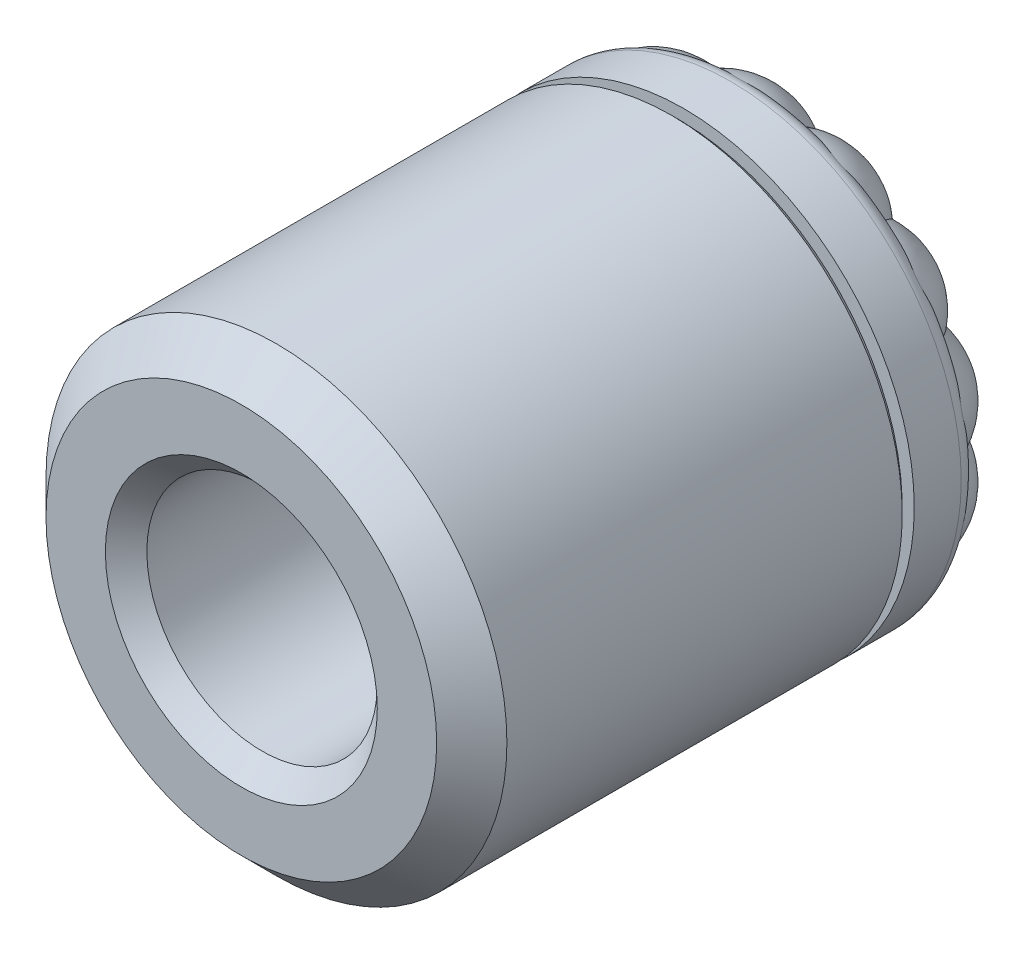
ISO-10303-21;
HEADER;
FILE_DESCRIPTION(('STEP AP214'),'2;1');
FILE_NAME('part.step','',(''),(''),'','','');
FILE_SCHEMA(('AUTOMOTIVE_DESIGN { 1 0 10303 214 1 1 1 1 }'));
ENDSEC;
DATA;
#1=APPLICATION_CONTEXT('core data for automotive mechanical design processes');
#2=APPLICATION_PROTOCOL_DEFINITION('international standard','automotive_design',2000,#1);
#3=PRODUCT_CONTEXT('',#1,'mechanical');
#4=PRODUCT('Part','Part','',(#3));
#5=PRODUCT_RELATED_PRODUCT_CATEGORY('part','',(#4));
#6=PRODUCT_DEFINITION_FORMATION('','',#4);
#7=PRODUCT_DEFINITION_CONTEXT('part definition',#1,'design');
#8=PRODUCT_DEFINITION('design','',#6,#7);
#9=PRODUCT_DEFINITION_SHAPE('','',#8);
#10=(LENGTH_UNIT() NAMED_UNIT(*) SI_UNIT(.MILLI.,.METRE.));
#11=(NAMED_UNIT(*) PLANE_ANGLE_UNIT() SI_UNIT($,.RADIAN.));
#12=(NAMED_UNIT(*) SI_UNIT($,.STERADIAN.) SOLID_ANGLE_UNIT());
#13=UNCERTAINTY_MEASURE_WITH_UNIT(LENGTH_MEASURE(1.E-05),#10,'distance_accuracy_value','');
#14=(GEOMETRIC_REPRESENTATION_CONTEXT(3) GLOBAL_UNCERTAINTY_ASSIGNED_CONTEXT((#13)) GLOBAL_UNIT_ASSIGNED_CONTEXT((#10,
#11,#12)) REPRESENTATION_CONTEXT('',''));
#15=CARTESIAN_POINT('',(0.,0.,0.));
#16=DIRECTION('',(0.,0.,1.));
#17=DIRECTION('',(1.,0.,0.));
#18=AXIS2_PLACEMENT_3D('',#15,#16,#17);
#19=CARTESIAN_POINT('',(0.,0.,12.));
#20=DIRECTION('',(0.,0.,-1.));
#21=DIRECTION('',(-1.,0.,0.));
#22=AXIS2_PLACEMENT_3D('',#19,#20,#21);
#23=PLANE('',#22);
#24=CARTESIAN_POINT('',(0.,0.,12.));
#25=DIRECTION('',(0.,0.,-1.));
#26=DIRECTION('',(-1.,0.,0.));
#27=AXIS2_PLACEMENT_3D('',#24,#25,#26);
#28=CIRCLE('',#27,2.95);
#29=CARTESIAN_POINT('',(-2.95,0.,12.));
#30=VERTEX_POINT('',#29);
#31=EDGE_CURVE('E22',#30,#30,#28,.T.);
#32=ORIENTED_EDGE('',*,*,#31,.T.);
#33=EDGE_LOOP('',(#32));
#34=FACE_BOUND('',#33,.T.);
#35=CARTESIAN_POINT('',(0.,0.,12.));
#36=DIRECTION('',(0.,0.,-1.));
#37=DIRECTION('',(-1.,0.,0.));
#38=AXIS2_PLACEMENT_3D('',#35,#36,#37);
#39=CIRCLE('',#38,4.238);
#40=CARTESIAN_POINT('',(-4.238,0.,12.));
#41=VERTEX_POINT('',#40);
#42=EDGE_CURVE('E1349',#41,#41,#39,.F.);
#43=ORIENTED_EDGE('',*,*,#42,.T.);
#44=EDGE_LOOP('',(#43));
#45=FACE_BOUND('',#44,.T.);
#46=ADVANCED_FACE('F14',(#34,#45),#23,.F.);
#47=CARTESIAN_POINT('',(0.,0.,2.));
#48=DIRECTION('',(0.,0.,1.));
#49=DIRECTION('',(1.,0.,0.));
#50=AXIS2_PLACEMENT_3D('',#47,#48,#49);
#51=CYLINDRICAL_SURFACE('',#50,5.);
#52=CARTESIAN_POINT('',(0.,0.,2.6604));
#53=DIRECTION('',(0.,0.,-1.));
#54=DIRECTION('',(-1.,0.,0.));
#55=AXIS2_PLACEMENT_3D('',#52,#53,#54);
#56=CIRCLE('',#55,5.);
#57=CARTESIAN_POINT('',(-5.,0.,2.6604));
#58=VERTEX_POINT('',#57);
#59=EDGE_CURVE('E1335',#58,#58,#56,.F.);
#60=ORIENTED_EDGE('',*,*,#59,.T.);
#61=EDGE_LOOP('',(#60));
#62=FACE_BOUND('',#61,.T.);
#63=CARTESIAN_POINT('',(0.,0.,11.238));
#64=DIRECTION('',(0.,0.,-1.));
#65=DIRECTION('',(-1.,0.,0.));
#66=AXIS2_PLACEMENT_3D('',#63,#64,#65);
#67=CIRCLE('',#66,5.);
#68=CARTESIAN_POINT('',(-5.,0.,11.238));
#69=VERTEX_POINT('',#68);
#70=EDGE_CURVE('E1352',#69,#69,#67,.T.);
#71=ORIENTED_EDGE('',*,*,#70,.T.);
#72=EDGE_LOOP('',(#71));
#73=FACE_BOUND('',#72,.T.);
#74=ADVANCED_FACE('F1360',(#62,#73),#51,.T.);
#75=CARTESIAN_POINT('',(0.,0.,11.238));
#76=DIRECTION('',(0.,0.,-1.));
#77=DIRECTION('',(-1.,0.,0.));
#78=AXIS2_PLACEMENT_3D('',#75,#76,#77);
#79=CONICAL_SURFACE('',#78,5.,0.78539816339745);
#80=ORIENTED_EDGE('',*,*,#42,.F.);
#81=EDGE_LOOP('',(#80));
#82=FACE_BOUND('',#81,.T.);
#83=ORIENTED_EDGE('',*,*,#70,.F.);
#84=EDGE_LOOP('',(#83));
#85=FACE_BOUND('',#84,.T.);
#86=ADVANCED_FACE('F1362',(#82,#85),#79,.T.);
#87=CARTESIAN_POINT('',(0.,0.,2.5334));
#88=DIRECTION('',(0.,0.,-1.));
#89=DIRECTION('',(-1.,0.,0.));
#90=AXIS2_PLACEMENT_3D('',#87,#88,#89);
#91=PLANE('',#90);
#92=CARTESIAN_POINT('',(0.,0.,2.5334));
#93=DIRECTION('',(0.,0.,-1.));
#94=DIRECTION('',(-1.,0.,0.));
#95=AXIS2_PLACEMENT_3D('',#92,#93,#94);
#96=CIRCLE('',#95,4.873);
#97=CARTESIAN_POINT('',(-4.873,0.,2.5334));
#98=VERTEX_POINT('',#97);
#99=EDGE_CURVE('E1340',#98,#98,#96,.T.);
#100=ORIENTED_EDGE('',*,*,#99,.T.);
#101=EDGE_LOOP('',(#100));
#102=FACE_BOUND('',#101,.T.);
#103=CARTESIAN_POINT('',(0.,0.,2.5334));
#104=DIRECTION('',(0.,0.,-1.));
#105=DIRECTION('',(-1.,0.,0.));
#106=AXIS2_PLACEMENT_3D('',#103,#104,#105);
#107=CIRCLE('',#106,4.127);
#108=CARTESIAN_POINT('',(-4.127,0.,2.5334));
#109=VERTEX_POINT('',#108);
#110=EDGE_CURVE('E1329',#109,#109,#107,.F.);
#111=ORIENTED_EDGE('',*,*,#110,.T.);
#112=EDGE_LOOP('',(#111));
#113=FACE_BOUND('',#112,.T.);
#114=ADVANCED_FACE('F1364',(#102,#113),#91,.T.);
#115=CARTESIAN_POINT('',(0.,0.,2.5334));
#116=DIRECTION('',(0.,0.,-1.));
#117=DIRECTION('',(-1.,0.,0.));
#118=AXIS2_PLACEMENT_3D('',#115,#116,#117);
#119=CYLINDRICAL_SURFACE('',#118,4.);
#120=CARTESIAN_POINT('',(0.,0.,2.4064));
#121=DIRECTION('',(0.,0.,-1.));
#122=DIRECTION('',(-1.,0.,0.));
#123=AXIS2_PLACEMENT_3D('',#120,#121,#122);
#124=CIRCLE('',#123,4.);
#125=CARTESIAN_POINT('',(-4.,0.,2.4064));
#126=VERTEX_POINT('',#125);
#127=EDGE_CURVE('E1331',#126,#126,#124,.T.);
#128=ORIENTED_EDGE('',*,*,#127,.T.);
#129=EDGE_LOOP('',(#128));
#130=FACE_BOUND('',#129,.T.);
#131=CARTESIAN_POINT('',(0.,0.,2.254));
#132=DIRECTION('',(0.,0.,-1.));
#133=DIRECTION('',(-1.,0.,0.));
#134=AXIS2_PLACEMENT_3D('',#131,#132,#133);
#135=CIRCLE('',#134,4.);
#136=CARTESIAN_POINT('',(-4.,0.,2.254));
#137=VERTEX_POINT('',#136);
#138=EDGE_CURVE('E1343',#137,#137,#135,.F.);
#139=ORIENTED_EDGE('',*,*,#138,.T.);
#140=EDGE_LOOP('',(#139));
#141=FACE_BOUND('',#140,.T.);
#142=ADVANCED_FACE('F1371',(#130,#141),#119,.T.);
#143=CARTESIAN_POINT('',(0.,0.,2.));
#144=DIRECTION('',(0.,0.,1.));
#145=DIRECTION('',(1.,0.,0.));
#146=AXIS2_PLACEMENT_3D('',#143,#144,#145);
#147=CONICAL_SURFACE('',#146,3.746,0.785398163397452);
#148=ORIENTED_EDGE('',*,*,#138,.F.);
#149=EDGE_LOOP('',(#148));
#150=FACE_BOUND('',#149,.T.);
#151=CARTESIAN_POINT('',(0.,0.,2.));
#152=DIRECTION('',(0.,0.,-1.));
#153=DIRECTION('',(-1.,0.,0.));
#154=AXIS2_PLACEMENT_3D('',#151,#152,#153);
#155=CIRCLE('',#154,3.746);
#156=CARTESIAN_POINT('',(-3.746,0.,2.));
#157=VERTEX_POINT('',#156);
#158=EDGE_CURVE('E1346',#157,#157,#155,.T.);
#159=ORIENTED_EDGE('',*,*,#158,.F.);
#160=EDGE_LOOP('',(#159));
#161=FACE_BOUND('',#160,.T.);
#162=ADVANCED_FACE('F1379',(#150,#161),#147,.T.);
#163=CARTESIAN_POINT('',(0.,0.,2.5334));
#164=DIRECTION('',(0.,0.,1.));
#165=DIRECTION('',(1.,0.,0.));
#166=AXIS2_PLACEMENT_3D('',#163,#164,#165);
#167=CONICAL_SURFACE('',#166,4.873,0.785398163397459);
#168=ORIENTED_EDGE('',*,*,#59,.F.);
#169=EDGE_LOOP('',(#168));
#170=FACE_BOUND('',#169,.T.);
#171=ORIENTED_EDGE('',*,*,#99,.F.);
#172=EDGE_LOOP('',(#171));
#173=FACE_BOUND('',#172,.T.);
#174=ADVANCED_FACE('F1382',(#170,#173),#167,.T.);
#175=CARTESIAN_POINT('',(0.,0.,2.4064));
#176=DIRECTION('',(0.,0.,-1.));
#177=DIRECTION('',(-1.,0.,0.));
#178=AXIS2_PLACEMENT_3D('',#175,#176,#177);
#179=TOROIDAL_SURFACE('',#178,4.127,0.127);
#180=ORIENTED_EDGE('',*,*,#110,.F.);
#181=EDGE_LOOP('',(#180));
#182=FACE_BOUND('',#181,.T.);
#183=ORIENTED_EDGE('',*,*,#127,.F.);
#184=EDGE_LOOP('',(#183));
#185=FACE_BOUND('',#184,.T.);
#186=ADVANCED_FACE('F875',(#182,#185),#179,.F.);
#187=CARTESIAN_POINT('',(0.,4.619,1.));
#188=DIRECTION('',(0.,0.,1.));
#189=DIRECTION('',(1.,0.,0.));
#190=AXIS2_PLACEMENT_3D('',#187,#188,#189);
#191=PLANE('',#190);
#192=CARTESIAN_POINT('',(3.32694150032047,0.759352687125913,1.));
#193=DIRECTION('',(0.,0.,1.));
#194=DIRECTION('',(0.222520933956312,-0.974927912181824,0.));
#195=AXIS2_PLACEMENT_3D('',#192,#193,#194);
#196=CIRCLE('',#195,1.47478812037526);
#197=CARTESIAN_POINT('',(1.87734531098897,0.487928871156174,1.));
#198=VERTEX_POINT('',#197);
#199=CARTESIAN_POINT('',(1.85840107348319,0.894958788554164,1.));
#200=VERTEX_POINT('',#199);
#201=EDGE_CURVE('E698',#198,#200,#196,.F.);
#202=ORIENTED_EDGE('',*,*,#201,.F.);
#203=CARTESIAN_POINT('',(0.,0.,1.));
#204=DIRECTION('',(0.,0.,1.));
#205=DIRECTION('',(1.,0.,0.));
#206=AXIS2_PLACEMENT_3D('',#203,#204,#205);
#207=CIRCLE('',#206,1.93971647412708);
#208=CARTESIAN_POINT('',(1.55198380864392,1.16354899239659,1.));
#209=VERTEX_POINT('',#208);
#210=EDGE_CURVE('E1048',#198,#209,#207,.T.);
#211=ORIENTED_EDGE('',*,*,#210,.T.);
#212=CARTESIAN_POINT('',(2.66799993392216,2.12765894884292,1.));
#213=DIRECTION('',(0.,0.,1.));
#214=DIRECTION('',(0.623489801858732,-0.781831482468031,0.));
#215=AXIS2_PLACEMENT_3D('',#212,#213,#214);
#216=CIRCLE('',#215,1.47478812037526);
#217=EDGE_CURVE('E709',#200,#209,#216,.F.);
#218=ORIENTED_EDGE('',*,*,#217,.F.);
#219=EDGE_LOOP('',(#202,#211,#218));
#220=FACE_BOUND('',#219,.T.);
#221=ADVANCED_FACE('F868',(#220),#191,.F.);
#222=CARTESIAN_POINT('',(3.32694150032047,-0.759352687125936,1.));
#223=DIRECTION('',(0.,0.,1.));
#224=DIRECTION('',(-0.222520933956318,-0.974927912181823,0.));
#225=AXIS2_PLACEMENT_3D('',#222,#223,#224);
#226=CIRCLE('',#225,1.47478812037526);
#227=CARTESIAN_POINT('',(1.90313408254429,-0.374940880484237,1.));
#228=VERTEX_POINT('',#227);
#229=CARTESIAN_POINT('',(2.06266957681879,0.,1.));
#230=VERTEX_POINT('',#229);
#231=EDGE_CURVE('E657',#228,#230,#226,.F.);
#232=ORIENTED_EDGE('',*,*,#231,.F.);
#233=CARTESIAN_POINT('',(1.9031340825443,0.374940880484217,1.));
#234=VERTEX_POINT('',#233);
#235=EDGE_CURVE('E1044',#228,#234,#207,.T.);
#236=ORIENTED_EDGE('',*,*,#235,.T.);
#237=EDGE_CURVE('E668',#230,#234,#196,.F.);
#238=ORIENTED_EDGE('',*,*,#237,.F.);
#239=EDGE_LOOP('',(#232,#236,#238));
#240=FACE_BOUND('',#239,.T.);
#241=ADVANCED_FACE('F874',(#240),#191,.F.);
#242=CARTESIAN_POINT('',(2.66799993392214,-2.12765894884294,1.));
#243=DIRECTION('',(0.,0.,1.));
#244=DIRECTION('',(-0.623489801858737,-0.781831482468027,0.));
#245=AXIS2_PLACEMENT_3D('',#242,#243,#244);
#246=CIRCLE('',#245,1.47478812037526);
#247=CARTESIAN_POINT('',(1.55198380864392,-1.16354899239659,1.));
#248=VERTEX_POINT('',#247);
#249=CARTESIAN_POINT('',(1.85840107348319,-0.894958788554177,1.));
#250=VERTEX_POINT('',#249);
#251=EDGE_CURVE('E616',#248,#250,#246,.F.);
#252=ORIENTED_EDGE('',*,*,#251,.F.);
#253=CARTESIAN_POINT('',(1.87734531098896,-0.487928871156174,1.));
#254=VERTEX_POINT('',#253);
#255=EDGE_CURVE('E893',#248,#254,#207,.T.);
#256=ORIENTED_EDGE('',*,*,#255,.T.);
#257=EDGE_CURVE('E627',#250,#254,#226,.F.);
#258=ORIENTED_EDGE('',*,*,#257,.F.);
#259=EDGE_LOOP('',(#252,#256,#258));
#260=FACE_BOUND('',#259,.T.);
#261=ADVANCED_FACE('F869',(#260),#191,.F.);
#262=CARTESIAN_POINT('',(1.48062825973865,-3.07455626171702,1.));
#263=DIRECTION('',(0.,0.,1.));
#264=DIRECTION('',(-0.900968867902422,-0.433883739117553,0.));
#265=AXIS2_PLACEMENT_3D('',#262,#263,#264);
#266=CIRCLE('',#265,1.47478812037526);
#267=CARTESIAN_POINT('',(0.893444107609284,-1.7217019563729,1.));
#268=VERTEX_POINT('',#267);
#269=CARTESIAN_POINT('',(1.28605344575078,-1.61266001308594,1.));
#270=VERTEX_POINT('',#269);
#271=EDGE_CURVE('E575',#268,#270,#266,.F.);
#272=ORIENTED_EDGE('',*,*,#271,.F.);
#273=CARTESIAN_POINT('',(1.47972527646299,-1.2541583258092,1.));
#274=VERTEX_POINT('',#273);
#275=EDGE_CURVE('E1035',#268,#274,#207,.T.);
#276=ORIENTED_EDGE('',*,*,#275,.T.);
#277=EDGE_CURVE('E586',#270,#274,#246,.F.);
#278=ORIENTED_EDGE('',*,*,#277,.F.);
#279=EDGE_LOOP('',(#272,#276,#278));
#280=FACE_BOUND('',#279,.T.);
#281=ADVANCED_FACE('F882',(#280),#191,.F.);
#282=CARTESIAN_POINT('',(0.,-3.4125,1.));
#283=DIRECTION('',(0.,0.,1.));
#284=DIRECTION('',(-1.,0.,0.));
#285=AXIS2_PLACEMENT_3D('',#282,#283,#284);
#286=CIRCLE('',#285,1.47478812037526);
#287=CARTESIAN_POINT('',(0.0579468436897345,-1.93885073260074,1.));
#288=VERTEX_POINT('',#287);
#289=CARTESIAN_POINT('',(0.458987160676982,-2.01095414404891,1.));
#290=VERTEX_POINT('',#289);
#291=EDGE_CURVE('E534',#288,#290,#286,.F.);
#292=ORIENTED_EDGE('',*,*,#291,.F.);
#293=CARTESIAN_POINT('',(0.789027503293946,-1.77198634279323,1.));
#294=VERTEX_POINT('',#293);
#295=EDGE_CURVE('E1030',#288,#294,#207,.T.);
#296=ORIENTED_EDGE('',*,*,#295,.T.);
#297=EDGE_CURVE('E545',#290,#294,#266,.F.);
#298=ORIENTED_EDGE('',*,*,#297,.F.);
#299=EDGE_LOOP('',(#292,#296,#298));
#300=FACE_BOUND('',#299,.T.);
#301=ADVANCED_FACE('F888',(#300),#191,.F.);
#302=CARTESIAN_POINT('',(-1.48062825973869,-3.074556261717,1.));
#303=DIRECTION('',(0.,0.,1.));
#304=DIRECTION('',(-0.900968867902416,0.433883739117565,0.));
#305=AXIS2_PLACEMENT_3D('',#302,#303,#304);
#306=CIRCLE('',#305,1.47478812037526);
#307=CARTESIAN_POINT('',(-0.789027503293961,-1.77198634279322,1.));
#308=VERTEX_POINT('',#307);
#309=CARTESIAN_POINT('',(-0.458987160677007,-2.0109541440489,1.));
#310=VERTEX_POINT('',#309);
#311=EDGE_CURVE('E493',#308,#310,#306,.F.);
#312=ORIENTED_EDGE('',*,*,#311,.F.);
#313=CARTESIAN_POINT('',(-0.0579468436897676,-1.93885073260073,1.));
#314=VERTEX_POINT('',#313);
#315=EDGE_CURVE('E1025',#308,#314,#207,.T.);
#316=ORIENTED_EDGE('',*,*,#315,.T.);
#317=EDGE_CURVE('E504',#310,#314,#286,.F.);
#318=ORIENTED_EDGE('',*,*,#317,.F.);
#319=EDGE_LOOP('',(#312,#316,#318));
#320=FACE_BOUND('',#319,.T.);
#321=ADVANCED_FACE('F1056',(#320),#191,.F.);
#322=CARTESIAN_POINT('',(-2.66799993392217,-2.1276589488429,1.));
#323=DIRECTION('',(0.,0.,1.));
#324=DIRECTION('',(-0.623489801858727,0.781831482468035,0.));
#325=AXIS2_PLACEMENT_3D('',#322,#323,#324);
#326=CIRCLE('',#325,1.47478812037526);
#327=CARTESIAN_POINT('',(-1.479725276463,-1.25415832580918,1.));
#328=VERTEX_POINT('',#327);
#329=CARTESIAN_POINT('',(-1.2860534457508,-1.61266001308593,1.));
#330=VERTEX_POINT('',#329);
#331=EDGE_CURVE('E452',#328,#330,#326,.F.);
#332=ORIENTED_EDGE('',*,*,#331,.F.);
#333=CARTESIAN_POINT('',(-0.893444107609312,-1.72170195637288,1.));
#334=VERTEX_POINT('',#333);
#335=EDGE_CURVE('E985',#328,#334,#207,.T.);
#336=ORIENTED_EDGE('',*,*,#335,.T.);
#337=EDGE_CURVE('E463',#330,#334,#306,.F.);
#338=ORIENTED_EDGE('',*,*,#337,.F.);
#339=EDGE_LOOP('',(#332,#336,#338));
#340=FACE_BOUND('',#339,.T.);
#341=ADVANCED_FACE('F1449',(#340),#191,.F.);
#342=CARTESIAN_POINT('',(-3.32694150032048,-0.759352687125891,1.));
#343=DIRECTION('',(0.,0.,1.));
#344=DIRECTION('',(-0.222520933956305,0.974927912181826,0.));
#345=AXIS2_PLACEMENT_3D('',#342,#343,#344);
#346=CIRCLE('',#345,1.47478812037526);
#347=CARTESIAN_POINT('',(-1.87734531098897,-0.48792887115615,1.));
#348=VERTEX_POINT('',#347);
#349=CARTESIAN_POINT('',(-1.8584010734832,-0.894958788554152,1.));
#350=VERTEX_POINT('',#349);
#351=EDGE_CURVE('E411',#348,#350,#346,.F.);
#352=ORIENTED_EDGE('',*,*,#351,.F.);
#353=CARTESIAN_POINT('',(-1.55198380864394,-1.16354899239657,1.));
#354=VERTEX_POINT('',#353);
#355=EDGE_CURVE('E1017',#348,#354,#207,.T.);
#356=ORIENTED_EDGE('',*,*,#355,.T.);
#357=EDGE_CURVE('E422',#350,#354,#326,.F.);
#358=ORIENTED_EDGE('',*,*,#357,.F.);
#359=EDGE_LOOP('',(#352,#356,#358));
#360=FACE_BOUND('',#359,.T.);
#361=ADVANCED_FACE('F1445',(#360),#191,.F.);
#362=CARTESIAN_POINT('',(-3.32694150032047,0.759352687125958,1.));
#363=DIRECTION('',(0.,0.,1.));
#364=DIRECTION('',(0.222520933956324,0.974927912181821,0.));
#365=AXIS2_PLACEMENT_3D('',#362,#363,#364);
#366=CIRCLE('',#365,1.47478812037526);
#367=CARTESIAN_POINT('',(-1.90313408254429,0.374940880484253,1.));
#368=VERTEX_POINT('',#367);
#369=CARTESIAN_POINT('',(-2.06266957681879,0.,1.));
#370=VERTEX_POINT('',#369);
#371=EDGE_CURVE('E368',#368,#370,#366,.F.);
#372=ORIENTED_EDGE('',*,*,#371,.F.);
#373=CARTESIAN_POINT('',(-1.9031340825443,-0.374940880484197,1.));
#374=VERTEX_POINT('',#373);
#375=EDGE_CURVE('E1012',#368,#374,#207,.T.);
#376=ORIENTED_EDGE('',*,*,#375,.T.);
#377=EDGE_CURVE('E379',#370,#374,#346,.F.);
#378=ORIENTED_EDGE('',*,*,#377,.F.);
#379=EDGE_LOOP('',(#372,#376,#378));
#380=FACE_BOUND('',#379,.T.);
#381=ADVANCED_FACE('F1433',(#380),#191,.F.);
#382=CARTESIAN_POINT('',(-2.66799993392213,2.12765894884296,1.));
#383=DIRECTION('',(0.,0.,1.));
#384=DIRECTION('',(0.623489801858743,0.781831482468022,0.));
#385=AXIS2_PLACEMENT_3D('',#382,#383,#384);
#386=CIRCLE('',#385,1.47478812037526);
#387=CARTESIAN_POINT('',(-1.5519838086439,1.16354899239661,1.));
#388=VERTEX_POINT('',#387);
#389=CARTESIAN_POINT('',(-1.85840107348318,0.89495878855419,1.));
#390=VERTEX_POINT('',#389);
#391=EDGE_CURVE('E309',#388,#390,#386,.F.);
#392=ORIENTED_EDGE('',*,*,#391,.F.);
#393=CARTESIAN_POINT('',(-1.87734531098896,0.487928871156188,1.));
#394=VERTEX_POINT('',#393);
#395=EDGE_CURVE('E29',#388,#394,#207,.T.);
#396=ORIENTED_EDGE('',*,*,#395,.T.);
#397=EDGE_CURVE('E360',#390,#394,#366,.F.);
#398=ORIENTED_EDGE('',*,*,#397,.F.);
#399=EDGE_LOOP('',(#392,#396,#398));
#400=FACE_BOUND('',#399,.T.);
#401=ADVANCED_FACE('F1439',(#400),#191,.F.);
#402=CARTESIAN_POINT('',(-1.48062825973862,3.07455626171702,1.));
#403=DIRECTION('',(0.,0.,1.));
#404=DIRECTION('',(0.900968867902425,0.433883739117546,0.));
#405=AXIS2_PLACEMENT_3D('',#402,#403,#404);
#406=CIRCLE('',#405,1.47478812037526);
#407=CARTESIAN_POINT('',(-0.893444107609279,1.7217019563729,1.));
#408=VERTEX_POINT('',#407);
#409=CARTESIAN_POINT('',(-1.28605344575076,1.61266001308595,1.));
#410=VERTEX_POINT('',#409);
#411=EDGE_CURVE('E301',#408,#410,#406,.F.);
#412=ORIENTED_EDGE('',*,*,#411,.F.);
#413=CARTESIAN_POINT('',(-1.47972527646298,1.25415832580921,1.));
#414=VERTEX_POINT('',#413);
#415=EDGE_CURVE('E285',#408,#414,#207,.T.);
#416=ORIENTED_EDGE('',*,*,#415,.T.);
#417=EDGE_CURVE('E299',#410,#414,#386,.F.);
#418=ORIENTED_EDGE('',*,*,#417,.F.);
#419=EDGE_LOOP('',(#412,#416,#418));
#420=FACE_BOUND('',#419,.T.);
#421=ADVANCED_FACE('F298',(#420),#191,.F.);
#422=CARTESIAN_POINT('',(0.,3.4125,1.));
#423=DIRECTION('',(0.,0.,1.));
#424=DIRECTION('',(1.,0.,0.));
#425=AXIS2_PLACEMENT_3D('',#422,#423,#424);
#426=CIRCLE('',#425,1.47478812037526);
#427=CARTESIAN_POINT('',(-0.057946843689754,1.93885073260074,1.));
#428=VERTEX_POINT('',#427);
#429=CARTESIAN_POINT('',(-0.458987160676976,2.0109541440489,1.));
#430=VERTEX_POINT('',#429);
#431=EDGE_CURVE('E979',#428,#430,#426,.F.);
#432=ORIENTED_EDGE('',*,*,#431,.F.);
#433=CARTESIAN_POINT('',(-0.789027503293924,1.77198634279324,1.));
#434=VERTEX_POINT('',#433);
#435=EDGE_CURVE('E999',#428,#434,#207,.T.);
#436=ORIENTED_EDGE('',*,*,#435,.T.);
#437=EDGE_CURVE('E748',#430,#434,#406,.F.);
#438=ORIENTED_EDGE('',*,*,#437,.F.);
#439=EDGE_LOOP('',(#432,#436,#438));
#440=FACE_BOUND('',#439,.T.);
#441=ADVANCED_FACE('F1414',(#440),#191,.F.);
#442=CARTESIAN_POINT('',(1.48062825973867,3.074556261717,1.));
#443=DIRECTION('',(0.,0.,1.));
#444=DIRECTION('',(0.900968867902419,-0.433883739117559,0.));
#445=AXIS2_PLACEMENT_3D('',#442,#443,#444);
#446=CIRCLE('',#445,1.47478812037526);
#447=CARTESIAN_POINT('',(0.789027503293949,1.77198634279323,1.));
#448=VERTEX_POINT('',#447);
#449=CARTESIAN_POINT('',(0.458987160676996,2.01095414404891,1.));
#450=VERTEX_POINT('',#449);
#451=EDGE_CURVE('E822',#448,#450,#446,.F.);
#452=ORIENTED_EDGE('',*,*,#451,.F.);
#453=CARTESIAN_POINT('',(0.0579468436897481,1.93885073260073,1.));
#454=VERTEX_POINT('',#453);
#455=EDGE_CURVE('E1004',#448,#454,#207,.T.);
#456=ORIENTED_EDGE('',*,*,#455,.T.);
#457=EDGE_CURVE('E833',#450,#454,#426,.F.);
#458=ORIENTED_EDGE('',*,*,#457,.F.);
#459=EDGE_LOOP('',(#452,#456,#458));
#460=FACE_BOUND('',#459,.T.);
#461=ADVANCED_FACE('F1409',(#460),#191,.F.);
#462=CARTESIAN_POINT('',(0.,0.,2.38125));
#463=DIRECTION('',(0.,0.,1.));
#464=DIRECTION('',(0.,1.,0.));
#465=AXIS2_PLACEMENT_3D('',#462,#463,#464);
#466=SPHERICAL_SURFACE('',#465,2.38125);
#467=CARTESIAN_POINT('',(1.47972527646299,-1.2541583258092,1.));
#468=CARTESIAN_POINT('',(1.4826806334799,-1.25033976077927,0.99969998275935));
#469=CARTESIAN_POINT('',(1.48564443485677,-1.24652479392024,0.999437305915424));
#470=CARTESIAN_POINT('',(1.49158508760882,-1.23890685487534,0.998987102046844));
#471=CARTESIAN_POINT('',(1.49456192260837,-1.23510387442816,0.998799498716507));
#472=CARTESIAN_POINT('',(1.50052879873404,-1.22750950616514,0.998499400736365));
#473=CARTESIAN_POINT('',(1.50351882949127,-1.22371811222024,0.998386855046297));
#474=CARTESIAN_POINT('',(1.50951229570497,-1.21614654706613,0.998236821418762));
#475=CARTESIAN_POINT('',(1.512515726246,-1.21236637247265,0.998199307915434));
#476=CARTESIAN_POINT('',(1.51853622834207,-1.20481690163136,0.998199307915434));
#477=CARTESIAN_POINT('',(1.52155329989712,-1.20104760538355,0.998236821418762));
#478=CARTESIAN_POINT('',(1.52760135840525,-1.19351957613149,0.998386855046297));
#479=CARTESIAN_POINT('',(1.53063234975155,-1.18976084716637,0.998499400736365));
#480=CARTESIAN_POINT('',(1.53670855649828,-1.18225366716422,0.998799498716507));
#481=CARTESIAN_POINT('',(1.53975378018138,-1.17850522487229,0.998987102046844));
#482=CARTESIAN_POINT('',(1.54585880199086,-1.17101836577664,0.999437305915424));
#483=CARTESIAN_POINT('',(1.54891861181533,-1.16727996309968,0.99969998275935));
#484=CARTESIAN_POINT('',(1.55198380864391,-1.1635489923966,1.));
#485=B_SPLINE_CURVE_WITH_KNOTS('',3,(#467,#468,#469,#470,#471,#472,#473,#474,#475,#476,#477,
#478,#479,#480,#481,#482,#483,#484),.UNSPECIFIED.,.F.,.F.,(4,2,2,2,2,2,2,2,4),(0.,
0.0145136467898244,0.0290125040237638,0.043501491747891,0.057985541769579,0.0724695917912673,
0.0869585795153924,0.101457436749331,0.115971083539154),.UNSPECIFIED.);
#486=EDGE_CURVE('E581',#274,#248,#485,.T.);
#487=ORIENTED_EDGE('',*,*,#486,.F.);
#488=ORIENTED_EDGE('',*,*,#275,.F.);
#489=CARTESIAN_POINT('',(0.789027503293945,-1.77198634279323,1.));
#490=CARTESIAN_POINT('',(0.793347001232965,-1.76982821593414,0.999699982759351));
#491=CARTESIAN_POINT('',(0.797672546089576,-1.76767699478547,0.999437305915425));
#492=CARTESIAN_POINT('',(0.806330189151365,-1.76339102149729,0.998987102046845));
#493=CARTESIAN_POINT('',(0.810662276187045,-1.76125625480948,0.998799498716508));
#494=CARTESIAN_POINT('',(0.819333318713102,-1.75700289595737,0.998499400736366));
#495=CARTESIAN_POINT('',(0.823672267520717,-1.75488429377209,0.998386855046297));
#496=CARTESIAN_POINT('',(0.832357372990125,-1.75066301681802,0.998236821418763));
#497=CARTESIAN_POINT('',(0.836703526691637,-1.74856033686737,0.998199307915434));
#498=CARTESIAN_POINT('',(0.84540340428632,-1.74437069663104,0.998199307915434));
#499=CARTESIAN_POINT('',(0.849757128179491,-1.74228373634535,0.998236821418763));
#500=CARTESIAN_POINT('',(0.858472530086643,-1.7381253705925,0.998386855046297));
#501=CARTESIAN_POINT('',(0.862834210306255,-1.73605397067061,0.998499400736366));
#502=CARTESIAN_POINT('',(0.871565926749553,-1.73192660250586,0.998799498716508));
#503=CARTESIAN_POINT('',(0.875935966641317,-1.72987064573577,0.998987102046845));
#504=CARTESIAN_POINT('',(0.884684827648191,-1.7257740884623,0.999437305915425));
#505=CARTESIAN_POINT('',(0.889063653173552,-1.72373350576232,0.999699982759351));
#506=CARTESIAN_POINT('',(0.893444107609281,-1.7217019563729,1.));
#507=B_SPLINE_CURVE_WITH_KNOTS('',3,(#489,#490,#491,#492,#493,#494,#495,#496,#497,#498,#499,
#500,#501,#502,#503,#504,#505,#506),.UNSPECIFIED.,.F.,.F.,(4,2,2,2,2,2,2,2,4),(0.,
0.0145136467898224,0.0290125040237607,0.0435014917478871,0.0579855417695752,0.0724695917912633,
0.0869585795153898,0.101457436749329,0.115971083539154),.UNSPECIFIED.);
#508=EDGE_CURVE('E540',#294,#268,#507,.T.);
#509=ORIENTED_EDGE('',*,*,#508,.F.);
#510=ORIENTED_EDGE('',*,*,#295,.F.);
#511=CARTESIAN_POINT('',(-0.0579468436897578,-1.93885073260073,1.));
#512=CARTESIAN_POINT('',(-0.0531187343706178,-1.9387804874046,0.999699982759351));
#513=CARTESIAN_POINT('',(-0.0482881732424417,-1.93871908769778,0.999437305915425));
#514=CARTESIAN_POINT('',(-0.0386282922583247,-1.93861396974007,0.998987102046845));
#515=CARTESIAN_POINT('',(-0.0337989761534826,-1.93857023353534,0.998799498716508));
#516=CARTESIAN_POINT('',(-0.0241411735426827,-1.93850031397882,0.998499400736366));
#517=CARTESIAN_POINT('',(-0.0193126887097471,-1.9384741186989,0.998386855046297));
#518=CARTESIAN_POINT('',(-0.009656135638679,-1.93843920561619,0.998236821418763));
#519=CARTESIAN_POINT('',(-0.00482806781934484,-1.93843048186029,0.998199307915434));
#520=CARTESIAN_POINT('',(0.00482806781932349,-1.93843048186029,0.998199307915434));
#521=CARTESIAN_POINT('',(0.00965613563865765,-1.93843920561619,0.998236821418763));
#522=CARTESIAN_POINT('',(0.0193126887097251,-1.9384741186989,0.998386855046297));
#523=CARTESIAN_POINT('',(0.02414117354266,-1.93850031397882,0.998499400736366));
#524=CARTESIAN_POINT('',(0.033798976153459,-1.93857023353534,0.998799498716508));
#525=CARTESIAN_POINT('',(0.0386282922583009,-1.93861396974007,0.998987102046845));
#526=CARTESIAN_POINT('',(0.048288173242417,-1.93871908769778,0.999437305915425));
#527=CARTESIAN_POINT('',(0.0531187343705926,-1.9387804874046,0.999699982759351));
#528=CARTESIAN_POINT('',(0.0579468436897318,-1.93885073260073,1.));
#529=B_SPLINE_CURVE_WITH_KNOTS('',3,(#511,#512,#513,#514,#515,#516,#517,#518,#519,#520,#521,
#522,#523,#524,#525,#526,#527,#528),.UNSPECIFIED.,.F.,.F.,(4,2,2,2,2,2,2,2,4),(0.,
0.0145136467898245,0.029012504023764,0.0435014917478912,0.0579855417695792,0.0724695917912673,
0.0869585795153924,0.101457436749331,0.115971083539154),.UNSPECIFIED.);
#530=EDGE_CURVE('E499',#314,#288,#529,.T.);
#531=ORIENTED_EDGE('',*,*,#530,.F.);
#532=ORIENTED_EDGE('',*,*,#315,.F.);
#533=CARTESIAN_POINT('',(-0.893444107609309,-1.72170195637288,1.));
#534=CARTESIAN_POINT('',(-0.889063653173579,-1.7237335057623,0.99969998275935));
#535=CARTESIAN_POINT('',(-0.884684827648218,-1.72577408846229,0.999437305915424));
#536=CARTESIAN_POINT('',(-0.875935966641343,-1.72987064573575,0.998987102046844));
#537=CARTESIAN_POINT('',(-0.871565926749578,-1.73192660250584,0.998799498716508));
#538=CARTESIAN_POINT('',(-0.862834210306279,-1.73605397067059,0.998499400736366));
#539=CARTESIAN_POINT('',(-0.858472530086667,-1.73812537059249,0.998386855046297));
#540=CARTESIAN_POINT('',(-0.849757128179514,-1.74228373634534,0.998236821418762));
#541=CARTESIAN_POINT('',(-0.845403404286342,-1.74437069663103,0.998199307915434));
#542=CARTESIAN_POINT('',(-0.836703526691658,-1.74856033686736,0.998199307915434));
#543=CARTESIAN_POINT('',(-0.832357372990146,-1.75066301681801,0.998236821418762));
#544=CARTESIAN_POINT('',(-0.823672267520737,-1.75488429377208,0.998386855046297));
#545=CARTESIAN_POINT('',(-0.819333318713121,-1.75700289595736,0.998499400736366));
#546=CARTESIAN_POINT('',(-0.810662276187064,-1.76125625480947,0.998799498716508));
#547=CARTESIAN_POINT('',(-0.806330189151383,-1.76339102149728,0.998987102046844));
#548=CARTESIAN_POINT('',(-0.797672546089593,-1.76767699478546,0.999437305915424));
#549=CARTESIAN_POINT('',(-0.793347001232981,-1.76982821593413,0.99969998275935));
#550=CARTESIAN_POINT('',(-0.789027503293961,-1.77198634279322,1.));
#551=B_SPLINE_CURVE_WITH_KNOTS('',3,(#533,#534,#535,#536,#537,#538,#539,#540,#541,#542,#543,
#544,#545,#546,#547,#548,#549,#550),.UNSPECIFIED.,.F.,.F.,(4,2,2,2,2,2,2,2,4),(0.,
0.0145136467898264,0.029012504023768,0.0435014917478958,0.0579855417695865,0.0724695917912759,
0.0869585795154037,0.101457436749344,0.115971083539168),.UNSPECIFIED.);
#552=EDGE_CURVE('E458',#334,#308,#551,.T.);
#553=ORIENTED_EDGE('',*,*,#552,.F.);
#554=ORIENTED_EDGE('',*,*,#335,.F.);
#555=CARTESIAN_POINT('',(-1.55198380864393,-1.16354899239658,1.));
#556=CARTESIAN_POINT('',(-1.54891861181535,-1.16727996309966,0.999699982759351));
#557=CARTESIAN_POINT('',(-1.54585880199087,-1.17101836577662,0.999437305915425));
#558=CARTESIAN_POINT('',(-1.53975378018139,-1.17850522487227,0.998987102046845));
#559=CARTESIAN_POINT('',(-1.53670855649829,-1.1822536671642,0.998799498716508));
#560=CARTESIAN_POINT('',(-1.53063234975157,-1.18976084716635,0.998499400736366));
#561=CARTESIAN_POINT('',(-1.52760135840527,-1.19351957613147,0.998386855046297));
#562=CARTESIAN_POINT('',(-1.52155329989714,-1.20104760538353,0.998236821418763));
#563=CARTESIAN_POINT('',(-1.51853622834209,-1.20481690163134,0.998199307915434));
#564=CARTESIAN_POINT('',(-1.51251572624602,-1.21236637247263,0.998199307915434));
#565=CARTESIAN_POINT('',(-1.50951229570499,-1.21614654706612,0.998236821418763));
#566=CARTESIAN_POINT('',(-1.50351882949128,-1.22371811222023,0.998386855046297));
#567=CARTESIAN_POINT('',(-1.50052879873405,-1.22750950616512,0.998499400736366));
#568=CARTESIAN_POINT('',(-1.49456192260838,-1.23510387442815,0.998799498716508));
#569=CARTESIAN_POINT('',(-1.49158508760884,-1.23890685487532,0.998987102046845));
#570=CARTESIAN_POINT('',(-1.48564443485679,-1.24652479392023,0.999437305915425));
#571=CARTESIAN_POINT('',(-1.48268063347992,-1.25033976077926,0.999699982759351));
#572=CARTESIAN_POINT('',(-1.47972527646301,-1.25415832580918,1.));
#573=B_SPLINE_CURVE_WITH_KNOTS('',3,(#555,#556,#557,#558,#559,#560,#561,#562,#563,#564,#565,
#566,#567,#568,#569,#570,#571,#572),.UNSPECIFIED.,.F.,.F.,(4,2,2,2,2,2,2,2,4),(0.,
0.0145136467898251,0.0290125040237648,0.0435014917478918,0.0579855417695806,0.0724695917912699,
0.0869585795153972,0.101457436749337,0.115971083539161),.UNSPECIFIED.);
#574=EDGE_CURVE('E417',#354,#328,#573,.T.);
#575=ORIENTED_EDGE('',*,*,#574,.F.);
#576=ORIENTED_EDGE('',*,*,#355,.F.);
#577=CARTESIAN_POINT('',(-1.9031340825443,-0.374940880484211,1.));
#578=CARTESIAN_POINT('',(-1.90199124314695,-0.379632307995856,0.99969998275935));
#579=CARTESIAN_POINT('',(-1.9008564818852,-0.38432809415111,0.999437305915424));
#580=CARTESIAN_POINT('',(-1.89860447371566,-0.393722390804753,0.998987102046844));
#581=CARTESIAN_POINT('',(-1.89748721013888,-0.398420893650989,0.998799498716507));
#582=CARTESIAN_POINT('',(-1.8952699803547,-0.407820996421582,0.998499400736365));
#583=CARTESIAN_POINT('',(-1.89417000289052,-0.412522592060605,0.998386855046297));
#584=CARTESIAN_POINT('',(-1.89198717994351,-0.421929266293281,0.998236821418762));
#585=CARTESIAN_POINT('',(-1.89090432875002,-0.426634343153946,0.998199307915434));
#586=CARTESIAN_POINT('',(-1.88875563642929,-0.436048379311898,0.998199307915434));
#587=CARTESIAN_POINT('',(-1.88768979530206,-0.440757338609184,0.998236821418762));
#588=CARTESIAN_POINT('',(-1.88557504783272,-0.450179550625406,0.998386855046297));
#589=CARTESIAN_POINT('',(-1.88452614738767,-0.454892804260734,0.998499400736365));
#590=CARTESIAN_POINT('',(-1.882445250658,-0.464324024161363,0.998799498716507));
#591=CARTESIAN_POINT('',(-1.88141326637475,-0.469041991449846,0.998987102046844));
#592=CARTESIAN_POINT('',(-1.8793662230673,-0.478483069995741,0.999437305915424));
#593=CARTESIAN_POINT('',(-1.8783511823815,-0.483206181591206,0.99969998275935));
#594=CARTESIAN_POINT('',(-1.87734531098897,-0.48792887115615,1.));
#595=B_SPLINE_CURVE_WITH_KNOTS('',3,(#577,#578,#579,#580,#581,#582,#583,#584,#585,#586,#587,
#588,#589,#590,#591,#592,#593,#594),.UNSPECIFIED.,.F.,.F.,(4,2,2,2,2,2,2,2,4),(0.,
0.0145136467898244,0.0290125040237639,0.0435014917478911,0.0579855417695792,0.0724695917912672,
0.0869585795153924,0.101457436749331,0.115971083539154),.UNSPECIFIED.);
#596=EDGE_CURVE('E374',#374,#348,#595,.T.);
#597=ORIENTED_EDGE('',*,*,#596,.F.);
#598=ORIENTED_EDGE('',*,*,#375,.F.);
#599=CARTESIAN_POINT('',(-1.87734531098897,0.487928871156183,1.));
#600=CARTESIAN_POINT('',(-1.87835118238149,0.483206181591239,0.999699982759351));
#601=CARTESIAN_POINT('',(-1.87936622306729,0.478483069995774,0.999437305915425));
#602=CARTESIAN_POINT('',(-1.88141326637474,0.469041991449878,0.998987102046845));
#603=CARTESIAN_POINT('',(-1.882445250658,0.464324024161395,0.998799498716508));
#604=CARTESIAN_POINT('',(-1.88452614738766,0.454892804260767,0.998499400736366));
#605=CARTESIAN_POINT('',(-1.88557504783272,0.450179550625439,0.998386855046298));
#606=CARTESIAN_POINT('',(-1.88768979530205,0.440757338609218,0.998236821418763));
#607=CARTESIAN_POINT('',(-1.88875563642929,0.436048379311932,0.998199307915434));
#608=CARTESIAN_POINT('',(-1.89090432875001,0.426634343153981,0.998199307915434));
#609=CARTESIAN_POINT('',(-1.8919871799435,0.421929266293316,0.998236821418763));
#610=CARTESIAN_POINT('',(-1.89417000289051,0.412522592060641,0.998386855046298));
#611=CARTESIAN_POINT('',(-1.89526998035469,0.407820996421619,0.998499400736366));
#612=CARTESIAN_POINT('',(-1.89748721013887,0.398420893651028,0.998799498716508));
#613=CARTESIAN_POINT('',(-1.89860447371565,0.393722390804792,0.998987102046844));
#614=CARTESIAN_POINT('',(-1.90085648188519,0.384328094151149,0.999437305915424));
#615=CARTESIAN_POINT('',(-1.90199124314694,0.379632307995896,0.99969998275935));
#616=CARTESIAN_POINT('',(-1.90313408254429,0.374940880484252,1.));
#617=B_SPLINE_CURVE_WITH_KNOTS('',3,(#599,#600,#601,#602,#603,#604,#605,#606,#607,#608,#609,
#610,#611,#612,#613,#614,#615,#616),.UNSPECIFIED.,.F.,.F.,(4,2,2,2,2,2,2,2,4),(0.,
0.0145136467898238,0.0290125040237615,0.0435014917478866,0.057985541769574,0.0724695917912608,
0.0869585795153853,0.101457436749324,0.115971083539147),.UNSPECIFIED.);
#618=EDGE_CURVE('E302',#394,#368,#617,.T.);
#619=ORIENTED_EDGE('',*,*,#618,.F.);
#620=ORIENTED_EDGE('',*,*,#395,.F.);
#621=CARTESIAN_POINT('',(-1.47972527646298,1.25415832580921,1.));
#622=CARTESIAN_POINT('',(-1.48268063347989,1.25033976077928,0.999699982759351));
#623=CARTESIAN_POINT('',(-1.48564443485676,1.24652479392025,0.999437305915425));
#624=CARTESIAN_POINT('',(-1.49158508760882,1.23890685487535,0.998987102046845));
#625=CARTESIAN_POINT('',(-1.49456192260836,1.23510387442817,0.998799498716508));
#626=CARTESIAN_POINT('',(-1.50052879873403,1.22750950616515,0.998499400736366));
#627=CARTESIAN_POINT('',(-1.50351882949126,1.22371811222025,0.998386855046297));
#628=CARTESIAN_POINT('',(-1.50951229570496,1.21614654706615,0.998236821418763));
#629=CARTESIAN_POINT('',(-1.51251572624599,1.21236637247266,0.998199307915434));
#630=CARTESIAN_POINT('',(-1.51853622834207,1.20481690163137,0.998199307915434));
#631=CARTESIAN_POINT('',(-1.52155329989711,1.20104760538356,0.998236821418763));
#632=CARTESIAN_POINT('',(-1.52760135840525,1.1935195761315,0.998386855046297));
#633=CARTESIAN_POINT('',(-1.53063234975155,1.18976084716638,0.998499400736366));
#634=CARTESIAN_POINT('',(-1.53670855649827,1.18225366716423,0.998799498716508));
#635=CARTESIAN_POINT('',(-1.53975378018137,1.1785052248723,0.998987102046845));
#636=CARTESIAN_POINT('',(-1.54585880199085,1.17101836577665,0.999437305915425));
#637=CARTESIAN_POINT('',(-1.54891861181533,1.16727996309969,0.999699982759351));
#638=CARTESIAN_POINT('',(-1.5519838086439,1.16354899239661,1.));
#639=B_SPLINE_CURVE_WITH_KNOTS('',3,(#621,#622,#623,#624,#625,#626,#627,#628,#629,#630,#631,
#632,#633,#634,#635,#636,#637,#638),.UNSPECIFIED.,.F.,.F.,(4,2,2,2,2,2,2,2,4),(0.,
0.0145136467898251,0.0290125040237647,0.0435014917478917,0.0579855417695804,0.0724695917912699,
0.086958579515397,0.101457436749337,0.115971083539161),.UNSPECIFIED.);
#640=EDGE_CURVE('E281',#414,#388,#639,.T.);
#641=ORIENTED_EDGE('',*,*,#640,.F.);
#642=ORIENTED_EDGE('',*,*,#415,.F.);
#643=CARTESIAN_POINT('',(-0.789027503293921,1.77198634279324,1.));
#644=CARTESIAN_POINT('',(-0.793347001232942,1.76982821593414,0.999699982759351));
#645=CARTESIAN_POINT('',(-0.797672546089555,1.76767699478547,0.999437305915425));
#646=CARTESIAN_POINT('',(-0.806330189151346,1.7633910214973,0.998987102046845));
#647=CARTESIAN_POINT('',(-0.810662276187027,1.76125625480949,0.998799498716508));
#648=CARTESIAN_POINT('',(-0.819333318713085,1.75700289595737,0.998499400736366));
#649=CARTESIAN_POINT('',(-0.823672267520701,1.75488429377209,0.998386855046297));
#650=CARTESIAN_POINT('',(-0.83235737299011,1.75066301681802,0.998236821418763));
#651=CARTESIAN_POINT('',(-0.836703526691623,1.74856033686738,0.998199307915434));
#652=CARTESIAN_POINT('',(-0.845403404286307,1.74437069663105,0.998199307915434));
#653=CARTESIAN_POINT('',(-0.849757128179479,1.74228373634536,0.998236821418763));
#654=CARTESIAN_POINT('',(-0.858472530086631,1.7381253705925,0.998386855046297));
#655=CARTESIAN_POINT('',(-0.862834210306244,1.73605397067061,0.998499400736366));
#656=CARTESIAN_POINT('',(-0.871565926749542,1.73192660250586,0.998799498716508));
#657=CARTESIAN_POINT('',(-0.875935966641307,1.72987064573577,0.998987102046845));
#658=CARTESIAN_POINT('',(-0.884684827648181,1.72577408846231,0.999437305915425));
#659=CARTESIAN_POINT('',(-0.889063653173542,1.72373350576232,0.999699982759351));
#660=CARTESIAN_POINT('',(-0.893444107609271,1.7217019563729,1.));
#661=B_SPLINE_CURVE_WITH_KNOTS('',3,(#643,#644,#645,#646,#647,#648,#649,#650,#651,#652,#653,
#654,#655,#656,#657,#658,#659,#660),.UNSPECIFIED.,.F.,.F.,(4,2,2,2,2,2,2,2,4),(0.,
0.0145136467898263,0.0290125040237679,0.0435014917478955,0.0579855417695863,0.0724695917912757,
0.0869585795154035,0.101457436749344,0.115971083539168),.UNSPECIFIED.);
#662=EDGE_CURVE('E743',#434,#408,#661,.T.);
#663=ORIENTED_EDGE('',*,*,#662,.F.);
#664=ORIENTED_EDGE('',*,*,#435,.F.);
#665=CARTESIAN_POINT('',(0.0579468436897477,1.93885073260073,1.));
#666=CARTESIAN_POINT('',(0.0531187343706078,1.9387804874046,0.999699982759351));
#667=CARTESIAN_POINT('',(0.0482881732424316,1.93871908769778,0.999437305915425));
#668=CARTESIAN_POINT('',(0.0386282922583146,1.93861396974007,0.998987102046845));
#669=CARTESIAN_POINT('',(0.0337989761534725,1.93857023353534,0.998799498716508));
#670=CARTESIAN_POINT('',(0.0241411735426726,1.93850031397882,0.998499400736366));
#671=CARTESIAN_POINT('',(0.0193126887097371,1.9384741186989,0.998386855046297));
#672=CARTESIAN_POINT('',(0.00965613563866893,1.93843920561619,0.998236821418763));
#673=CARTESIAN_POINT('',(0.00482806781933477,1.93843048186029,0.998199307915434));
#674=CARTESIAN_POINT('',(-0.00482806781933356,1.93843048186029,0.998199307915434));
#675=CARTESIAN_POINT('',(-0.00965613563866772,1.93843920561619,0.998236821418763));
#676=CARTESIAN_POINT('',(-0.0193126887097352,1.9384741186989,0.998386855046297));
#677=CARTESIAN_POINT('',(-0.0241411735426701,1.93850031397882,0.998499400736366));
#678=CARTESIAN_POINT('',(-0.0337989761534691,1.93857023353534,0.998799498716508));
#679=CARTESIAN_POINT('',(-0.038628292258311,1.93861396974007,0.998987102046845));
#680=CARTESIAN_POINT('',(-0.0482881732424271,1.93871908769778,0.999437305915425));
#681=CARTESIAN_POINT('',(-0.0531187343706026,1.9387804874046,0.999699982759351));
#682=CARTESIAN_POINT('',(-0.0579468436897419,1.93885073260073,1.));
#683=B_SPLINE_CURVE_WITH_KNOTS('',3,(#665,#666,#667,#668,#669,#670,#671,#672,#673,#674,#675,
#676,#677,#678,#679,#680,#681,#682),.UNSPECIFIED.,.F.,.F.,(4,2,2,2,2,2,2,2,4),(0.,
0.0145136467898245,0.029012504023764,0.0435014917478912,0.0579855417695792,0.0724695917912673,
0.0869585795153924,0.101457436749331,0.115971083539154),.UNSPECIFIED.);
#684=EDGE_CURVE('E828',#454,#428,#683,.T.);
#685=ORIENTED_EDGE('',*,*,#684,.F.);
#686=ORIENTED_EDGE('',*,*,#455,.F.);
#687=CARTESIAN_POINT('',(0.893444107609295,1.72170195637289,1.));
#688=CARTESIAN_POINT('',(0.889063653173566,1.72373350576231,0.99969998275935));
#689=CARTESIAN_POINT('',(0.884684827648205,1.7257740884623,0.999437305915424));
#690=CARTESIAN_POINT('',(0.875935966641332,1.72987064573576,0.998987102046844));
#691=CARTESIAN_POINT('',(0.871565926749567,1.73192660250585,0.998799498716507));
#692=CARTESIAN_POINT('',(0.86283421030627,1.7360539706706,0.998499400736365));
#693=CARTESIAN_POINT('',(0.858472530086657,1.73812537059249,0.998386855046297));
#694=CARTESIAN_POINT('',(0.849757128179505,1.74228373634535,0.998236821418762));
#695=CARTESIAN_POINT('',(0.845403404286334,1.74437069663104,0.998199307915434));
#696=CARTESIAN_POINT('',(0.836703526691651,1.74856033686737,0.998199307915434));
#697=CARTESIAN_POINT('',(0.832357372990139,1.75066301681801,0.998236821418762));
#698=CARTESIAN_POINT('',(0.823672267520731,1.75488429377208,0.998386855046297));
#699=CARTESIAN_POINT('',(0.819333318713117,1.75700289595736,0.998499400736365));
#700=CARTESIAN_POINT('',(0.81066227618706,1.76125625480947,0.998799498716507));
#701=CARTESIAN_POINT('',(0.80633018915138,1.76339102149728,0.998987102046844));
#702=CARTESIAN_POINT('',(0.797672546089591,1.76767699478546,0.999437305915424));
#703=CARTESIAN_POINT('',(0.793347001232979,1.76982821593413,0.99969998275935));
#704=CARTESIAN_POINT('',(0.78902750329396,1.77198634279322,1.));
#705=B_SPLINE_CURVE_WITH_KNOTS('',3,(#687,#688,#689,#690,#691,#692,#693,#694,#695,#696,#697,
#698,#699,#700,#701,#702,#703,#704),.UNSPECIFIED.,.F.,.F.,(4,2,2,2,2,2,2,2,4),(0.,
0.0145136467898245,0.0290125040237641,0.0435014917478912,0.0579855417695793,0.0724695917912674,
0.0869585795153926,0.101457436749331,0.115971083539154),.UNSPECIFIED.);
#706=CARTESIAN_POINT('',(0.893444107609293,1.72170195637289,1.));
#707=VERTEX_POINT('',#706);
#708=EDGE_CURVE('E787',#707,#448,#705,.T.);
#709=ORIENTED_EDGE('',*,*,#708,.F.);
#710=CARTESIAN_POINT('',(1.479725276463,1.25415832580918,1.));
#711=VERTEX_POINT('',#710);
#712=EDGE_CURVE('E984',#711,#707,#207,.T.);
#713=ORIENTED_EDGE('',*,*,#712,.F.);
#714=CARTESIAN_POINT('',(1.55198380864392,1.16354899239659,1.));
#715=CARTESIAN_POINT('',(1.54891861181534,1.16727996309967,0.999699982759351));
#716=CARTESIAN_POINT('',(1.54585880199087,1.17101836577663,0.999437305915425));
#717=CARTESIAN_POINT('',(1.53975378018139,1.17850522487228,0.998987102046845));
#718=CARTESIAN_POINT('',(1.53670855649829,1.18225366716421,0.998799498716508));
#719=CARTESIAN_POINT('',(1.53063234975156,1.18976084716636,0.998499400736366));
#720=CARTESIAN_POINT('',(1.52760135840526,1.19351957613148,0.998386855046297));
#721=CARTESIAN_POINT('',(1.52155329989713,1.20104760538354,0.998236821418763));
#722=CARTESIAN_POINT('',(1.51853622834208,1.20481690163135,0.998199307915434));
#723=CARTESIAN_POINT('',(1.51251572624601,1.21236637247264,0.998199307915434));
#724=CARTESIAN_POINT('',(1.50951229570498,1.21614654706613,0.998236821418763));
#725=CARTESIAN_POINT('',(1.50351882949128,1.22371811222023,0.998386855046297));
#726=CARTESIAN_POINT('',(1.50052879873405,1.22750950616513,0.998499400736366));
#727=CARTESIAN_POINT('',(1.49456192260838,1.23510387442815,0.998799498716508));
#728=CARTESIAN_POINT('',(1.49158508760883,1.23890685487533,0.998987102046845));
#729=CARTESIAN_POINT('',(1.48564443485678,1.24652479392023,0.999437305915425));
#730=CARTESIAN_POINT('',(1.48268063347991,1.25033976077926,0.999699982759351));
#731=CARTESIAN_POINT('',(1.479725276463,1.25415832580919,1.));
#732=B_SPLINE_CURVE_WITH_KNOTS('',3,(#714,#715,#716,#717,#718,#719,#720,#721,#722,#723,#724,
#725,#726,#727,#728,#729,#730,#731),.UNSPECIFIED.,.F.,.F.,(4,2,2,2,2,2,2,2,4),(0.,
0.0145136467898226,0.0290125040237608,0.0435014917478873,0.0579855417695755,0.0724695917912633,
0.0869585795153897,0.101457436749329,0.115971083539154),.UNSPECIFIED.);
#733=EDGE_CURVE('E704',#209,#711,#732,.T.);
#734=ORIENTED_EDGE('',*,*,#733,.F.);
#735=ORIENTED_EDGE('',*,*,#210,.F.);
#736=CARTESIAN_POINT('',(1.9031340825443,0.374940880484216,1.));
#737=CARTESIAN_POINT('',(1.90199124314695,0.379632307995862,0.99969998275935));
#738=CARTESIAN_POINT('',(1.9008564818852,0.384328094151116,0.999437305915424));
#739=CARTESIAN_POINT('',(1.89860447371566,0.393722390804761,0.998987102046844));
#740=CARTESIAN_POINT('',(1.89748721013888,0.398420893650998,0.998799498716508));
#741=CARTESIAN_POINT('',(1.8952699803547,0.407820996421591,0.998499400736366));
#742=CARTESIAN_POINT('',(1.89417000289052,0.412522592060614,0.998386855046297));
#743=CARTESIAN_POINT('',(1.89198717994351,0.421929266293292,0.998236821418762));
#744=CARTESIAN_POINT('',(1.89090432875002,0.426634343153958,0.998199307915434));
#745=CARTESIAN_POINT('',(1.88875563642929,0.436048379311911,0.998199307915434));
#746=CARTESIAN_POINT('',(1.88768979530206,0.440757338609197,0.998236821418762));
#747=CARTESIAN_POINT('',(1.88557504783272,0.45017955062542,0.998386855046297));
#748=CARTESIAN_POINT('',(1.88452614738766,0.454892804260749,0.998499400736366));
#749=CARTESIAN_POINT('',(1.882445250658,0.464324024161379,0.998799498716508));
#750=CARTESIAN_POINT('',(1.88141326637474,0.469041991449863,0.998987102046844));
#751=CARTESIAN_POINT('',(1.8793662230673,0.478483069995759,0.999437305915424));
#752=CARTESIAN_POINT('',(1.8783511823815,0.483206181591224,0.99969998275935));
#753=CARTESIAN_POINT('',(1.87734531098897,0.487928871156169,1.));
#754=B_SPLINE_CURVE_WITH_KNOTS('',3,(#736,#737,#738,#739,#740,#741,#742,#743,#744,#745,#746,
#747,#748,#749,#750,#751,#752,#753),.UNSPECIFIED.,.F.,.F.,(4,2,2,2,2,2,2,2,4),(0.,
0.0145136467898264,0.029012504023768,0.0435014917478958,0.0579855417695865,0.0724695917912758,
0.0869585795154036,0.101457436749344,0.115971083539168),.UNSPECIFIED.);
#755=EDGE_CURVE('E663',#234,#198,#754,.T.);
#756=ORIENTED_EDGE('',*,*,#755,.F.);
#757=ORIENTED_EDGE('',*,*,#235,.F.);
#758=CARTESIAN_POINT('',(1.87734531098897,-0.487928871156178,1.));
#759=CARTESIAN_POINT('',(1.8783511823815,-0.483206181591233,0.99969998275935));
#760=CARTESIAN_POINT('',(1.8793662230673,-0.478483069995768,0.999437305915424));
#761=CARTESIAN_POINT('',(1.88141326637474,-0.469041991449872,0.998987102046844));
#762=CARTESIAN_POINT('',(1.882445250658,-0.464324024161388,0.998799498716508));
#763=CARTESIAN_POINT('',(1.88452614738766,-0.454892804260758,0.998499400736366));
#764=CARTESIAN_POINT('',(1.88557504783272,-0.45017955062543,0.998386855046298));
#765=CARTESIAN_POINT('',(1.88768979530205,-0.440757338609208,0.998236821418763));
#766=CARTESIAN_POINT('',(1.88875563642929,-0.436048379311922,0.998199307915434));
#767=CARTESIAN_POINT('',(1.89090432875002,-0.42663434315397,0.998199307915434));
#768=CARTESIAN_POINT('',(1.8919871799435,-0.421929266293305,0.998236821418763));
#769=CARTESIAN_POINT('',(1.89417000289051,-0.412522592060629,0.998386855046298));
#770=CARTESIAN_POINT('',(1.89526998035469,-0.407820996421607,0.998499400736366));
#771=CARTESIAN_POINT('',(1.89748721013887,-0.398420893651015,0.998799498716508));
#772=CARTESIAN_POINT('',(1.89860447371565,-0.393722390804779,0.998987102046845));
#773=CARTESIAN_POINT('',(1.90085648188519,-0.384328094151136,0.999437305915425));
#774=CARTESIAN_POINT('',(1.90199124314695,-0.379632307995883,0.999699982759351));
#775=CARTESIAN_POINT('',(1.90313408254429,-0.374940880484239,1.));
#776=B_SPLINE_CURVE_WITH_KNOTS('',3,(#758,#759,#760,#761,#762,#763,#764,#765,#766,#767,#768,
#769,#770,#771,#772,#773,#774,#775),.UNSPECIFIED.,.F.,.F.,(4,2,2,2,2,2,2,2,4),(0.,
0.0145136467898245,0.0290125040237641,0.0435014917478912,0.0579855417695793,0.0724695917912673,
0.0869585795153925,0.101457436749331,0.115971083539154),.UNSPECIFIED.);
#777=EDGE_CURVE('E622',#254,#228,#776,.T.);
#778=ORIENTED_EDGE('',*,*,#777,.F.);
#779=ORIENTED_EDGE('',*,*,#255,.F.);
#780=EDGE_LOOP('',(#487,#488,#509,#510,#531,#532,#553,#554,#575,#576,#597,#598,#619,#620,#641,
#642,#663,#664,#685,#686,#709,#713,#734,#735,#756,#757,#778,#779));
#781=FACE_BOUND('',#780,.T.);
#782=ADVANCED_FACE('F284',(#781),#466,.T.);
#783=CARTESIAN_POINT('',(1.28605344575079,1.61266001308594,1.));
#784=VERTEX_POINT('',#783);
#785=EDGE_CURVE('E738',#711,#784,#216,.F.);
#786=ORIENTED_EDGE('',*,*,#785,.F.);
#787=ORIENTED_EDGE('',*,*,#712,.T.);
#788=EDGE_CURVE('E792',#784,#707,#446,.F.);
#789=ORIENTED_EDGE('',*,*,#788,.F.);
#790=EDGE_LOOP('',(#786,#787,#789));
#791=FACE_BOUND('',#790,.T.);
#792=ADVANCED_FACE('F877',(#791),#191,.F.);
#793=CARTESIAN_POINT('',(2.8423283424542,3.64092441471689,1.));
#794=VERTEX_POINT('',#793);
#795=CARTESIAN_POINT('',(2.86257474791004,3.58955519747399,1.));
#796=VERTEX_POINT('',#795);
#797=EDGE_CURVE('E816',#794,#796,#446,.F.);
#798=ORIENTED_EDGE('',*,*,#797,.F.);
#799=CARTESIAN_POINT('',(0.,0.,1.));
#800=DIRECTION('',(0.,0.,-1.));
#801=DIRECTION('',(-1.,0.,0.));
#802=AXIS2_PLACEMENT_3D('',#799,#800,#801);
#803=CIRCLE('',#802,4.619);
#804=CARTESIAN_POINT('',(2.91716128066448,3.58124713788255,1.));
#805=VERTEX_POINT('',#804);
#806=EDGE_CURVE('E955',#794,#805,#803,.T.);
#807=ORIENTED_EDGE('',*,*,#806,.T.);
#808=EDGE_CURVE('E37',#796,#805,#216,.F.);
#809=ORIENTED_EDGE('',*,*,#808,.F.);
#810=EDGE_LOOP('',(#798,#807,#809));
#811=FACE_BOUND('',#810,.T.);
#812=ADVANCED_FACE('F720',(#811),#191,.F.);
#813=CARTESIAN_POINT('',(2.66799993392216,2.12765894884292,1.5875));
#814=DIRECTION('',(0.,0.,-1.));
#815=DIRECTION('',(0.781831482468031,0.623489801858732,0.));
#816=AXIS2_PLACEMENT_3D('',#813,#814,#815);
#817=SPHERICAL_SURFACE('',#816,1.5875);
#818=ORIENTED_EDGE('',*,*,#217,.T.);
#819=ORIENTED_EDGE('',*,*,#733,.T.);
#820=ORIENTED_EDGE('',*,*,#785,.T.);
#821=CARTESIAN_POINT('',(2.07431409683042,2.60110760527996,1.5875));
#822=DIRECTION('',(0.781831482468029,-0.623489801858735,0.));
#823=DIRECTION('',(0.623489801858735,0.781831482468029,0.));
#824=AXIS2_PLACEMENT_3D('',#821,#822,#823);
#825=CIRCLE('',#824,1.39410894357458);
#826=EDGE_CURVE('E819',#784,#796,#825,.T.);
#827=ORIENTED_EDGE('',*,*,#826,.T.);
#828=ORIENTED_EDGE('',*,*,#808,.T.);
#829=CARTESIAN_POINT('',(2.19101352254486,3.62768578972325,1.3812));
#830=CARTESIAN_POINT('',(2.19365012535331,3.62605884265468,1.36325631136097));
#831=CARTESIAN_POINT('',(2.19824472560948,3.62477055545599,1.34568396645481));
#832=CARTESIAN_POINT('',(2.21060431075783,3.62275062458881,1.31188393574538));
#833=CARTESIAN_POINT('',(2.21832997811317,3.622012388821,1.29564247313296));
#834=CARTESIAN_POINT('',(2.23624082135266,3.62094246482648,1.26475748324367));
#835=CARTESIAN_POINT('',(2.24640855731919,3.62060799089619,1.25010364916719));
#836=CARTESIAN_POINT('',(2.26868180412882,3.620187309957,1.22228887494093));
#837=CARTESIAN_POINT('',(2.28079401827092,3.62010198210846,1.20913337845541));
#838=CARTESIAN_POINT('',(2.31539606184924,3.62003159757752,1.17571841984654));
#839=CARTESIAN_POINT('',(2.33924995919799,3.62015737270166,1.15687245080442));
#840=CARTESIAN_POINT('',(2.38955400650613,3.62026313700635,1.12308534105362));
#841=CARTESIAN_POINT('',(2.41600971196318,3.62024280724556,1.10815281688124));
#842=CARTESIAN_POINT('',(2.48632384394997,3.61956664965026,1.07403749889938));
#843=CARTESIAN_POINT('',(2.53140371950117,3.61855034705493,1.05738567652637));
#844=CARTESIAN_POINT('',(2.62339837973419,3.61449797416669,1.03091568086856));
#845=CARTESIAN_POINT('',(2.67031649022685,3.61145806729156,1.02111056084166));
#846=CARTESIAN_POINT('',(2.78715952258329,3.60082826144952,1.00379597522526));
#847=CARTESIAN_POINT('',(2.85744199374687,3.59176417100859,0.999581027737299));
#848=CARTESIAN_POINT('',(2.99673317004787,3.56728322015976,1.00048305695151));
#849=CARTESIAN_POINT('',(3.065741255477,3.55186334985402,1.00560445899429));
#850=CARTESIAN_POINT('',(3.20291890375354,3.51361004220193,1.02318438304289));
#851=CARTESIAN_POINT('',(3.27100304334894,3.49057048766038,1.03585579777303));
#852=CARTESIAN_POINT('',(3.40298749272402,3.43674458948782,1.06637344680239));
#853=CARTESIAN_POINT('',(3.46687687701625,3.40593895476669,1.084232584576));
#854=CARTESIAN_POINT('',(3.57665795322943,3.34316112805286,1.11802566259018));
#855=CARTESIAN_POINT('',(3.6235442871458,3.31273929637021,1.1335972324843));
#856=CARTESIAN_POINT('',(3.69079183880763,3.26254401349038,1.15516306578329));
#857=CARTESIAN_POINT('',(3.71262179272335,3.24512179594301,1.16203180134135));
#858=CARTESIAN_POINT('',(3.75518608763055,3.20854497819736,1.17434920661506));
#859=CARTESIAN_POINT('',(3.77592143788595,3.18939201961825,1.17979920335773));
#860=CARTESIAN_POINT('',(3.82353372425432,3.14161329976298,1.18957853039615));
#861=CARTESIAN_POINT('',(3.84983248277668,3.11211073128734,1.19274045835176));
#862=CARTESIAN_POINT('',(3.89858085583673,3.0501399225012,1.1920103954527));
#863=CARTESIAN_POINT('',(3.92102724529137,3.01766923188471,1.18811252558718));
#864=CARTESIAN_POINT('',(3.95720528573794,2.95869947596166,1.17711121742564));
#865=CARTESIAN_POINT('',(3.97176254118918,2.93249346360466,1.17092224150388));
#866=CARTESIAN_POINT('',(3.99875369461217,2.87933461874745,1.15718664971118));
#867=CARTESIAN_POINT('',(4.01118558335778,2.85238110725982,1.14963876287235));
#868=CARTESIAN_POINT('',(4.03423065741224,2.79762921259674,1.13400215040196));
#869=CARTESIAN_POINT('',(4.0448302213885,2.76982617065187,1.12590994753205));
#870=CARTESIAN_POINT('',(4.06427479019,2.71359254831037,1.10979178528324));
#871=CARTESIAN_POINT('',(4.07311946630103,2.68516185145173,1.10176583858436));
#872=CARTESIAN_POINT('',(4.09249496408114,2.61577188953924,1.08290239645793));
#873=CARTESIAN_POINT('',(4.10219823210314,2.57451763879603,1.07228312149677));
#874=CARTESIAN_POINT('',(4.11850308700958,2.49102884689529,1.05264441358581));
#875=CARTESIAN_POINT('',(4.1251033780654,2.44879390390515,1.04362564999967));
#876=CARTESIAN_POINT('',(4.14042837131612,2.32115861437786,1.01985558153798));
#877=CARTESIAN_POINT('',(4.14475938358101,2.23452228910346,1.00829928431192));
#878=CARTESIAN_POINT('',(4.14323412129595,2.08456768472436,0.99928942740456));
#879=CARTESIAN_POINT('',(4.13984913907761,2.02138047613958,0.998834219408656));
#880=CARTESIAN_POINT('',(4.12836778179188,1.8959030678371,1.00635340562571));
#881=CARTESIAN_POINT('',(4.1202788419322,1.83361161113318,1.01431451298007));
#882=CARTESIAN_POINT('',(4.10429342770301,1.73421444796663,1.03611719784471));
#883=CARTESIAN_POINT('',(4.09740972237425,1.69623382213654,1.04674080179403));
#884=CARTESIAN_POINT('',(4.08282804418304,1.62224495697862,1.07314391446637));
#885=CARTESIAN_POINT('',(4.07513127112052,1.58623392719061,1.08891589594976));
#886=CARTESIAN_POINT('',(4.06226266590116,1.52856397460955,1.12058338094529));
#887=CARTESIAN_POINT('',(4.05707169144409,1.50600240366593,1.13482137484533));
#888=CARTESIAN_POINT('',(4.04715310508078,1.46311950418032,1.1665336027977));
#889=CARTESIAN_POINT('',(4.04242507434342,1.44279614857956,1.18400486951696));
#890=CARTESIAN_POINT('',(4.03528994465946,1.41096630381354,1.21683259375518));
#891=CARTESIAN_POINT('',(4.0326085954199,1.398620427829,1.23131086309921));
#892=CARTESIAN_POINT('',(4.02810153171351,1.37619908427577,1.2619974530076));
#893=CARTESIAN_POINT('',(4.02627234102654,1.36611448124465,1.27819840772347));
#894=CARTESIAN_POINT('',(4.02406082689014,1.35066513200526,1.30863855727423));
#895=CARTESIAN_POINT('',(4.02345611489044,1.34475451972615,1.32258083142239));
#896=CARTESIAN_POINT('',(4.02314302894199,1.33506770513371,1.35133035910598));
#897=CARTESIAN_POINT('',(4.02344281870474,1.33131130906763,1.36614430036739));
#898=CARTESIAN_POINT('',(4.02427850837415,1.32884420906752,1.3812));
#899=B_SPLINE_CURVE_WITH_KNOTS('',3,(#829,#830,#831,#832,#833,#834,#835,#836,#837,#838,#839,
#840,#841,#842,#843,#844,#845,#846,#847,#848,#849,#850,#851,#852,#853,#854,#855,#856,#857,#858,
#859,#860,#861,#862,#863,#864,#865,#866,#867,#868,#869,#870,#871,#872,#873,#874,#875,#876,#877,
#878,#879,#880,#881,#882,#883,#884,#885,#886,#887,#888,#889,#890,#891,#892,#893,#894,#895,#896,
#897,#898),.UNSPECIFIED.,.F.,.F.,(4,2,2,2,2,2,2,2,2,2,2,2,2,2,2,2,2,2,2,2,2,2,2,2,2,2,2,2,2,2,2,
2,2,2,4),(0.,0.0543566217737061,0.108050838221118,0.161372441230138,0.21488197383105,
0.305562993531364,0.39644202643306,0.539841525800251,0.68351367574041,0.895328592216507,
1.10724393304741,1.3254380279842,1.54417955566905,1.71781644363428,1.80402380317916,
1.89015023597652,2.00825445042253,2.12645706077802,2.21816234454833,2.30995384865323,
2.40240083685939,2.49486512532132,2.62576791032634,2.75672531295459,3.01766402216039,
3.20693412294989,3.39590586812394,3.51572552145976,3.63537077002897,3.71669522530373,
3.79794541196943,3.85540994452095,3.91263796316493,3.95791419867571,4.00360030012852),.UNSPECIFIED.);
#900=CARTESIAN_POINT('',(4.14058724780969,2.04711949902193,1.));
#901=VERTEX_POINT('',#900);
#902=EDGE_CURVE('E725',#805,#901,#899,.T.);
#903=ORIENTED_EDGE('',*,*,#902,.T.);
#904=CARTESIAN_POINT('',(4.13654036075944,1.99205284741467,1.));
#905=VERTEX_POINT('',#904);
#906=EDGE_CURVE('E731',#901,#905,#216,.F.);
#907=ORIENTED_EDGE('',*,*,#906,.T.);
#908=CARTESIAN_POINT('',(2.99747071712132,1.44350581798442,1.5875));
#909=DIRECTION('',(0.433883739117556,-0.90096886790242,0.));
#910=DIRECTION('',(0.90096886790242,0.433883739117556,0.));
#911=AXIS2_PLACEMENT_3D('',#908,#909,#910);
#912=CIRCLE('',#911,1.39410894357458);
#913=EDGE_CURVE('E735',#200,#905,#912,.T.);
#914=ORIENTED_EDGE('',*,*,#913,.F.);
#915=EDGE_LOOP('',(#818,#819,#820,#827,#828,#903,#907,#914));
#916=FACE_BOUND('',#915,.T.);
#917=ADVANCED_FACE('F680',(#916),#817,.T.);
#918=ORIENTED_EDGE('',*,*,#906,.F.);
#919=CARTESIAN_POINT('',(4.1821163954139,1.96088333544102,1.));
#920=VERTEX_POINT('',#919);
#921=EDGE_CURVE('E908',#901,#920,#803,.T.);
#922=ORIENTED_EDGE('',*,*,#921,.T.);
#923=EDGE_CURVE('E690',#905,#920,#196,.F.);
#924=ORIENTED_EDGE('',*,*,#923,.F.);
#925=EDGE_LOOP('',(#918,#922,#924));
#926=FACE_BOUND('',#925,.T.);
#927=ADVANCED_FACE('F679',(#926),#191,.F.);
#928=CARTESIAN_POINT('',(3.32694150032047,0.759352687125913,1.5875));
#929=DIRECTION('',(0.,0.,-1.));
#930=DIRECTION('',(0.974927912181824,0.222520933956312,0.));
#931=AXIS2_PLACEMENT_3D('',#928,#929,#930);
#932=SPHERICAL_SURFACE('',#931,1.5875);
#933=ORIENTED_EDGE('',*,*,#237,.T.);
#934=ORIENTED_EDGE('',*,*,#755,.T.);
#935=ORIENTED_EDGE('',*,*,#201,.T.);
#936=ORIENTED_EDGE('',*,*,#913,.T.);
#937=ORIENTED_EDGE('',*,*,#923,.T.);
#938=CARTESIAN_POINT('',(3.54802884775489,2.31778681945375,1.3812));
#939=CARTESIAN_POINT('',(3.54969843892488,2.31517701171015,1.36325631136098));
#940=CARTESIAN_POINT('',(3.55327906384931,2.31202278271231,1.34568396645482));
#941=CARTESIAN_POINT('',(3.56353825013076,2.30484026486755,1.31188393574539));
#942=CARTESIAN_POINT('',(3.5701785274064,2.30082309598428,1.29564247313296));
#943=CARTESIAN_POINT('',(3.58585141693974,2.2920879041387,1.26475748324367));
#944=CARTESIAN_POINT('',(3.59486710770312,2.28737493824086,1.25010364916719));
#945=CARTESIAN_POINT('',(3.61475208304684,2.27733191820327,1.22228887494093));
#946=CARTESIAN_POINT('',(3.62562778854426,2.27199974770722,1.20913337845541));
#947=CARTESIAN_POINT('',(3.65677261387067,2.25692306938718,1.17571841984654));
#948=CARTESIAN_POINT('',(3.67831880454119,2.24668657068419,1.15687245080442));
#949=CARTESIAN_POINT('',(3.72368707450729,2.22495575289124,1.12308534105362));
#950=CARTESIAN_POINT('',(3.74751402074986,2.21345873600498,1.10815281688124));
#951=CARTESIAN_POINT('',(3.81057149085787,2.18234138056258,1.07403749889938));
#952=CARTESIAN_POINT('',(3.85074609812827,2.16186629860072,1.05738567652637));
#953=CARTESIAN_POINT('',(3.93187216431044,2.11830024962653,1.03091568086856));
#954=CARTESIAN_POINT('',(3.97282495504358,2.09520438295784,1.02111056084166));
#955=CARTESIAN_POINT('',(4.07348478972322,2.03493096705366,1.00379597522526));
#956=CARTESIAN_POINT('',(4.13287434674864,1.99627008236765,0.999581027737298));
#957=CARTESIAN_POINT('',(4.2477494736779,1.91377733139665,1.00048305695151));
#958=CARTESIAN_POINT('',(4.30323317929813,1.86994302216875,1.00560445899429));
#959=CARTESIAN_POINT('',(4.41022848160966,1.77595883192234,1.02318438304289));
#960=CARTESIAN_POINT('',(4.46157368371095,1.72566030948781,1.03585579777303));
#961=CARTESIAN_POINT('',(4.55713338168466,1.61989894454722,1.06637344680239));
#962=CARTESIAN_POINT('',(4.60132966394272,1.56442346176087,1.08423258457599));
#963=CARTESIAN_POINT('',(4.67300071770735,1.46023037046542,1.11802566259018));
#964=CARTESIAN_POINT('',(4.7020443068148,1.41247802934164,1.1335972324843));
#965=CARTESIAN_POINT('',(4.74085334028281,1.33807602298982,1.15516306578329));
#966=CARTESIAN_POINT('',(4.75296223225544,1.31290748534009,1.16203180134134));
#967=CARTESIAN_POINT('',(4.77544125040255,1.26148495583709,1.17434920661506));
#968=CARTESIAN_POINT('',(4.78581299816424,1.23523200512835,1.17979920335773));
#969=CARTESIAN_POINT('',(4.80797977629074,1.17152666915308,1.18957853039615));
#970=CARTESIAN_POINT('',(4.8188734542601,1.13353516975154,1.19274045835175));
#971=CARTESIAN_POINT('',(4.83590609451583,1.0565502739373,1.1920103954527));
#972=CARTESIAN_POINT('',(4.84204108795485,1.01755606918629,1.18811252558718));
#973=CARTESIAN_POINT('',(4.84905035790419,0.948729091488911,1.17711121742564));
#974=CARTESIAN_POINT('',(4.85079562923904,0.918802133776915,1.17092224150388));
#975=CARTESIAN_POINT('',(4.85204905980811,0.859196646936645,1.15718664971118));
#976=CARTESIAN_POINT('',(4.85155511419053,0.829518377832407,1.14963876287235));
#977=CARTESIAN_POINT('',(4.84856205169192,0.770189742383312,1.13400215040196));
#978=CARTESIAN_POINT('',(4.84604864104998,0.74054108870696,1.12590994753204));
#979=CARTESIAN_POINT('',(4.83916873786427,0.681439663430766,1.10979178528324));
#980=CARTESIAN_POINT('',(4.83480189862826,0.65198692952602,1.10176583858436));
#981=CARTESIAN_POINT('',(4.82215144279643,0.581062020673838,1.08290239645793));
#982=CARTESIAN_POINT('',(4.8129942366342,0.53968313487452,1.07228312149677));
#983=CARTESIAN_POINT('',(4.79145997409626,0.457387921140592,1.05264441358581));
#984=CARTESIAN_POINT('',(4.77908157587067,0.416471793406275,1.04362564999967));
#985=CARTESIAN_POINT('',(4.73751004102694,0.294827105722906,1.01985558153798));
#986=CARTESIAN_POINT('',(4.70382205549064,0.214891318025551,1.00829928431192));
#987=CARTESIAN_POINT('',(4.63738497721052,0.0804486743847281,0.999289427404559));
#988=CARTESIAN_POINT('',(4.60691931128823,0.0249876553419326,0.998834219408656));
#989=CARTESIAN_POINT('',(4.54213235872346,-0.0830820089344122,1.00635340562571));
#990=CARTESIAN_POINT('',(4.50781722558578,-0.13569501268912,1.01431451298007));
#991=CARTESIAN_POINT('',(4.45028805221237,-0.218312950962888,1.03611719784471));
#992=CARTESIAN_POINT('',(4.42760687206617,-0.249545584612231,1.04674080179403));
#993=CARTESIAN_POINT('',(4.38236666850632,-0.309880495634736,1.07314391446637));
#994=CARTESIAN_POINT('',(4.35980751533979,-0.338985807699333,1.08891589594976));
#995=CARTESIAN_POINT('',(4.32319124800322,-0.385361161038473,1.12058338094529));
#996=CARTESIAN_POINT('',(4.30872524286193,-0.403436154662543,1.13482137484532));
#997=CARTESIAN_POINT('',(4.28118271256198,-0.437768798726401,1.1665336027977));
#998=CARTESIAN_POINT('',(4.26810493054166,-0.454028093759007,1.18400486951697));
#999=CARTESIAN_POINT('',(4.24786594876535,-0.479609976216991,1.21683259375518));
#1000=CARTESIAN_POINT('',(4.24009346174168,-0.489569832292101,1.23131086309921));
#1001=CARTESIAN_POINT('',(4.22630448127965,-0.507815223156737,1.2619974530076));
#1002=CARTESIAN_POINT('',(4.22028089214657,-0.516107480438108,1.27819840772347));
#1003=CARTESIAN_POINT('',(4.21158516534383,-0.529067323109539,1.30863855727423));
#1004=CARTESIAN_POINT('',(4.20847582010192,-0.534130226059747,1.32258083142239));
#1005=CARTESIAN_POINT('',(4.20399078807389,-0.542721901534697,1.35133035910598));
#1006=CARTESIAN_POINT('',(4.20263105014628,-0.546236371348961,1.36614430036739));
#1007=CARTESIAN_POINT('',(4.20231354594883,-0.548821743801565,1.3812));
#1008=B_SPLINE_CURVE_WITH_KNOTS('',3,(#938,#939,#940,#941,#942,#943,#944,#945,#946,#947,#948,
#949,#950,#951,#952,#953,#954,#955,#956,#957,#958,#959,#960,#961,#962,#963,#964,#965,#966,#967,
#968,#969,#970,#971,#972,#973,#974,#975,#976,#977,#978,#979,#980,#981,#982,#983,#984,#985,#986,
#987,#988,#989,#990,#991,#992,#993,#994,#995,#996,#997,#998,#999,#1000,#1001,#1002,#1003,#1004,
#1005,#1006,#1007),.UNSPECIFIED.,.F.,.F.,(4,2,2,2,2,2,2,2,2,2,2,2,2,2,2,2,2,2,2,2,2,2,2,2,2,2,2,
2,2,2,2,2,2,2,4),(0.,0.0543566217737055,0.108050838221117,0.161372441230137,0.214881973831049,
0.305562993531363,0.39644202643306,0.539841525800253,0.683513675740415,0.89532859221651,
1.10724393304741,1.3254380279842,1.54417955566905,1.71781644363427,1.80402380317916,
1.89015023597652,2.00825445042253,2.12645706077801,2.21816234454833,2.30995384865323,
2.40240083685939,2.49486512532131,2.62576791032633,2.75672531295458,3.01766402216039,
3.20693412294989,3.39590586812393,3.51572552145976,3.63537077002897,3.71669522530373,
3.79794541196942,3.85540994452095,3.91263796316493,3.95791419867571,4.00360030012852),.UNSPECIFIED.);
#1009=CARTESIAN_POINT('',(4.61875206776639,0.0478574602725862,1.));
#1010=VERTEX_POINT('',#1009);
#1011=EDGE_CURVE('E684',#920,#1010,#1008,.T.);
#1012=ORIENTED_EDGE('',*,*,#1011,.T.);
#1013=CARTESIAN_POINT('',(4.59121342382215,0.,1.));
#1014=VERTEX_POINT('',#1013);
#1015=EDGE_CURVE('E691',#1010,#1014,#196,.F.);
#1016=ORIENTED_EDGE('',*,*,#1015,.T.);
#1017=CARTESIAN_POINT('',(3.32694150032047,0.,1.5875));
#1018=DIRECTION('',(0.,-1.,0.));
#1019=DIRECTION('',(1.,0.,0.));
#1020=AXIS2_PLACEMENT_3D('',#1017,#1018,#1019);
#1021=CIRCLE('',#1020,1.39410894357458);
#1022=EDGE_CURVE('E695',#230,#1014,#1021,.T.);
#1023=ORIENTED_EDGE('',*,*,#1022,.F.);
#1024=EDGE_LOOP('',(#933,#934,#935,#936,#937,#1012,#1016,#1023));
#1025=FACE_BOUND('',#1024,.T.);
#1026=ADVANCED_FACE('F639',(#1025),#932,.T.);
#1027=ORIENTED_EDGE('',*,*,#1015,.F.);
#1028=CARTESIAN_POINT('',(4.61875206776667,-0.0478574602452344,1.));
#1029=VERTEX_POINT('',#1028);
#1030=EDGE_CURVE('E906',#1010,#1029,#803,.T.);
#1031=ORIENTED_EDGE('',*,*,#1030,.T.);
#1032=EDGE_CURVE('E649',#1014,#1029,#226,.F.);
#1033=ORIENTED_EDGE('',*,*,#1032,.F.);
#1034=EDGE_LOOP('',(#1027,#1031,#1033));
#1035=FACE_BOUND('',#1034,.T.);
#1036=ADVANCED_FACE('F638',(#1035),#191,.F.);
#1037=CARTESIAN_POINT('',(3.32694150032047,-0.759352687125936,1.5875));
#1038=DIRECTION('',(0.,0.,-1.));
#1039=DIRECTION('',(0.974927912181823,-0.222520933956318,0.));
#1040=AXIS2_PLACEMENT_3D('',#1037,#1038,#1039);
#1041=SPHERICAL_SURFACE('',#1040,1.5875);
#1042=ORIENTED_EDGE('',*,*,#257,.T.);
#1043=ORIENTED_EDGE('',*,*,#777,.T.);
#1044=ORIENTED_EDGE('',*,*,#231,.T.);
#1045=ORIENTED_EDGE('',*,*,#1022,.T.);
#1046=ORIENTED_EDGE('',*,*,#1032,.T.);
#1047=CARTESIAN_POINT('',(4.20231354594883,0.548821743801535,1.3812));
#1048=CARTESIAN_POINT('',(4.20268544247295,0.545745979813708,1.36325631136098));
#1049=CARTESIAN_POINT('',(4.20454290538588,0.54135054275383,1.34568396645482));
#1050=CARTESIAN_POINT('',(4.21066973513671,0.530428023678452,1.31188393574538));
#1051=CARTESIAN_POINT('',(4.21490943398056,0.523927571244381,1.29564247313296));
#1052=CARTESIAN_POINT('',(4.22524016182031,0.509257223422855,1.26475748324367));
#1053=CARTESIAN_POINT('',(4.23131813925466,0.501099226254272,1.25010364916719));
#1054=CARTESIAN_POINT('',(4.24487637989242,0.483423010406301,1.22228887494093));
#1055=CARTESIAN_POINT('',(4.25236150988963,0.473900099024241,1.20913337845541));
#1056=CARTESIAN_POINT('',(4.27388050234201,0.44680324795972,1.17571841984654));
#1057=CARTESIAN_POINT('',(4.28885149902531,0.428231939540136,1.15687245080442));
#1058=CARTESIAN_POINT('',(4.32029824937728,0.388968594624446,1.12308534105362));
#1059=CARTESIAN_POINT('',(4.33677721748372,0.368272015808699,1.10815281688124));
#1060=CARTESIAN_POINT('',(4.38008872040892,0.312876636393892,1.07403749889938));
#1061=CARTESIAN_POINT('',(4.40740098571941,0.276998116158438,1.05738567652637));
#1062=CARTESIAN_POINT('',(4.46159044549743,0.202547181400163,1.03091568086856));
#1063=CARTESIAN_POINT('',(4.48846671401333,0.16396977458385,1.02111056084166));
#1064=CARTESIAN_POINT('',(4.553006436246,0.0659906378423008,1.00379597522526));
#1065=CARTESIAN_POINT('',(4.58974024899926,0.0053902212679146,0.999581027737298));
#1066=CARTESIAN_POINT('',(4.65744689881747,-0.118775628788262,1.00048305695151));
#1067=CARTESIAN_POINT('',(4.68841699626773,-0.182342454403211,1.00560445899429));
#1068=CARTESIAN_POINT('',(4.74403822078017,-0.313442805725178,1.02318438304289));
#1069=CARTESIAN_POINT('',(4.76847493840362,-0.381038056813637,1.03585579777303));
#1070=CARTESIAN_POINT('',(4.80868311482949,-0.517787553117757,1.06637344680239));
#1071=CARTESIAN_POINT('',(4.82443267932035,-0.586945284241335,1.084232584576));
#1072=CARTESIAN_POINT('',(4.84379837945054,-0.711916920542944,1.11802566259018));
#1073=CARTESIAN_POINT('',(4.8492467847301,-0.767541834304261,1.1335972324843));
#1074=CARTESIAN_POINT('',(4.85193069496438,-0.851414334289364,1.15516306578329));
#1075=CARTESIAN_POINT('',(4.85192021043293,-0.879344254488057,1.16203180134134));
#1076=CARTESIAN_POINT('',(4.84986170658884,-0.935427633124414,1.17434920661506));
#1077=CARTESIAN_POINT('',(4.84781560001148,-0.963580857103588,1.17979920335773));
#1078=CARTESIAN_POINT('',(4.84014646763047,-1.03059518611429,1.18957853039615));
#1079=CARTESIAN_POINT('',(4.83347743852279,-1.0695509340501,1.19274045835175));
#1080=CARTESIAN_POINT('',(4.81542082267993,-1.14630211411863,1.1920103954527));
#1081=CARTESIAN_POINT('',(4.804029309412,-1.1840965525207,1.18811252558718));
#1082=CARTESIAN_POINT('',(4.78048153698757,-1.24914872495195,1.17711121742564));
#1083=CARTESIAN_POINT('',(4.76906915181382,-1.27686922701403,1.17092224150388));
#1084=CARTESIAN_POINT('',(4.74433660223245,-1.33111575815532,1.15718664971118));
#1085=CARTESIAN_POINT('',(4.73101465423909,-1.35764063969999,1.14963876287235));
#1086=CARTESIAN_POINT('',(4.70257626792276,-1.40979525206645,1.13400215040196));
#1087=CARTESIAN_POINT('',(4.68744769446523,-1.4354172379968,1.12590994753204));
#1088=CARTESIAN_POINT('',(4.6556059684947,-1.48568070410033,1.10979178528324));
#1089=CARTESIAN_POINT('',(4.63889251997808,-1.51032199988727,1.10176583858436));
#1090=CARTESIAN_POINT('',(4.59672168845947,-1.56873430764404,1.08290239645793));
#1091=CARTESIAN_POINT('',(4.57051770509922,-1.60204223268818,1.07228312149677));
#1092=CARTESIAN_POINT('',(4.51540944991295,-1.66684429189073,1.05264441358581));
#1093=CARTESIAN_POINT('',(4.48650405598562,-1.69833766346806,1.04362564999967));
#1094=CARTESIAN_POINT('',(4.39626974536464,-1.78989852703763,1.01985558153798));
#1095=CARTESIAN_POINT('',(4.33123508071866,-1.84730151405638,1.00829928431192));
#1096=CARTESIAN_POINT('',(4.21304486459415,-1.93960418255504,0.999289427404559));
#1097=CARTESIAN_POINT('',(4.16153261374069,-1.97635427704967,0.998834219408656));
#1098=CARTESIAN_POINT('',(4.05627191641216,-2.04561167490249,1.00635340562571));
#1099=CARTESIAN_POINT('',(4.00252712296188,-2.07812557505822,1.01431451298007));
#1100=CARTESIAN_POINT('',(3.91484854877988,-2.12760079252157,1.03611719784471));
#1101=CARTESIAN_POINT('',(3.88086217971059,-2.1458994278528,1.04674080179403));
#1102=CARTESIAN_POINT('',(3.81392382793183,-2.18063031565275,1.07314391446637));
#1103=CARTESIAN_POINT('',(3.78097041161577,-2.19706524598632,1.08891589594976));
#1104=CARTESIAN_POINT('',(3.72785878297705,-2.22296079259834,1.12058338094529));
#1105=CARTESIAN_POINT('',(3.7069829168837,-2.23296923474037,1.13482137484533));
#1106=CARTESIAN_POINT('',(3.66727157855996,-2.25195162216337,1.1665336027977));
#1107=CARTESIAN_POINT('',(3.64843426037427,-2.26092650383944,1.18400486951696));
#1108=CARTESIAN_POINT('',(3.61910000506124,-2.27519361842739,1.21683259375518));
#1109=CARTESIAN_POINT('',(3.6077758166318,-2.28079478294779,1.23131086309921));
#1110=CARTESIAN_POINT('',(3.58743599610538,-2.29125049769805,1.2619974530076));
#1111=CARTESIAN_POINT('',(3.57841105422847,-2.29610802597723,1.27819840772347));
#1112=CARTESIAN_POINT('',(3.56495341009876,-2.30401150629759,1.30863855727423));
#1113=CARTESIAN_POINT('',(3.55995527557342,-2.30722392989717,1.32258083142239));
#1114=CARTESIAN_POINT('',(3.55218661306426,-2.31301877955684,1.35133035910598));
#1115=CARTESIAN_POINT('',(3.54943666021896,-2.31559523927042,1.36614430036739));
#1116=CARTESIAN_POINT('',(3.54802884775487,-2.31778681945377,1.3812));
#1117=B_SPLINE_CURVE_WITH_KNOTS('',3,(#1047,#1048,#1049,#1050,#1051,#1052,#1053,#1054,#1055,
#1056,#1057,#1058,#1059,#1060,#1061,#1062,#1063,#1064,#1065,#1066,#1067,#1068,#1069,#1070,#1071,
#1072,#1073,#1074,#1075,#1076,#1077,#1078,#1079,#1080,#1081,#1082,#1083,#1084,#1085,#1086,#1087,
#1088,#1089,#1090,#1091,#1092,#1093,#1094,#1095,#1096,#1097,#1098,#1099,#1100,#1101,#1102,#1103,
#1104,#1105,#1106,#1107,#1108,#1109,#1110,#1111,#1112,#1113,#1114,#1115,#1116),.UNSPECIFIED.,
.F.,.F.,(4,2,2,2,2,2,2,2,2,2,2,2,2,2,2,2,2,2,2,2,2,2,2,2,2,2,2,2,2,2,2,2,2,2,4),(0.,
0.0543566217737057,0.108050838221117,0.161372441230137,0.214881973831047,0.305562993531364,
0.396442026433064,0.539841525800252,0.683513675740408,0.895328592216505,1.10724393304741,
1.3254380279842,1.54417955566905,1.71781644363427,1.80402380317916,1.89015023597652,
2.00825445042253,2.12645706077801,2.21816234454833,2.30995384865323,2.40240083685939,
2.49486512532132,2.62576791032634,2.75672531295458,3.01766402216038,3.20693412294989,
3.39590586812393,3.51572552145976,3.63537077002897,3.71669522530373,3.79794541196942,
3.85540994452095,3.91263796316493,3.95791419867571,4.00360030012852),.UNSPECIFIED.);
#1118=CARTESIAN_POINT('',(4.18211639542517,-1.96088333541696,1.));
#1119=VERTEX_POINT('',#1118);
#1120=EDGE_CURVE('E643',#1029,#1119,#1117,.T.);
#1121=ORIENTED_EDGE('',*,*,#1120,.T.);
#1122=CARTESIAN_POINT('',(4.13654036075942,-1.9920528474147,1.));
#1123=VERTEX_POINT('',#1122);
#1124=EDGE_CURVE('E650',#1119,#1123,#226,.F.);
#1125=ORIENTED_EDGE('',*,*,#1124,.T.);
#1126=CARTESIAN_POINT('',(2.9974707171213,-1.44350581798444,1.5875));
#1127=DIRECTION('',(-0.433883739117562,-0.900968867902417,0.));
#1128=DIRECTION('',(0.900968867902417,-0.433883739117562,0.));
#1129=AXIS2_PLACEMENT_3D('',#1126,#1127,#1128);
#1130=CIRCLE('',#1129,1.39410894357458);
#1131=EDGE_CURVE('E654',#250,#1123,#1130,.T.);
#1132=ORIENTED_EDGE('',*,*,#1131,.F.);
#1133=EDGE_LOOP('',(#1042,#1043,#1044,#1045,#1046,#1121,#1125,#1132));
#1134=FACE_BOUND('',#1133,.T.);
#1135=ADVANCED_FACE('F598',(#1134),#1041,.T.);
#1136=ORIENTED_EDGE('',*,*,#1124,.F.);
#1137=CARTESIAN_POINT('',(4.14058724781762,-2.04711949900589,1.));
#1138=VERTEX_POINT('',#1137);
#1139=EDGE_CURVE('E901',#1119,#1138,#803,.T.);
#1140=ORIENTED_EDGE('',*,*,#1139,.T.);
#1141=EDGE_CURVE('E608',#1123,#1138,#246,.F.);
#1142=ORIENTED_EDGE('',*,*,#1141,.F.);
#1143=EDGE_LOOP('',(#1136,#1140,#1142));
#1144=FACE_BOUND('',#1143,.T.);
#1145=ADVANCED_FACE('F597',(#1144),#191,.F.);
#1146=CARTESIAN_POINT('',(2.66799993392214,-2.12765894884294,1.5875));
#1147=DIRECTION('',(0.,0.,-1.));
#1148=DIRECTION('',(0.781831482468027,-0.623489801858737,0.));
#1149=AXIS2_PLACEMENT_3D('',#1146,#1147,#1148);
#1150=SPHERICAL_SURFACE('',#1149,1.5875);
#1151=ORIENTED_EDGE('',*,*,#277,.T.);
#1152=ORIENTED_EDGE('',*,*,#486,.T.);
#1153=ORIENTED_EDGE('',*,*,#251,.T.);
#1154=ORIENTED_EDGE('',*,*,#1131,.T.);
#1155=ORIENTED_EDGE('',*,*,#1141,.T.);
#1156=CARTESIAN_POINT('',(4.02427850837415,-1.32884420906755,1.3812));
#1157=CARTESIAN_POINT('',(4.02327905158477,-1.33177673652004,1.36325631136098));
#1158=CARTESIAN_POINT('',(4.02304545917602,-1.33654281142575,1.34568396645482));
#1159=CARTESIAN_POINT('',(4.02382643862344,-1.34904199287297,1.31188393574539));
#1160=CARTESIAN_POINT('',(4.02482583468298,-1.35673823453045,1.29564247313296));
#1161=CARTESIAN_POINT('',(4.02776827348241,-1.37443809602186,1.26475748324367));
#1162=CARTESIAN_POINT('',(4.02970471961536,-1.38442533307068,1.25010364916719));
#1163=CARTESIAN_POINT('',(4.03425084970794,-1.40623375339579,1.22228887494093));
#1164=CARTESIAN_POINT('',(4.0368628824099,-1.41806127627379,1.20913337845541));
#1165=CARTESIAN_POINT('',(4.04449394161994,-1.45181143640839,1.17571841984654));
#1166=CARTESIAN_POINT('',(4.04992455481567,-1.47503927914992,1.15687245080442));
#1167=CARTESIAN_POINT('',(4.06122137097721,-1.52405856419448,1.12308534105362));
#1168=CARTESIAN_POINT('',(4.06708849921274,-1.54985549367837,1.10815281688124));
#1169=CARTESIAN_POINT('',(4.08207566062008,-1.61855716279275,1.07403749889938));
#1170=CARTESIAN_POINT('',(4.09111605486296,-1.66273294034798,1.05738567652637));
#1171=CARTESIAN_POINT('',(4.10763602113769,-1.75332284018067,1.03091568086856));
#1172=CARTESIAN_POINT('',(4.11511259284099,-1.79974105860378,1.02111056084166));
#1173=CARTESIAN_POINT('',(4.13074931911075,-1.91601994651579,1.00379597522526));
#1174=CARTESIAN_POINT('',(4.13755180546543,-1.98655723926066,0.999581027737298));
#1175=CARTESIAN_POINT('',(4.14467984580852,-2.12780361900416,1.00048305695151));
#1176=CARTESIAN_POINT('',(4.14500232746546,-2.19851277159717,1.00560445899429));
#1177=CARTESIAN_POINT('',(4.13823300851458,-2.34076325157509,1.02318438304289));
#1178=CARTESIAN_POINT('',(4.13092125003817,-2.41226716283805,1.03585579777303));
#1179=CARTESIAN_POINT('',(4.10781418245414,-2.55291987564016,1.06637344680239));
#1180=CARTESIAN_POINT('',(4.09199763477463,-2.62206231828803,1.084232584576));
#1181=CARTESIAN_POINT('',(4.05522236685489,-2.74306033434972,1.11802566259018));
#1182=CARTESIAN_POINT('',(4.03599646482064,-2.79554062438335,1.1335972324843));
#1183=CARTESIAN_POINT('',(4.00202367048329,-2.87227164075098,1.15516306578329));
#1184=CARTESIAN_POINT('',(3.9898958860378,-2.89743108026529,1.16203180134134));
#1185=CARTESIAN_POINT('',(3.96370757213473,-2.94706730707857,1.17434920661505));
#1186=CARTESIAN_POINT('',(3.94964886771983,-2.97154471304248,1.17979920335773));
#1187=CARTESIAN_POINT('',(3.9136627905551,-3.02859502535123,1.18957853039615));
#1188=CARTESIAN_POINT('',(3.89075193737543,-3.06079935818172,1.19274045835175));
#1189=CARTESIAN_POINT('',(3.84118239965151,-3.12211531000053,1.19201039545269));
#1190=CARTESIAN_POINT('',(3.81452060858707,-3.15122433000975,1.18811252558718));
#1191=CARTESIAN_POINT('',(3.76507971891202,-3.19961731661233,1.17711121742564));
#1192=CARTESIAN_POINT('',(3.74277004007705,-3.21964097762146,1.17092224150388));
#1193=CARTESIAN_POINT('',(3.69695009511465,-3.25778436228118,1.15718664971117));
#1194=CARTESIAN_POINT('',(3.67343871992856,-3.27590227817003,1.14963876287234));
#1195=CARTESIAN_POINT('',(3.62518758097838,-3.31055300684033,1.13400215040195));
#1196=CARTESIAN_POINT('',(3.60044024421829,-3.32707357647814,1.12590994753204));
#1197=CARTESIAN_POINT('',(3.54994333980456,-3.35854378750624,1.10979178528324));
#1198=CARTESIAN_POINT('',(3.52419358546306,-3.37349313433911,1.10176583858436));
#1199=CARTESIAN_POINT('',(3.46085482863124,-3.40782356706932,1.08290239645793));
#1200=CARTESIAN_POINT('',(3.42279408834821,-3.42646348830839,1.07228312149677));
#1201=CARTESIAN_POINT('',(3.34502670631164,-3.46093755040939,1.05264441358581));
#1202=CARTESIAN_POINT('',(3.30531938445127,-3.47677051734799,1.04362564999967));
#1203=CARTESIAN_POINT('',(3.18429430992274,-3.52011280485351,1.01985558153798));
#1204=CARTESIAN_POINT('',(3.10079387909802,-3.54361362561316,1.00829928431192));
#1205=CARTESIAN_POINT('',(2.95425954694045,-3.57549464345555,0.999289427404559));
#1206=CARTESIAN_POINT('',(2.89190334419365,-3.58625500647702,0.998834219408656));
#1207=CARTESIAN_POINT('',(2.76701707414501,-3.60298286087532,1.00635340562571));
#1208=CARTESIAN_POINT('',(2.7044874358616,-3.60895788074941,1.01431451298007));
#1209=CARTESIAN_POINT('',(2.60402527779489,-3.61549120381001,1.03611719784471));
#1210=CARTESIAN_POINT('',(2.56546513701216,-3.61723157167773,1.04674080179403));
#1211=CARTESIAN_POINT('',(2.49008659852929,-3.61947955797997,1.07314391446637));
#1212=CARTESIAN_POINT('',(2.45326574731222,-3.61998896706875,1.08891589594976));
#1213=CARTESIAN_POINT('',(2.39417816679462,-3.6202757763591,1.12058338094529));
#1214=CARTESIAN_POINT('',(2.37102716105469,-3.62023537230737,1.13482137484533));
#1215=CARTESIAN_POINT('',(2.32701233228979,-3.6201078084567,1.1665336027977));
#1216=CARTESIAN_POINT('',(2.30614643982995,-3.62002069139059,1.18400486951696));
#1217=CARTESIAN_POINT('',(2.27352692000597,-3.62014726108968,1.21683259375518));
#1218=CARTESIAN_POINT('',(2.26089392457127,-3.62028035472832,1.23131086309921));
#1219=CARTESIAN_POINT('',(2.23803181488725,-3.62087551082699,1.2619974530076));
#1220=CARTESIAN_POINT('',(2.22779302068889,-3.62133621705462,1.27819840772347));
#1221=CARTESIAN_POINT('',(2.21223891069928,-3.62261795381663,1.30863855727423));
#1222=CARTESIAN_POINT('',(2.20634192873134,-3.6233436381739,1.32258083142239));
#1223=CARTESIAN_POINT('',(2.19682831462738,-3.62519392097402,1.35133035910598));
#1224=CARTESIAN_POINT('',(2.19323280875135,-3.62632207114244,1.36614430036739));
#1225=CARTESIAN_POINT('',(2.19101352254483,-3.62768578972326,1.3812));
#1226=B_SPLINE_CURVE_WITH_KNOTS('',3,(#1156,#1157,#1158,#1159,#1160,#1161,#1162,#1163,#1164,
#1165,#1166,#1167,#1168,#1169,#1170,#1171,#1172,#1173,#1174,#1175,#1176,#1177,#1178,#1179,#1180,
#1181,#1182,#1183,#1184,#1185,#1186,#1187,#1188,#1189,#1190,#1191,#1192,#1193,#1194,#1195,#1196,
#1197,#1198,#1199,#1200,#1201,#1202,#1203,#1204,#1205,#1206,#1207,#1208,#1209,#1210,#1211,#1212,
#1213,#1214,#1215,#1216,#1217,#1218,#1219,#1220,#1221,#1222,#1223,#1224,#1225),.UNSPECIFIED.,
.F.,.F.,(4,2,2,2,2,2,2,2,2,2,2,2,2,2,2,2,2,2,2,2,2,2,2,2,2,2,2,2,2,2,2,2,2,2,4),(0.,
0.0543566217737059,0.108050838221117,0.161372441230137,0.214881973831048,0.305562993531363,
0.39644202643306,0.53984152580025,0.68351367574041,0.895328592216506,1.10724393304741,
1.3254380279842,1.54417955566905,1.71781644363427,1.80402380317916,1.89015023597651,
2.00825445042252,2.12645706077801,2.21816234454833,2.30995384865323,2.40240083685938,
2.49486512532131,2.62576791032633,2.75672531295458,3.01766402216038,3.20693412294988,
3.39590586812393,3.51572552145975,3.63537077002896,3.71669522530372,3.79794541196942,
3.85540994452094,3.91263796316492,3.9579141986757,4.00360030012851),.UNSPECIFIED.);
#1227=CARTESIAN_POINT('',(2.91716128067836,-3.58124713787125,1.));
#1228=VERTEX_POINT('',#1227);
#1229=EDGE_CURVE('E602',#1138,#1228,#1226,.T.);
#1230=ORIENTED_EDGE('',*,*,#1229,.T.);
#1231=CARTESIAN_POINT('',(2.86257474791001,-3.589555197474,1.));
#1232=VERTEX_POINT('',#1231);
#1233=EDGE_CURVE('E609',#1228,#1232,#246,.F.);
#1234=ORIENTED_EDGE('',*,*,#1233,.T.);
#1235=CARTESIAN_POINT('',(2.0743140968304,-2.60110760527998,1.5875));
#1236=DIRECTION('',(-0.781831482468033,-0.623489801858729,0.));
#1237=DIRECTION('',(0.623489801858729,-0.781831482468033,0.));
#1238=AXIS2_PLACEMENT_3D('',#1235,#1236,#1237);
#1239=CIRCLE('',#1238,1.39410894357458);
#1240=EDGE_CURVE('E613',#270,#1232,#1239,.T.);
#1241=ORIENTED_EDGE('',*,*,#1240,.F.);
#1242=EDGE_LOOP('',(#1151,#1152,#1153,#1154,#1155,#1230,#1234,#1241));
#1243=FACE_BOUND('',#1242,.T.);
#1244=ADVANCED_FACE('F557',(#1243),#1150,.T.);
#1245=ORIENTED_EDGE('',*,*,#1233,.F.);
#1246=CARTESIAN_POINT('',(2.84232834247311,-3.64092441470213,1.));
#1247=VERTEX_POINT('',#1246);
#1248=EDGE_CURVE('E907',#1228,#1247,#803,.T.);
#1249=ORIENTED_EDGE('',*,*,#1248,.T.);
#1250=EDGE_CURVE('E567',#1232,#1247,#266,.F.);
#1251=ORIENTED_EDGE('',*,*,#1250,.F.);
#1252=EDGE_LOOP('',(#1245,#1249,#1251));
#1253=FACE_BOUND('',#1252,.T.);
#1254=ADVANCED_FACE('F556',(#1253),#191,.F.);
#1255=CARTESIAN_POINT('',(1.48062825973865,-3.07455626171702,1.5875));
#1256=DIRECTION('',(0.,0.,-1.));
#1257=DIRECTION('',(0.433883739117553,-0.900968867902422,0.));
#1258=AXIS2_PLACEMENT_3D('',#1255,#1256,#1257);
#1259=SPHERICAL_SURFACE('',#1258,1.5875);
#1260=ORIENTED_EDGE('',*,*,#297,.T.);
#1261=ORIENTED_EDGE('',*,*,#508,.T.);
#1262=ORIENTED_EDGE('',*,*,#271,.T.);
#1263=ORIENTED_EDGE('',*,*,#1240,.T.);
#1264=ORIENTED_EDGE('',*,*,#1250,.T.);
#1265=CARTESIAN_POINT('',(3.04918575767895,-2.94331626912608,1.3812));
#1266=CARTESIAN_POINT('',(3.04701290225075,-2.94552473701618,1.36325631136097));
#1267=CARTESIAN_POINT('',(3.04473452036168,-2.94971747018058,1.34568396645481));
#1268=CARTESIAN_POINT('',(3.04001496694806,-2.96131769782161,1.31188393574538));
#1269=CARTESIAN_POINT('',(3.03757611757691,-2.96868539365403,1.29564247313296));
#1270=CARTESIAN_POINT('',(3.03254748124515,-2.9859090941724,1.26475748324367));
#1271=CARTESIAN_POINT('',(3.02995885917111,-2.99574747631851,1.25010364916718));
#1272=CARTESIAN_POINT('',(3.02459246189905,-3.01736867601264,1.22228887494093));
#1273=CARTESIAN_POINT('',(3.02181405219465,-3.02915822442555,1.20913337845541));
#1274=CARTESIAN_POINT('',(3.014045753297,-3.06287706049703,1.17571841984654));
#1275=CARTESIAN_POINT('',(3.00886038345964,-3.08616087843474,1.15687245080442));
#1276=CARTESIAN_POINT('',(2.99776979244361,-3.13522723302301,1.12308534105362));
#1277=CARTESIAN_POINT('',(2.99186302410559,-3.16101511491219,1.10815281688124));
#1278=CARTESIAN_POINT('',(2.97555745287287,-3.22941586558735,1.07403749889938));
#1279=CARTESIAN_POINT('',(2.96453541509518,-3.2731393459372,1.05738567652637));
#1280=CARTESIAN_POINT('',(2.94011390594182,-3.36192577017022,1.03091568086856));
#1281=CARTESIAN_POINT('',(2.92670995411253,-3.40699110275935,1.02111056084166));
#1282=CARTESIAN_POINT('',(2.89034663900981,-3.51853928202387,1.00379597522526));
#1283=CARTESIAN_POINT('',(2.86587048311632,-3.58504267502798,0.999581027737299));
#1284=CARTESIAN_POINT('',(2.81100811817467,-3.71539400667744,1.00048305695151));
#1285=CARTESIAN_POINT('',(2.78061911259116,-3.77924067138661,1.00560445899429));
#1286=CARTESIAN_POINT('',(2.71279999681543,-3.9044668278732,1.02318438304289));
#1287=CARTESIAN_POINT('',(2.67518794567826,-3.96571717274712,1.03585579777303));
#1288=CARTESIAN_POINT('',(2.59334227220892,-4.08241510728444,1.06637344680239));
#1289=CARTESIAN_POINT('',(2.54909227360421,-4.13784775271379,1.08423258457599));
#1290=CARTESIAN_POINT('',(2.4634598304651,-4.23090700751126,1.11802566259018));
#1291=CARTESIAN_POINT('',(2.42336754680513,-4.26984830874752,1.1335972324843));
#1292=CARTESIAN_POINT('',(2.35946677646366,-4.32424032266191,1.1551630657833));
#1293=CARTESIAN_POINT('',(2.33762374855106,-4.34164614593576,1.16203180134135));
#1294=CARTESIAN_POINT('',(2.2924925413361,-4.37500415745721,1.17434920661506));
#1295=CARTESIAN_POINT('',(2.26920573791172,-4.39095769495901,1.17979920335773));
#1296=CARTESIAN_POINT('',(2.21203019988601,-4.4267444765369,1.18957853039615));
#1297=CARTESIAN_POINT('',(2.17741529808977,-4.44581893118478,1.19274045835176));
#1298=CARTESIAN_POINT('',(2.10615069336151,-4.47955527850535,1.19201039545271));
#1299=CARTESIAN_POINT('',(2.06949931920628,-4.49421348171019,1.18811252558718));
#1300=CARTESIAN_POINT('',(2.00395768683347,-4.51636245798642,1.17711121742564));
#1301=CARTESIAN_POINT('',(1.9751694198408,-4.52472334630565,1.17092224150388));
#1302=CARTESIAN_POINT('',(1.91733728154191,-4.53920881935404,1.15718664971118));
#1303=CARTESIAN_POINT('',(1.8882931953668,-4.54533129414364,1.14963876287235));
#1304=CARTESIAN_POINT('',(1.82978603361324,-4.55561513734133,1.13400215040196));
#1305=CARTESIAN_POINT('',(1.80032144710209,-4.55976218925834,1.12590994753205));
#1306=CARTESIAN_POINT('',(1.74117089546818,-4.56620608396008,1.10979178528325));
#1307=CARTESIAN_POINT('',(1.71148488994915,-4.56850258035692,1.10176583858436));
#1308=CARTESIAN_POINT('',(1.63952322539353,-4.57195157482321,1.08290239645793));
#1309=CARTESIAN_POINT('',(1.59714412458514,-4.57223162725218,1.07228312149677));
#1310=CARTESIAN_POINT('',(1.51212039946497,-4.56954968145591,1.05264441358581));
#1311=CARTESIAN_POINT('',(1.46947567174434,-4.566586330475,1.04362564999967));
#1312=CARTESIAN_POINT('',(1.34163033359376,-4.55312557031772,1.01985558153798));
#1313=CARTESIAN_POINT('',(1.25620242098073,-4.53806959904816,1.00829928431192));
#1314=CARTESIAN_POINT('',(1.11034689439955,-4.50321453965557,0.999289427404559));
#1315=CARTESIAN_POINT('',(1.04949715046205,-4.4858539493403,0.998834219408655));
#1316=CARTESIAN_POINT('',(0.929720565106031,-4.44673910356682,1.00635340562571));
#1317=CARTESIAN_POINT('',(0.870790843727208,-4.4249918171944,1.01431451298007));
#1318=CARTESIAN_POINT('',(0.777442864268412,-4.38728924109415,1.03611719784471));
#1319=CARTESIAN_POINT('',(0.741946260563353,-4.37212664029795,1.04674080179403));
#1320=CARTESIAN_POINT('',(0.673057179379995,-4.34144648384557,1.07314391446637));
#1321=CARTESIAN_POINT('',(0.639661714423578,-4.32592947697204,1.08891589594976));
#1322=CARTESIAN_POINT('',(0.586301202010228,-4.30055074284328,1.12058338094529));
#1323=CARTESIAN_POINT('',(0.565460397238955,-4.29046949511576,1.13482137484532));
#1324=CARTESIAN_POINT('',(0.525859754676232,-4.2712572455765,1.1665336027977));
#1325=CARTESIAN_POINT('',(0.507098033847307,-4.26212538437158,1.18400486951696));
#1326=CARTESIAN_POINT('',(0.477653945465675,-4.24808634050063,1.21683259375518));
#1327=CARTESIAN_POINT('',(0.466214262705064,-4.24272500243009,1.23131086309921));
#1328=CARTESIAN_POINT('',(0.445357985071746,-4.23334172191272,1.2619974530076));
#1329=CARTESIAN_POINT('',(0.435933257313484,-4.22931435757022,1.27819840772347));
#1330=CARTESIAN_POINT('',(0.421363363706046,-4.2237204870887,1.30863855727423));
#1331=CARTESIAN_POINT('',(0.415735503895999,-4.22181570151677,1.32258083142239));
#1332=CARTESIAN_POINT('',(0.406361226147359,-4.21935494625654,1.35133035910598));
#1333=CARTESIAN_POINT('',(0.402632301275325,-4.2188113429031,1.36614430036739));
#1334=CARTESIAN_POINT('',(0.400041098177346,-4.21907709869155,1.3812));
#1335=B_SPLINE_CURVE_WITH_KNOTS('',3,(#1265,#1266,#1267,#1268,#1269,#1270,#1271,#1272,#1273,
#1274,#1275,#1276,#1277,#1278,#1279,#1280,#1281,#1282,#1283,#1284,#1285,#1286,#1287,#1288,#1289,
#1290,#1291,#1292,#1293,#1294,#1295,#1296,#1297,#1298,#1299,#1300,#1301,#1302,#1303,#1304,#1305,
#1306,#1307,#1308,#1309,#1310,#1311,#1312,#1313,#1314,#1315,#1316,#1317,#1318,#1319,#1320,#1321,
#1322,#1323,#1324,#1325,#1326,#1327,#1328,#1329,#1330,#1331,#1332,#1333,#1334),.UNSPECIFIED.,
.F.,.F.,(4,2,2,2,2,2,2,2,2,2,2,2,2,2,2,2,2,2,2,2,2,2,2,2,2,2,2,2,2,2,2,2,2,2,4),(0.,
0.0543566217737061,0.108050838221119,0.161372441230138,0.214881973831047,0.305562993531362,
0.396442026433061,0.539841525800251,0.683513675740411,0.895328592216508,1.10724393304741,
1.3254380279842,1.54417955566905,1.71781644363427,1.80402380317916,1.89015023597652,
2.00825445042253,2.12645706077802,2.21816234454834,2.30995384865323,2.40240083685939,
2.49486512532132,2.62576791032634,2.75672531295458,3.01766402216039,3.20693412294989,
3.39590586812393,3.51572552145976,3.63537077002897,3.71669522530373,3.79794541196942,
3.85540994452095,3.91263796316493,3.95791419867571,4.00360030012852),.UNSPECIFIED.);
#1336=CARTESIAN_POINT('',(1.07442659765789,-4.49230102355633,1.));
#1337=VERTEX_POINT('',#1336);
#1338=EDGE_CURVE('E561',#1247,#1337,#1335,.T.);
#1339=ORIENTED_EDGE('',*,*,#1338,.T.);
#1340=CARTESIAN_POINT('',(1.02164109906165,-4.4761021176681,1.));
#1341=VERTEX_POINT('',#1340);
#1342=EDGE_CURVE('E568',#1337,#1341,#266,.F.);
#1343=ORIENTED_EDGE('',*,*,#1342,.T.);
#1344=CARTESIAN_POINT('',(0.740314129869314,-3.24352813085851,1.5875));
#1345=DIRECTION('',(-0.974927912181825,-0.222520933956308,0.));
#1346=DIRECTION('',(0.222520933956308,-0.974927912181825,0.));
#1347=AXIS2_PLACEMENT_3D('',#1344,#1345,#1346);
#1348=CIRCLE('',#1347,1.39410894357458);
#1349=EDGE_CURVE('E572',#290,#1341,#1348,.T.);
#1350=ORIENTED_EDGE('',*,*,#1349,.F.);
#1351=EDGE_LOOP('',(#1260,#1261,#1262,#1263,#1264,#1339,#1343,#1350));
#1352=FACE_BOUND('',#1351,.T.);
#1353=ADVANCED_FACE('F516',(#1352),#1259,.T.);
#1354=ORIENTED_EDGE('',*,*,#1342,.F.);
#1355=CARTESIAN_POINT('',(0.981111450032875,-4.51359959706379,1.));
#1356=VERTEX_POINT('',#1355);
#1357=EDGE_CURVE('E910',#1337,#1356,#803,.T.);
#1358=ORIENTED_EDGE('',*,*,#1357,.T.);
#1359=EDGE_CURVE('E526',#1341,#1356,#286,.F.);
#1360=ORIENTED_EDGE('',*,*,#1359,.F.);
#1361=EDGE_LOOP('',(#1354,#1358,#1360));
#1362=FACE_BOUND('',#1361,.T.);
#1363=ADVANCED_FACE('F515',(#1362),#191,.F.);
#1364=CARTESIAN_POINT('',(0.,-3.4125,1.5875));
#1365=DIRECTION('',(0.,0.,-1.));
#1366=DIRECTION('',(0.,-1.,0.));
#1367=AXIS2_PLACEMENT_3D('',#1364,#1365,#1366);
#1368=SPHERICAL_SURFACE('',#1367,1.5875);
#1369=ORIENTED_EDGE('',*,*,#317,.T.);
#1370=ORIENTED_EDGE('',*,*,#530,.T.);
#1371=ORIENTED_EDGE('',*,*,#291,.T.);
#1372=ORIENTED_EDGE('',*,*,#1349,.T.);
#1373=ORIENTED_EDGE('',*,*,#1359,.T.);
#1374=CARTESIAN_POINT('',(1.47016437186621,-3.97482844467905,1.3812));
#1375=CARTESIAN_POINT('',(1.46724847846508,-3.97587543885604,1.36325631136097));
#1376=CARTESIAN_POINT('',(1.46337656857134,-3.97866440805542,1.34568396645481));
#1377=CARTESIAN_POINT('',(1.45409124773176,-3.9870681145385,1.31188393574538));
#1378=CARTESIAN_POINT('',(1.4486971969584,-3.99264800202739,1.29564247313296));
#1379=CARTESIAN_POINT('',(1.43669346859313,-4.00598417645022,1.26475748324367));
#1380=CARTESIAN_POINT('',(1.43009248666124,-4.01372509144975,1.25010364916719));
#1381=CARTESIAN_POINT('',(1.41587644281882,-4.03087672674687,1.22228887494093));
#1382=CARTESIAN_POINT('',(1.40825788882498,-4.04029323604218,1.20913337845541));
#1383=CARTESIAN_POINT('',(1.38662883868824,-4.0673023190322,1.17571841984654));
#1384=CARTESIAN_POINT('',(1.37185451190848,-4.08603046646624,1.15687245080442));
#1385=CARTESIAN_POINT('',(1.34057314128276,-4.12542569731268,1.12308534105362));
#1386=CARTESIAN_POINT('',(1.3240623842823,-4.14609692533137,1.10815281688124));
#1387=CARTESIAN_POINT('',(1.27969359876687,-4.20064915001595,1.07403749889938));
#1388=CARTESIAN_POINT('',(1.2507921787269,-4.23526036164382,1.05738567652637));
#1389=CARTESIAN_POINT('',(1.19026617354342,-4.3046580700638,1.03091568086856));
#1390=CARTESIAN_POINT('',(1.15863651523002,-4.33944477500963,1.02111056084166));
#1391=CARTESIAN_POINT('',(1.0774753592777,-4.42416876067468,1.00379597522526));
#1392=CARTESIAN_POINT('',(1.02656836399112,-4.47346644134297,0.999581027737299));
#1393=CARTESIAN_POINT('',(0.920581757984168,-4.56710504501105,1.00048305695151));
#1394=CARTESIAN_POINT('',(0.86550018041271,-4.61144360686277,1.00560445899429));
#1395=CARTESIAN_POINT('',(0.750063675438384,-4.69484286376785,1.02318438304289));
#1396=CARTESIAN_POINT('',(0.689600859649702,-4.73370826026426,1.03585579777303));
#1397=CARTESIAN_POINT('',(0.565227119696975,-4.80333795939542,1.06637344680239));
#1398=CARTESIAN_POINT('',(0.501307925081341,-4.83408169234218,1.08423258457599));
#1399=CARTESIAN_POINT('',(0.383778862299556,-4.88077065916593,1.11802566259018));
#1400=CARTESIAN_POINT('',(0.330760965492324,-4.89846016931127,1.1335972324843));
#1401=CARTESIAN_POINT('',(0.249588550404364,-4.91974017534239,1.1551630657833));
#1402=CARTESIAN_POINT('',(0.222356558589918,-4.92594494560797,1.16203180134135));
#1403=CARTESIAN_POINT('',(0.167221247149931,-4.93641777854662,1.17434920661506));
#1404=CARTESIAN_POINT('',(0.139318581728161,-4.94068765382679,1.17979920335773));
#1405=CARTESIAN_POINT('',(0.0722778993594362,-4.94812289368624,1.18957853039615));
#1406=CARTESIAN_POINT('',(0.032814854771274,-4.95028954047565,1.19274045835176));
#1407=CARTESIAN_POINT('',(-0.0460299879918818,-4.949764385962,1.1920103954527));
#1408=CARTESIAN_POINT('',(-0.085411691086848,-4.94706853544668,1.18811252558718));
#1409=CARTESIAN_POINT('',(-0.154072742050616,-4.93858662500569,1.17711121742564));
#1410=CARTESIAN_POINT('',(-0.183637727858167,-4.93362876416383,1.17092224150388));
#1411=CARTESIAN_POINT('',(-0.242027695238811,-4.92158730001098,1.15718664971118));
#1412=CARTESIAN_POINT('',(-0.270851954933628,-4.91450170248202,1.14963876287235));
#1413=CARTESIAN_POINT('',(-0.32802707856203,-4.89838181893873,1.13400215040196));
#1414=CARTESIAN_POINT('',(-0.356373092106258,-4.88933397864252,1.12590994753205));
#1415=CARTESIAN_POINT('',(-0.412461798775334,-4.86947526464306,1.10979178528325));
#1416=CARTESIAN_POINT('',(-0.440204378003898,-4.8586640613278,1.10176583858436));
#1417=CARTESIAN_POINT('',(-0.50653606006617,-4.83054850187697,1.08290239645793));
#1418=CARTESIAN_POINT('',(-0.544839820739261,-4.81241321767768,1.07228312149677));
#1419=CARTESIAN_POINT('',(-0.620279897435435,-4.77310645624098,1.05264441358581));
#1420=CARTESIAN_POINT('',(-0.657415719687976,-4.75193371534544,1.04362564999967));
#1421=CARTESIAN_POINT('',(-0.766759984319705,-4.68433597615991,1.01985558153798));
#1422=CARTESIAN_POINT('',(-0.837195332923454,-4.63370523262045,1.00829928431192));
#1423=CARTESIAN_POINT('',(-0.953483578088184,-4.53901756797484,0.999289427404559));
#1424=CARTESIAN_POINT('',(-1.00077482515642,-4.49697450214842,0.998834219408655));
#1425=CARTESIAN_POINT('',(-1.09171850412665,-4.40976413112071,1.00635340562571));
#1426=CARTESIAN_POINT('',(-1.13537655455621,-4.3646018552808,1.01431451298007));
#1427=CARTESIAN_POINT('',(-1.20312164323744,-4.2901308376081,1.03611719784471));
#1428=CARTESIAN_POINT('',(-1.22852417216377,-4.26106840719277,1.04674080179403));
#1429=CARTESIAN_POINT('',(-1.2772794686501,-4.20353668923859,1.07314391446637));
#1430=CARTESIAN_POINT('',(-1.30063516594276,-4.17506659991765,1.08891589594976));
#1431=CARTESIAN_POINT('',(-1.33769990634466,-4.12904889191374,1.12058338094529));
#1432=CARTESIAN_POINT('',(-1.35210273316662,-4.11092351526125,1.13482137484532));
#1433=CARTESIAN_POINT('',(-1.37944579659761,-4.07643180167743,1.1665336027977));
#1434=CARTESIAN_POINT('',(-1.39238735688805,-4.06006387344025,1.18400486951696));
#1435=CARTESIAN_POINT('',(-1.41282425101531,-4.03463982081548,1.21683259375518));
#1436=CARTESIAN_POINT('',(-1.42080485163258,-4.02484592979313,1.23131086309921));
#1437=CARTESIAN_POINT('',(-1.43552445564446,-4.00734268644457,1.2619974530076));
#1438=CARTESIAN_POINT('',(-1.4422684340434,-3.99962492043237,1.27819840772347));
#1439=CARTESIAN_POINT('',(-1.45296836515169,-3.98826337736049,1.30863855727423));
#1440=CARTESIAN_POINT('',(-1.4572124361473,-3.98410538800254,1.32258083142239));
#1441=CARTESIAN_POINT('',(-1.46459068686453,-3.97782097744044,1.35133035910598));
#1442=CARTESIAN_POINT('',(-1.46771447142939,-3.97571328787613,1.36614430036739));
#1443=CARTESIAN_POINT('',(-1.47016437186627,-3.97482844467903,1.3812));
#1444=B_SPLINE_CURVE_WITH_KNOTS('',3,(#1374,#1375,#1376,#1377,#1378,#1379,#1380,#1381,#1382,
#1383,#1384,#1385,#1386,#1387,#1388,#1389,#1390,#1391,#1392,#1393,#1394,#1395,#1396,#1397,#1398,
#1399,#1400,#1401,#1402,#1403,#1404,#1405,#1406,#1407,#1408,#1409,#1410,#1411,#1412,#1413,#1414,
#1415,#1416,#1417,#1418,#1419,#1420,#1421,#1422,#1423,#1424,#1425,#1426,#1427,#1428,#1429,#1430,
#1431,#1432,#1433,#1434,#1435,#1436,#1437,#1438,#1439,#1440,#1441,#1442,#1443),.UNSPECIFIED.,
.F.,.F.,(4,2,2,2,2,2,2,2,2,2,2,2,2,2,2,2,2,2,2,2,2,2,2,2,2,2,2,2,2,2,2,2,2,2,4),(0.,
0.0543566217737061,0.108050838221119,0.161372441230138,0.214881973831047,0.305562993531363,
0.396442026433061,0.539841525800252,0.68351367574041,0.895328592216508,1.10724393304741,
1.3254380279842,1.54417955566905,1.71781644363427,1.80402380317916,1.89015023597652,
2.00825445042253,2.12645706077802,2.21816234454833,2.30995384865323,2.40240083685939,
2.49486512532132,2.62576791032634,2.75672531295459,3.01766402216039,3.20693412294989,
3.39590586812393,3.51572552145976,3.63537077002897,3.71669522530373,3.79794541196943,
3.85540994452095,3.91263796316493,3.95791419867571,4.00360030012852),.UNSPECIFIED.);
#1445=CARTESIAN_POINT('',(-0.981111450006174,-4.51359959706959,1.));
#1446=VERTEX_POINT('',#1445);
#1447=EDGE_CURVE('E520',#1356,#1446,#1444,.T.);
#1448=ORIENTED_EDGE('',*,*,#1447,.T.);
#1449=CARTESIAN_POINT('',(-1.0216410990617,-4.47610211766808,1.));
#1450=VERTEX_POINT('',#1449);
#1451=EDGE_CURVE('E527',#1446,#1450,#286,.F.);
#1452=ORIENTED_EDGE('',*,*,#1451,.T.);
#1453=CARTESIAN_POINT('',(-0.740314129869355,-3.2435281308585,1.5875));
#1454=DIRECTION('',(-0.974927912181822,0.222520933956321,0.));
#1455=DIRECTION('',(-0.222520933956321,-0.974927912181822,0.));
#1456=AXIS2_PLACEMENT_3D('',#1453,#1454,#1455);
#1457=CIRCLE('',#1456,1.39410894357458);
#1458=EDGE_CURVE('E531',#310,#1450,#1457,.T.);
#1459=ORIENTED_EDGE('',*,*,#1458,.F.);
#1460=EDGE_LOOP('',(#1369,#1370,#1371,#1372,#1373,#1448,#1452,#1459));
#1461=FACE_BOUND('',#1460,.T.);
#1462=ADVANCED_FACE('F475',(#1461),#1368,.T.);
#1463=ORIENTED_EDGE('',*,*,#1451,.F.);
#1464=CARTESIAN_POINT('',(-1.07442659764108,-4.49230102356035,1.));
#1465=VERTEX_POINT('',#1464);
#1466=EDGE_CURVE('E914',#1446,#1465,#803,.T.);
#1467=ORIENTED_EDGE('',*,*,#1466,.T.);
#1468=EDGE_CURVE('E485',#1450,#1465,#306,.F.);
#1469=ORIENTED_EDGE('',*,*,#1468,.F.);
#1470=EDGE_LOOP('',(#1463,#1467,#1469));
#1471=FACE_BOUND('',#1470,.T.);
#1472=ADVANCED_FACE('F474',(#1471),#191,.F.);
#1473=CARTESIAN_POINT('',(-1.48062825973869,-3.074556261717,1.5875));
#1474=DIRECTION('',(0.,0.,-1.));
#1475=DIRECTION('',(-0.433883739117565,-0.900968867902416,0.));
#1476=AXIS2_PLACEMENT_3D('',#1473,#1474,#1475);
#1477=SPHERICAL_SURFACE('',#1476,1.5875);
#1478=ORIENTED_EDGE('',*,*,#337,.T.);
#1479=ORIENTED_EDGE('',*,*,#552,.T.);
#1480=ORIENTED_EDGE('',*,*,#311,.T.);
#1481=ORIENTED_EDGE('',*,*,#1458,.T.);
#1482=ORIENTED_EDGE('',*,*,#1468,.T.);
#1483=CARTESIAN_POINT('',(-0.400041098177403,-4.21907709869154,1.3812));
#1484=CARTESIAN_POINT('',(-0.403122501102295,-4.21875524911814,1.36325631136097));
#1485=CARTESIAN_POINT('',(-0.407821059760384,-4.21958806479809,1.34568396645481));
#1486=CARTESIAN_POINT('',(-0.419833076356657,-4.22313079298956,1.31188393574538));
#1487=CARTESIAN_POINT('',(-0.427113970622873,-4.22581770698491,1.29564247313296));
#1488=CARTESIAN_POINT('',(-0.443715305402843,-4.23262496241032,1.26475748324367));
#1489=CARTESIAN_POINT('',(-0.453021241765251,-4.23673522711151,1.25010364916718));
#1490=CARTESIAN_POINT('',(-0.473271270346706,-4.24602020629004,1.22228887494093));
#1491=CARTESIAN_POINT('',(-0.484221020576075,-4.25119862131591,1.20913337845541));
#1492=CARTESIAN_POINT('',(-0.515426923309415,-4.26614847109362,1.17571841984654));
#1493=CARTESIAN_POINT('',(-0.536863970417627,-4.27661160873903,1.15687245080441));
#1494=CARTESIAN_POINT('',(-0.582140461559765,-4.29853300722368,1.12308534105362));
#1495=CARTESIAN_POINT('',(-0.605985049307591,-4.30999339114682,1.10815281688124));
#1496=CARTESIAN_POINT('',(-0.669629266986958,-4.33989235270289,1.07403749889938));
#1497=CARTESIAN_POINT('',(-0.710685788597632,-4.35853612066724,1.05738567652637));
#1498=CARTESIAN_POINT('',(-0.795328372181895,-4.39480004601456,1.03091568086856));
#1499=CARTESIAN_POINT('',(-0.838919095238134,-4.41241818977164,1.02111056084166));
#1500=CARTESIAN_POINT('',(-0.948803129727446,-4.45353735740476,1.00379597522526));
#1501=CARTESIAN_POINT('',(-1.01605820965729,-4.4758653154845,0.999581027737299));
#1502=CARTESIAN_POINT('',(-1.15217710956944,-4.51424491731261,1.00048305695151));
#1503=CARTESIAN_POINT('',(-1.2210416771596,-4.53029358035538,1.00560445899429));
#1504=CARTESIAN_POINT('',(-1.36123195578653,-4.55534769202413,1.02318438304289));
#1505=CARTESIAN_POINT('',(-1.432570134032,-4.56413037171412,1.03585579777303));
#1506=CARTESIAN_POINT('',(-1.57483819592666,-4.57290081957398,1.06637344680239));
#1507=CARTESIAN_POINT('',(-1.64576660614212,-4.5728664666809,1.08423258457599));
#1508=CARTESIAN_POINT('',(-1.77191421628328,-4.56393782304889,1.11802566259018));
#1509=CARTESIAN_POINT('',(-1.82735688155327,-4.5568719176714,1.1335972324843));
#1510=CARTESIAN_POINT('',(-1.90972374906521,-4.54082514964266,1.1551630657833));
#1511=CARTESIAN_POINT('',(-1.93695107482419,-4.53459993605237,1.16203180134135));
#1512=CARTESIAN_POINT('',(-1.9911702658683,-4.52011331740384,1.17434920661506));
#1513=CARTESIAN_POINT('',(-2.01816232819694,-4.51185382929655,1.17979920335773));
#1514=CARTESIAN_POINT('',(-2.08178992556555,-4.48946488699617,1.18957853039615));
#1515=CARTESIAN_POINT('',(-2.11828497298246,-4.47429459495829,1.19274045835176));
#1516=CARTESIAN_POINT('',(-2.18909386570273,-4.43961195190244,1.1920103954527));
#1517=CARTESIAN_POINT('',(-2.22340586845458,-4.42009599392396,1.18811252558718));
#1518=CARTESIAN_POINT('',(-2.2815871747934,-4.38266314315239,1.17711121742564));
#1519=CARTESIAN_POINT('',(-2.30607317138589,-4.36536849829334,1.17092224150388));
#1520=CARTESIAN_POINT('',(-2.3534561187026,-4.3291850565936,1.15718664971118));
#1521=CARTESIAN_POINT('',(-2.37635155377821,-4.31029477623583,1.14963876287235));
#1522=CARTESIAN_POINT('',(-2.42087040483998,-4.27096390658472,1.13400215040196));
#1523=CARTESIAN_POINT('',(-2.44248356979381,-4.25051320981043,1.12590994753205));
#1524=CARTESIAN_POINT('',(-2.4844013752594,-4.20828514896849,1.10979178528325));
#1525=CARTESIAN_POINT('',(-2.50470577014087,-4.18650753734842,1.10176583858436));
#1526=CARTESIAN_POINT('',(-2.55226966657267,-4.13239605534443,1.08290239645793));
#1527=CARTESIAN_POINT('',(-2.57891155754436,-4.0994373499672,1.07228312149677));
#1528=CARTESIAN_POINT('',(-2.62982615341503,-4.03129095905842,1.05264441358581));
#1529=CARTESIAN_POINT('',(-2.6540978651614,-3.99610234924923,1.04362564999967));
#1530=CARTESIAN_POINT('',(-2.72328408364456,-3.88775619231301,1.01985558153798));
#1531=CARTESIAN_POINT('',(-2.7647762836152,-3.81157871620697,1.00829928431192));
#1532=CARTESIAN_POINT('',(-2.82846493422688,-3.67581249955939,0.999289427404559));
#1533=CARTESIAN_POINT('',(-2.8528310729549,-3.61741410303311,0.998834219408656));
#1534=CARTESIAN_POINT('',(-2.89692933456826,-3.49938129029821,1.00635340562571));
#1535=CARTESIAN_POINT('',(-2.91666870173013,-3.43974896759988,1.01431451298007));
#1536=CARTESIAN_POINT('',(-2.94539315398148,-3.3432594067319,1.03611719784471));
#1537=CARTESIAN_POINT('',(-2.95567032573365,-3.30605331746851,1.04674080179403));
#1538=CARTESIAN_POINT('',(-2.97463525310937,-3.23306490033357,1.07314391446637));
#1539=CARTESIAN_POINT('',(-2.98332530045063,-3.19728057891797,1.08891589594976));
#1540=CARTESIAN_POINT('',(-2.99675314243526,-3.13973826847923,1.12058338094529));
#1541=CARTESIAN_POINT('',(-3.00186533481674,-3.11715871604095,1.13482137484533));
#1542=CARTESIAN_POINT('',(-3.01153519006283,-3.07421904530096,1.1665336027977));
#1543=CARTESIAN_POINT('',(-3.01609335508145,-3.05385691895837,1.18400486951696));
#1544=CARTESIAN_POINT('',(-3.02347527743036,-3.02208340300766,1.21683259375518));
#1545=CARTESIAN_POINT('',(-3.0264161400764,-3.00979675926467,1.23131086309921));
#1546=CARTESIAN_POINT('',(-3.0320836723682,-2.98764028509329,1.2619974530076));
#1547=CARTESIAN_POINT('',(-3.03481117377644,-2.97776071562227,1.27819840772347));
#1548=CARTESIAN_POINT('',(-3.03952188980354,-2.96288179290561,1.30863855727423));
#1549=CARTESIAN_POINT('',(-3.04154158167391,-2.95729414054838,1.32258083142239));
#1550=CARTESIAN_POINT('',(-3.04546245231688,-2.94843077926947,1.35133035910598));
#1551=CARTESIAN_POINT('',(-3.04736239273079,-2.94517645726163,1.36614430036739));
#1552=CARTESIAN_POINT('',(-3.04918575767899,-2.94331626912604,1.3812));
#1553=B_SPLINE_CURVE_WITH_KNOTS('',3,(#1483,#1484,#1485,#1486,#1487,#1488,#1489,#1490,#1491,
#1492,#1493,#1494,#1495,#1496,#1497,#1498,#1499,#1500,#1501,#1502,#1503,#1504,#1505,#1506,#1507,
#1508,#1509,#1510,#1511,#1512,#1513,#1514,#1515,#1516,#1517,#1518,#1519,#1520,#1521,#1522,#1523,
#1524,#1525,#1526,#1527,#1528,#1529,#1530,#1531,#1532,#1533,#1534,#1535,#1536,#1537,#1538,#1539,
#1540,#1541,#1542,#1543,#1544,#1545,#1546,#1547,#1548,#1549,#1550,#1551,#1552),.UNSPECIFIED.,
.F.,.F.,(4,2,2,2,2,2,2,2,2,2,2,2,2,2,2,2,2,2,2,2,2,2,2,2,2,2,2,2,2,2,2,2,2,2,4),(0.,
0.0543566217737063,0.108050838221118,0.161372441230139,0.21488197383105,0.305562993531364,
0.396442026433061,0.539841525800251,0.683513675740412,0.895328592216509,1.10724393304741,
1.3254380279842,1.54417955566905,1.71781644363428,1.80402380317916,1.89015023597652,
2.00825445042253,2.12645706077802,2.21816234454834,2.30995384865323,2.40240083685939,
2.49486512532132,2.62576791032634,2.75672531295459,3.01766402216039,3.20693412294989,
3.39590586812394,3.51572552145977,3.63537077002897,3.71669522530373,3.79794541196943,
3.85540994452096,3.91263796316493,3.95791419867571,4.00360030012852),.UNSPECIFIED.);
#1554=CARTESIAN_POINT('',(-2.84232834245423,-3.64092441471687,1.));
#1555=VERTEX_POINT('',#1554);
#1556=EDGE_CURVE('E479',#1465,#1555,#1553,.T.);
#1557=ORIENTED_EDGE('',*,*,#1556,.T.);
#1558=CARTESIAN_POINT('',(-2.86257474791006,-3.58955519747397,1.));
#1559=VERTEX_POINT('',#1558);
#1560=EDGE_CURVE('E486',#1555,#1559,#306,.F.);
#1561=ORIENTED_EDGE('',*,*,#1560,.T.);
#1562=CARTESIAN_POINT('',(-2.07431409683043,-2.60110760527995,1.5875));
#1563=DIRECTION('',(-0.781831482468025,0.62348980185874,0.));
#1564=DIRECTION('',(-0.62348980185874,-0.781831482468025,0.));
#1565=AXIS2_PLACEMENT_3D('',#1562,#1563,#1564);
#1566=CIRCLE('',#1565,1.39410894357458);
#1567=EDGE_CURVE('E490',#330,#1559,#1566,.T.);
#1568=ORIENTED_EDGE('',*,*,#1567,.F.);
#1569=EDGE_LOOP('',(#1478,#1479,#1480,#1481,#1482,#1557,#1561,#1568));
#1570=FACE_BOUND('',#1569,.T.);
#1571=ADVANCED_FACE('F434',(#1570),#1477,.T.);
#1572=ORIENTED_EDGE('',*,*,#1560,.F.);
#1573=CARTESIAN_POINT('',(-2.9171612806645,-3.58124713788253,1.));
#1574=VERTEX_POINT('',#1573);
#1575=EDGE_CURVE('E919',#1555,#1574,#803,.T.);
#1576=ORIENTED_EDGE('',*,*,#1575,.T.);
#1577=EDGE_CURVE('E444',#1559,#1574,#326,.F.);
#1578=ORIENTED_EDGE('',*,*,#1577,.F.);
#1579=EDGE_LOOP('',(#1572,#1576,#1578));
#1580=FACE_BOUND('',#1579,.T.);
#1581=ADVANCED_FACE('F433',(#1580),#191,.F.);
#1582=CARTESIAN_POINT('',(-2.66799993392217,-2.1276589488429,1.5875));
#1583=DIRECTION('',(0.,0.,-1.));
#1584=DIRECTION('',(-0.781831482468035,-0.623489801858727,0.));
#1585=AXIS2_PLACEMENT_3D('',#1582,#1583,#1584);
#1586=SPHERICAL_SURFACE('',#1585,1.5875);
#1587=ORIENTED_EDGE('',*,*,#357,.T.);
#1588=ORIENTED_EDGE('',*,*,#574,.T.);
#1589=ORIENTED_EDGE('',*,*,#331,.T.);
#1590=ORIENTED_EDGE('',*,*,#1567,.T.);
#1591=ORIENTED_EDGE('',*,*,#1577,.T.);
#1592=CARTESIAN_POINT('',(-2.19101352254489,-3.62768578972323,1.3812));
#1593=CARTESIAN_POINT('',(-2.19365012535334,-3.62605884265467,1.36325631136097));
#1594=CARTESIAN_POINT('',(-2.1982447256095,-3.62477055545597,1.34568396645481));
#1595=CARTESIAN_POINT('',(-2.21060431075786,-3.62275062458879,1.31188393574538));
#1596=CARTESIAN_POINT('',(-2.2183299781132,-3.62201238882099,1.29564247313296));
#1597=CARTESIAN_POINT('',(-2.23624082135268,-3.62094246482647,1.26475748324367));
#1598=CARTESIAN_POINT('',(-2.24640855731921,-3.62060799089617,1.25010364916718));
#1599=CARTESIAN_POINT('',(-2.26868180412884,-3.62018730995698,1.22228887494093));
#1600=CARTESIAN_POINT('',(-2.28079401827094,-3.62010198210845,1.20913337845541));
#1601=CARTESIAN_POINT('',(-2.31539606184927,-3.6200315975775,1.17571841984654));
#1602=CARTESIAN_POINT('',(-2.33924995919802,-3.62015737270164,1.15687245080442));
#1603=CARTESIAN_POINT('',(-2.38955400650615,-3.62026313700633,1.12308534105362));
#1604=CARTESIAN_POINT('',(-2.4160097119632,-3.62024280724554,1.10815281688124));
#1605=CARTESIAN_POINT('',(-2.48632384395,-3.61956664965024,1.07403749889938));
#1606=CARTESIAN_POINT('',(-2.53140371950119,-3.61855034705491,1.05738567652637));
#1607=CARTESIAN_POINT('',(-2.62339837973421,-3.61449797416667,1.03091568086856));
#1608=CARTESIAN_POINT('',(-2.67031649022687,-3.61145806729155,1.02111056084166));
#1609=CARTESIAN_POINT('',(-2.78715952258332,-3.60082826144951,1.00379597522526));
#1610=CARTESIAN_POINT('',(-2.8574419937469,-3.59176417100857,0.999581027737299));
#1611=CARTESIAN_POINT('',(-2.9967331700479,-3.56728322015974,1.00048305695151));
#1612=CARTESIAN_POINT('',(-3.06574125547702,-3.551863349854,1.00560445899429));
#1613=CARTESIAN_POINT('',(-3.20291890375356,-3.51361004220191,1.02318438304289));
#1614=CARTESIAN_POINT('',(-3.27100304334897,-3.49057048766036,1.03585579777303));
#1615=CARTESIAN_POINT('',(-3.40298749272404,-3.4367445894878,1.06637344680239));
#1616=CARTESIAN_POINT('',(-3.46687687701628,-3.40593895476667,1.08423258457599));
#1617=CARTESIAN_POINT('',(-3.57665795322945,-3.34316112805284,1.11802566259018));
#1618=CARTESIAN_POINT('',(-3.62354428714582,-3.31273929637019,1.1335972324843));
#1619=CARTESIAN_POINT('',(-3.69079183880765,-3.26254401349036,1.1551630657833));
#1620=CARTESIAN_POINT('',(-3.71262179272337,-3.24512179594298,1.16203180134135));
#1621=CARTESIAN_POINT('',(-3.75518608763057,-3.20854497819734,1.17434920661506));
#1622=CARTESIAN_POINT('',(-3.77592143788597,-3.18939201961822,1.17979920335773));
#1623=CARTESIAN_POINT('',(-3.82353372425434,-3.14161329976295,1.18957853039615));
#1624=CARTESIAN_POINT('',(-3.8498324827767,-3.11211073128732,1.19274045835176));
#1625=CARTESIAN_POINT('',(-3.89858085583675,-3.05013992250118,1.19201039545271));
#1626=CARTESIAN_POINT('',(-3.92102724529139,-3.01766923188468,1.18811252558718));
#1627=CARTESIAN_POINT('',(-3.95720528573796,-2.95869947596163,1.17711121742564));
#1628=CARTESIAN_POINT('',(-3.9717625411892,-2.93249346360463,1.17092224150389));
#1629=CARTESIAN_POINT('',(-3.99875369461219,-2.87933461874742,1.15718664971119));
#1630=CARTESIAN_POINT('',(-4.0111855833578,-2.85238110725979,1.14963876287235));
#1631=CARTESIAN_POINT('',(-4.03423065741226,-2.79762921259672,1.13400215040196));
#1632=CARTESIAN_POINT('',(-4.04483022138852,-2.76982617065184,1.12590994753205));
#1633=CARTESIAN_POINT('',(-4.06427479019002,-2.71359254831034,1.10979178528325));
#1634=CARTESIAN_POINT('',(-4.07311946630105,-2.6851618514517,1.10176583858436));
#1635=CARTESIAN_POINT('',(-4.09249496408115,-2.61577188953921,1.08290239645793));
#1636=CARTESIAN_POINT('',(-4.10219823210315,-2.574517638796,1.07228312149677));
#1637=CARTESIAN_POINT('',(-4.11850308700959,-2.49102884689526,1.05264441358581));
#1638=CARTESIAN_POINT('',(-4.12510337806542,-2.44879390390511,1.04362564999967));
#1639=CARTESIAN_POINT('',(-4.14042837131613,-2.32115861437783,1.01985558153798));
#1640=CARTESIAN_POINT('',(-4.14475938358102,-2.23452228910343,1.00829928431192));
#1641=CARTESIAN_POINT('',(-4.14323412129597,-2.08456768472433,0.999289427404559));
#1642=CARTESIAN_POINT('',(-4.13984913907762,-2.02138047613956,0.998834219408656));
#1643=CARTESIAN_POINT('',(-4.12836778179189,-1.89590306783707,1.00635340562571));
#1644=CARTESIAN_POINT('',(-4.12027884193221,-1.83361161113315,1.01431451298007));
#1645=CARTESIAN_POINT('',(-4.10429342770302,-1.7342144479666,1.03611719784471));
#1646=CARTESIAN_POINT('',(-4.09740972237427,-1.69623382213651,1.04674080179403));
#1647=CARTESIAN_POINT('',(-4.08282804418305,-1.62224495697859,1.07314391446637));
#1648=CARTESIAN_POINT('',(-4.07513127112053,-1.58623392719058,1.08891589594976));
#1649=CARTESIAN_POINT('',(-4.06226266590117,-1.52856397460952,1.12058338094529));
#1650=CARTESIAN_POINT('',(-4.0570716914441,-1.5060024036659,1.13482137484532));
#1651=CARTESIAN_POINT('',(-4.04715310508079,-1.46311950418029,1.1665336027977));
#1652=CARTESIAN_POINT('',(-4.04242507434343,-1.44279614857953,1.18400486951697));
#1653=CARTESIAN_POINT('',(-4.03528994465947,-1.41096630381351,1.21683259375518));
#1654=CARTESIAN_POINT('',(-4.03260859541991,-1.39862042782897,1.23131086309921));
#1655=CARTESIAN_POINT('',(-4.02810153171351,-1.37619908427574,1.2619974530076));
#1656=CARTESIAN_POINT('',(-4.02627234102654,-1.36611448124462,1.27819840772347));
#1657=CARTESIAN_POINT('',(-4.02406082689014,-1.35066513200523,1.30863855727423));
#1658=CARTESIAN_POINT('',(-4.02345611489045,-1.34475451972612,1.32258083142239));
#1659=CARTESIAN_POINT('',(-4.023143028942,-1.33506770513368,1.35133035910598));
#1660=CARTESIAN_POINT('',(-4.02344281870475,-1.33131130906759,1.36614430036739));
#1661=CARTESIAN_POINT('',(-4.02427850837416,-1.32884420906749,1.3812));
#1662=B_SPLINE_CURVE_WITH_KNOTS('',3,(#1592,#1593,#1594,#1595,#1596,#1597,#1598,#1599,#1600,
#1601,#1602,#1603,#1604,#1605,#1606,#1607,#1608,#1609,#1610,#1611,#1612,#1613,#1614,#1615,#1616,
#1617,#1618,#1619,#1620,#1621,#1622,#1623,#1624,#1625,#1626,#1627,#1628,#1629,#1630,#1631,#1632,
#1633,#1634,#1635,#1636,#1637,#1638,#1639,#1640,#1641,#1642,#1643,#1644,#1645,#1646,#1647,#1648,
#1649,#1650,#1651,#1652,#1653,#1654,#1655,#1656,#1657,#1658,#1659,#1660,#1661),.UNSPECIFIED.,
.F.,.F.,(4,2,2,2,2,2,2,2,2,2,2,2,2,2,2,2,2,2,2,2,2,2,2,2,2,2,2,2,2,2,2,2,2,2,4),(0.,
0.054356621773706,0.108050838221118,0.161372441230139,0.21488197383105,0.305562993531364,
0.396442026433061,0.539841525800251,0.68351367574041,0.895328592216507,1.10724393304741,
1.3254380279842,1.54417955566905,1.71781644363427,1.80402380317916,1.89015023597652,
2.00825445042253,2.12645706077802,2.21816234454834,2.30995384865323,2.40240083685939,
2.49486512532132,2.62576791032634,2.75672531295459,3.01766402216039,3.20693412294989,
3.39590586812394,3.51572552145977,3.63537077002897,3.71669522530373,3.79794541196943,
3.85540994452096,3.91263796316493,3.95791419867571,4.00360030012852),.UNSPECIFIED.);
#1663=CARTESIAN_POINT('',(-4.1405872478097,-2.04711949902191,1.));
#1664=VERTEX_POINT('',#1663);
#1665=EDGE_CURVE('E438',#1574,#1664,#1662,.T.);
#1666=ORIENTED_EDGE('',*,*,#1665,.T.);
#1667=CARTESIAN_POINT('',(-4.13654036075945,-1.99205284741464,1.));
#1668=VERTEX_POINT('',#1667);
#1669=EDGE_CURVE('E445',#1664,#1668,#326,.F.);
#1670=ORIENTED_EDGE('',*,*,#1669,.T.);
#1671=CARTESIAN_POINT('',(-2.99747071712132,-1.4435058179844,1.5875));
#1672=DIRECTION('',(-0.43388373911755,0.900968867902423,0.));
#1673=DIRECTION('',(-0.900968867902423,-0.43388373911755,0.));
#1674=AXIS2_PLACEMENT_3D('',#1671,#1672,#1673);
#1675=CIRCLE('',#1674,1.39410894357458);
#1676=EDGE_CURVE('E449',#350,#1668,#1675,.T.);
#1677=ORIENTED_EDGE('',*,*,#1676,.F.);
#1678=EDGE_LOOP('',(#1587,#1588,#1589,#1590,#1591,#1666,#1670,#1677));
#1679=FACE_BOUND('',#1678,.T.);
#1680=ADVANCED_FACE('F391',(#1679),#1586,.T.);
#1681=ORIENTED_EDGE('',*,*,#1669,.F.);
#1682=CARTESIAN_POINT('',(-4.18211639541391,-1.96088333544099,1.));
#1683=VERTEX_POINT('',#1682);
#1684=EDGE_CURVE('E924',#1664,#1683,#803,.T.);
#1685=ORIENTED_EDGE('',*,*,#1684,.T.);
#1686=EDGE_CURVE('E402',#1668,#1683,#346,.F.);
#1687=ORIENTED_EDGE('',*,*,#1686,.F.);
#1688=EDGE_LOOP('',(#1681,#1685,#1687));
#1689=FACE_BOUND('',#1688,.T.);
#1690=ADVANCED_FACE('F390',(#1689),#191,.F.);
#1691=CARTESIAN_POINT('',(-3.32694150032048,-0.759352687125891,1.5875));
#1692=DIRECTION('',(0.,0.,-1.));
#1693=DIRECTION('',(-0.974927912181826,-0.222520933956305,0.));
#1694=AXIS2_PLACEMENT_3D('',#1691,#1692,#1693);
#1695=SPHERICAL_SURFACE('',#1694,1.5875);
#1696=ORIENTED_EDGE('',*,*,#377,.T.);
#1697=ORIENTED_EDGE('',*,*,#596,.T.);
#1698=ORIENTED_EDGE('',*,*,#351,.T.);
#1699=ORIENTED_EDGE('',*,*,#1676,.T.);
#1700=ORIENTED_EDGE('',*,*,#1686,.T.);
#1701=CARTESIAN_POINT('',(-3.5480288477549,-2.31778681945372,1.3812));
#1702=CARTESIAN_POINT('',(-3.54969843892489,-2.31517701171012,1.36325631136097));
#1703=CARTESIAN_POINT('',(-3.55327906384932,-2.31202278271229,1.34568396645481));
#1704=CARTESIAN_POINT('',(-3.56353825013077,-2.30484026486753,1.31188393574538));
#1705=CARTESIAN_POINT('',(-3.57017852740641,-2.30082309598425,1.29564247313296));
#1706=CARTESIAN_POINT('',(-3.58585141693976,-2.29208790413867,1.26475748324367));
#1707=CARTESIAN_POINT('',(-3.59486710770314,-2.28737493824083,1.25010364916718));
#1708=CARTESIAN_POINT('',(-3.61475208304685,-2.27733191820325,1.22228887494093));
#1709=CARTESIAN_POINT('',(-3.62562778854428,-2.27199974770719,1.20913337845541));
#1710=CARTESIAN_POINT('',(-3.65677261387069,-2.25692306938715,1.17571841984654));
#1711=CARTESIAN_POINT('',(-3.6783188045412,-2.24668657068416,1.15687245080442));
#1712=CARTESIAN_POINT('',(-3.7236870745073,-2.22495575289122,1.12308534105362));
#1713=CARTESIAN_POINT('',(-3.74751402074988,-2.21345873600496,1.10815281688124));
#1714=CARTESIAN_POINT('',(-3.81057149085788,-2.18234138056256,1.07403749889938));
#1715=CARTESIAN_POINT('',(-3.85074609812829,-2.1618662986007,1.05738567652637));
#1716=CARTESIAN_POINT('',(-3.93187216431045,-2.11830024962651,1.03091568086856));
#1717=CARTESIAN_POINT('',(-3.97282495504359,-2.09520438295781,1.02111056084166));
#1718=CARTESIAN_POINT('',(-4.07348478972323,-2.03493096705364,1.00379597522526));
#1719=CARTESIAN_POINT('',(-4.13287434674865,-1.99627008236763,0.999581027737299));
#1720=CARTESIAN_POINT('',(-4.24774947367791,-1.91377733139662,1.00048305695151));
#1721=CARTESIAN_POINT('',(-4.30323317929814,-1.86994302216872,1.00560445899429));
#1722=CARTESIAN_POINT('',(-4.41022848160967,-1.77595883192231,1.02318438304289));
#1723=CARTESIAN_POINT('',(-4.46157368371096,-1.72566030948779,1.03585579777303));
#1724=CARTESIAN_POINT('',(-4.55713338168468,-1.61989894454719,1.06637344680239));
#1725=CARTESIAN_POINT('',(-4.60132966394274,-1.56442346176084,1.08423258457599));
#1726=CARTESIAN_POINT('',(-4.67300071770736,-1.46023037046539,1.11802566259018));
#1727=CARTESIAN_POINT('',(-4.70204430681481,-1.41247802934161,1.1335972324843));
#1728=CARTESIAN_POINT('',(-4.74085334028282,-1.33807602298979,1.1551630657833));
#1729=CARTESIAN_POINT('',(-4.75296223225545,-1.31290748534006,1.16203180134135));
#1730=CARTESIAN_POINT('',(-4.77544125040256,-1.26148495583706,1.17434920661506));
#1731=CARTESIAN_POINT('',(-4.78581299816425,-1.23523200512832,1.17979920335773));
#1732=CARTESIAN_POINT('',(-4.80797977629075,-1.17152666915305,1.18957853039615));
#1733=CARTESIAN_POINT('',(-4.81887345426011,-1.13353516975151,1.19274045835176));
#1734=CARTESIAN_POINT('',(-4.83590609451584,-1.05655027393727,1.19201039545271));
#1735=CARTESIAN_POINT('',(-4.84204108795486,-1.01755606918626,1.18811252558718));
#1736=CARTESIAN_POINT('',(-4.8490503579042,-0.94872909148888,1.17711121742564));
#1737=CARTESIAN_POINT('',(-4.85079562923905,-0.918802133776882,1.17092224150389));
#1738=CARTESIAN_POINT('',(-4.85204905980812,-0.859196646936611,1.15718664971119));
#1739=CARTESIAN_POINT('',(-4.85155511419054,-0.829518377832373,1.14963876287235));
#1740=CARTESIAN_POINT('',(-4.84856205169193,-0.770189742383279,1.13400215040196));
#1741=CARTESIAN_POINT('',(-4.84604864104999,-0.740541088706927,1.12590994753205));
#1742=CARTESIAN_POINT('',(-4.83916873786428,-0.681439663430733,1.10979178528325));
#1743=CARTESIAN_POINT('',(-4.83480189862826,-0.651986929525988,1.10176583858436));
#1744=CARTESIAN_POINT('',(-4.82215144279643,-0.581062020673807,1.08290239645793));
#1745=CARTESIAN_POINT('',(-4.8129942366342,-0.539683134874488,1.07228312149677));
#1746=CARTESIAN_POINT('',(-4.79145997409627,-0.457387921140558,1.05264441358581));
#1747=CARTESIAN_POINT('',(-4.77908157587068,-0.416471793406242,1.04362564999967));
#1748=CARTESIAN_POINT('',(-4.73751004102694,-0.294827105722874,1.01985558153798));
#1749=CARTESIAN_POINT('',(-4.70382205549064,-0.214891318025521,1.00829928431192));
#1750=CARTESIAN_POINT('',(-4.63738497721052,-0.0804486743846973,0.999289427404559));
#1751=CARTESIAN_POINT('',(-4.60691931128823,-0.024987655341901,0.998834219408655));
#1752=CARTESIAN_POINT('',(-4.54213235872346,0.0830820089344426,1.00635340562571));
#1753=CARTESIAN_POINT('',(-4.50781722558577,0.135695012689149,1.01431451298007));
#1754=CARTESIAN_POINT('',(-4.45028805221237,0.218312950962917,1.03611719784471));
#1755=CARTESIAN_POINT('',(-4.42760687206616,0.249545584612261,1.04674080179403));
#1756=CARTESIAN_POINT('',(-4.38236666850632,0.309880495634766,1.07314391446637));
#1757=CARTESIAN_POINT('',(-4.35980751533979,0.338985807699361,1.08891589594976));
#1758=CARTESIAN_POINT('',(-4.32319124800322,0.385361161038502,1.12058338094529));
#1759=CARTESIAN_POINT('',(-4.30872524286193,0.403436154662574,1.13482137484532));
#1760=CARTESIAN_POINT('',(-4.28118271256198,0.437768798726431,1.1665336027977));
#1761=CARTESIAN_POINT('',(-4.26810493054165,0.454028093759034,1.18400486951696));
#1762=CARTESIAN_POINT('',(-4.24786594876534,0.479609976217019,1.21683259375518));
#1763=CARTESIAN_POINT('',(-4.24009346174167,0.489569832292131,1.23131086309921));
#1764=CARTESIAN_POINT('',(-4.22630448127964,0.507815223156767,1.2619974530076));
#1765=CARTESIAN_POINT('',(-4.22028089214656,0.516107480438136,1.27819840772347));
#1766=CARTESIAN_POINT('',(-4.21158516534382,0.529067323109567,1.30863855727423));
#1767=CARTESIAN_POINT('',(-4.20847582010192,0.534130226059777,1.32258083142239));
#1768=CARTESIAN_POINT('',(-4.20399078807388,0.542721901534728,1.35133035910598));
#1769=CARTESIAN_POINT('',(-4.20263105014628,0.546236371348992,1.36614430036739));
#1770=CARTESIAN_POINT('',(-4.20231354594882,0.548821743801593,1.3812));
#1771=B_SPLINE_CURVE_WITH_KNOTS('',3,(#1701,#1702,#1703,#1704,#1705,#1706,#1707,#1708,#1709,
#1710,#1711,#1712,#1713,#1714,#1715,#1716,#1717,#1718,#1719,#1720,#1721,#1722,#1723,#1724,#1725,
#1726,#1727,#1728,#1729,#1730,#1731,#1732,#1733,#1734,#1735,#1736,#1737,#1738,#1739,#1740,#1741,
#1742,#1743,#1744,#1745,#1746,#1747,#1748,#1749,#1750,#1751,#1752,#1753,#1754,#1755,#1756,#1757,
#1758,#1759,#1760,#1761,#1762,#1763,#1764,#1765,#1766,#1767,#1768,#1769,#1770),.UNSPECIFIED.,
.F.,.F.,(4,2,2,2,2,2,2,2,2,2,2,2,2,2,2,2,2,2,2,2,2,2,2,2,2,2,2,2,2,2,2,2,2,2,4),(0.,
0.054356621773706,0.108050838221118,0.161372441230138,0.21488197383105,0.305562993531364,
0.39644202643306,0.539841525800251,0.683513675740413,0.895328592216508,1.10724393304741,
1.3254380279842,1.54417955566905,1.71781644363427,1.80402380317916,1.89015023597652,
2.00825445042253,2.12645706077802,2.21816234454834,2.30995384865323,2.40240083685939,
2.49486512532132,2.62576791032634,2.75672531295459,3.01766402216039,3.20693412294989,
3.39590586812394,3.51572552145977,3.63537077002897,3.71669522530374,3.79794541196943,
3.85540994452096,3.91263796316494,3.95791419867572,4.00360030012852),.UNSPECIFIED.);
#1772=CARTESIAN_POINT('',(-4.61875206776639,-0.0478574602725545,1.));
#1773=VERTEX_POINT('',#1772);
#1774=EDGE_CURVE('E396',#1683,#1773,#1771,.T.);
#1775=ORIENTED_EDGE('',*,*,#1774,.T.);
#1776=CARTESIAN_POINT('',(-4.59121342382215,0.,1.));
#1777=VERTEX_POINT('',#1776);
#1778=EDGE_CURVE('E404',#1773,#1777,#346,.F.);
#1779=ORIENTED_EDGE('',*,*,#1778,.T.);
#1780=CARTESIAN_POINT('',(-3.32694150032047,0.,1.5875));
#1781=DIRECTION('',(0.,1.,0.));
#1782=DIRECTION('',(-1.,0.,0.));
#1783=AXIS2_PLACEMENT_3D('',#1780,#1781,#1782);
#1784=CIRCLE('',#1783,1.39410894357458);
#1785=EDGE_CURVE('E408',#370,#1777,#1784,.T.);
#1786=ORIENTED_EDGE('',*,*,#1785,.F.);
#1787=EDGE_LOOP('',(#1696,#1697,#1698,#1699,#1700,#1775,#1779,#1786));
#1788=FACE_BOUND('',#1787,.T.);
#1789=ADVANCED_FACE('F352',(#1788),#1695,.T.);
#1790=ORIENTED_EDGE('',*,*,#1778,.F.);
#1791=CARTESIAN_POINT('',(-4.61875206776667,0.0478574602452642,1.));
#1792=VERTEX_POINT('',#1791);
#1793=EDGE_CURVE('E929',#1773,#1792,#803,.T.);
#1794=ORIENTED_EDGE('',*,*,#1793,.T.);
#1795=EDGE_CURVE('E340',#1777,#1792,#366,.F.);
#1796=ORIENTED_EDGE('',*,*,#1795,.F.);
#1797=EDGE_LOOP('',(#1790,#1794,#1796));
#1798=FACE_BOUND('',#1797,.T.);
#1799=ADVANCED_FACE('F350',(#1798),#191,.F.);
#1800=CARTESIAN_POINT('',(-3.32694150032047,0.759352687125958,1.5875));
#1801=DIRECTION('',(0.,0.,-1.));
#1802=DIRECTION('',(-0.974927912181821,0.222520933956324,0.));
#1803=AXIS2_PLACEMENT_3D('',#1800,#1801,#1802);
#1804=SPHERICAL_SURFACE('',#1803,1.5875);
#1805=ORIENTED_EDGE('',*,*,#397,.T.);
#1806=ORIENTED_EDGE('',*,*,#618,.T.);
#1807=ORIENTED_EDGE('',*,*,#371,.T.);
#1808=ORIENTED_EDGE('',*,*,#1785,.T.);
#1809=ORIENTED_EDGE('',*,*,#1795,.T.);
#1810=CARTESIAN_POINT('',(-4.20231354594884,-0.548821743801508,1.3812));
#1811=CARTESIAN_POINT('',(-4.20268544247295,-0.545745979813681,1.36325631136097));
#1812=CARTESIAN_POINT('',(-4.20454290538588,-0.541350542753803,1.34568396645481));
#1813=CARTESIAN_POINT('',(-4.21066973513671,-0.530428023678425,1.31188393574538));
#1814=CARTESIAN_POINT('',(-4.21490943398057,-0.523927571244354,1.29564247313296));
#1815=CARTESIAN_POINT('',(-4.22524016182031,-0.509257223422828,1.26475748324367));
#1816=CARTESIAN_POINT('',(-4.23131813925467,-0.501099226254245,1.25010364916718));
#1817=CARTESIAN_POINT('',(-4.24487637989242,-0.483423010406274,1.22228887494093));
#1818=CARTESIAN_POINT('',(-4.25236150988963,-0.473900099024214,1.20913337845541));
#1819=CARTESIAN_POINT('',(-4.27388050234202,-0.446803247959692,1.17571841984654));
#1820=CARTESIAN_POINT('',(-4.28885149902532,-0.428231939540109,1.15687245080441));
#1821=CARTESIAN_POINT('',(-4.32029824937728,-0.388968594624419,1.12308534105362));
#1822=CARTESIAN_POINT('',(-4.33677721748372,-0.368272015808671,1.10815281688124));
#1823=CARTESIAN_POINT('',(-4.38008872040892,-0.312876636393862,1.07403749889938));
#1824=CARTESIAN_POINT('',(-4.40740098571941,-0.27699811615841,1.05738567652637));
#1825=CARTESIAN_POINT('',(-4.46159044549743,-0.202547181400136,1.03091568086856));
#1826=CARTESIAN_POINT('',(-4.48846671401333,-0.163969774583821,1.02111056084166));
#1827=CARTESIAN_POINT('',(-4.553006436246,-0.0659906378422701,1.00379597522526));
#1828=CARTESIAN_POINT('',(-4.58974024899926,-0.00539022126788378,0.999581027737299));
#1829=CARTESIAN_POINT('',(-4.65744689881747,0.118775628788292,1.00048305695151));
#1830=CARTESIAN_POINT('',(-4.68841699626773,0.182342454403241,1.00560445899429));
#1831=CARTESIAN_POINT('',(-4.74403822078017,0.313442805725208,1.02318438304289));
#1832=CARTESIAN_POINT('',(-4.76847493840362,0.381038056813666,1.03585579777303));
#1833=CARTESIAN_POINT('',(-4.80868311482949,0.517787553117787,1.06637344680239));
#1834=CARTESIAN_POINT('',(-4.82443267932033,0.586945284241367,1.08423258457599));
#1835=CARTESIAN_POINT('',(-4.84379837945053,0.711916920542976,1.11802566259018));
#1836=CARTESIAN_POINT('',(-4.8492467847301,0.767541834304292,1.1335972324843));
#1837=CARTESIAN_POINT('',(-4.85193069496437,0.851414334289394,1.1551630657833));
#1838=CARTESIAN_POINT('',(-4.85192021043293,0.879344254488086,1.16203180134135));
#1839=CARTESIAN_POINT('',(-4.84986170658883,0.935427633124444,1.17434920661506));
#1840=CARTESIAN_POINT('',(-4.84781560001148,0.963580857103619,1.17979920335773));
#1841=CARTESIAN_POINT('',(-4.84014646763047,1.03059518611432,1.18957853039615));
#1842=CARTESIAN_POINT('',(-4.83347743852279,1.06955093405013,1.19274045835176));
#1843=CARTESIAN_POINT('',(-4.81542082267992,1.14630211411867,1.19201039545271));
#1844=CARTESIAN_POINT('',(-4.80402930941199,1.18409655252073,1.18811252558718));
#1845=CARTESIAN_POINT('',(-4.78048153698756,1.24914872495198,1.17711121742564));
#1846=CARTESIAN_POINT('',(-4.76906915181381,1.27686922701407,1.17092224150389));
#1847=CARTESIAN_POINT('',(-4.74433660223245,1.33111575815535,1.15718664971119));
#1848=CARTESIAN_POINT('',(-4.73101465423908,1.35764063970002,1.14963876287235));
#1849=CARTESIAN_POINT('',(-4.70257626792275,1.40979525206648,1.13400215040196));
#1850=CARTESIAN_POINT('',(-4.68744769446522,1.43541723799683,1.12590994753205));
#1851=CARTESIAN_POINT('',(-4.65560596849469,1.48568070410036,1.10979178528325));
#1852=CARTESIAN_POINT('',(-4.63889251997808,1.5103219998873,1.10176583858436));
#1853=CARTESIAN_POINT('',(-4.59672168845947,1.56873430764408,1.08290239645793));
#1854=CARTESIAN_POINT('',(-4.57051770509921,1.60204223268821,1.07228312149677));
#1855=CARTESIAN_POINT('',(-4.51540944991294,1.66684429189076,1.05264441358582));
#1856=CARTESIAN_POINT('',(-4.48650405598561,1.69833766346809,1.04362564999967));
#1857=CARTESIAN_POINT('',(-4.39626974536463,1.78989852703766,1.01985558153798));
#1858=CARTESIAN_POINT('',(-4.33123508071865,1.84730151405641,1.00829928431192));
#1859=CARTESIAN_POINT('',(-4.21304486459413,1.93960418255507,0.999289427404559));
#1860=CARTESIAN_POINT('',(-4.16153261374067,1.9763542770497,0.998834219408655));
#1861=CARTESIAN_POINT('',(-4.05627191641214,2.04561167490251,1.00635340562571));
#1862=CARTESIAN_POINT('',(-4.00252712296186,2.07812557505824,1.01431451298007));
#1863=CARTESIAN_POINT('',(-3.91484854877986,2.1276007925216,1.03611719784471));
#1864=CARTESIAN_POINT('',(-3.88086217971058,2.14589942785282,1.04674080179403));
#1865=CARTESIAN_POINT('',(-3.81392382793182,2.18063031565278,1.07314391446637));
#1866=CARTESIAN_POINT('',(-3.78097041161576,2.19706524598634,1.08891589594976));
#1867=CARTESIAN_POINT('',(-3.72785878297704,2.22296079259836,1.12058338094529));
#1868=CARTESIAN_POINT('',(-3.70698291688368,2.23296923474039,1.13482137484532));
#1869=CARTESIAN_POINT('',(-3.66727157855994,2.2519516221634,1.1665336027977));
#1870=CARTESIAN_POINT('',(-3.64843426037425,2.26092650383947,1.18400486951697));
#1871=CARTESIAN_POINT('',(-3.61910000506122,2.27519361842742,1.21683259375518));
#1872=CARTESIAN_POINT('',(-3.60777581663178,2.28079478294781,1.23131086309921));
#1873=CARTESIAN_POINT('',(-3.58743599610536,2.29125049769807,1.2619974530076));
#1874=CARTESIAN_POINT('',(-3.57841105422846,2.29610802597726,1.27819840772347));
#1875=CARTESIAN_POINT('',(-3.56495341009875,2.30401150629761,1.30863855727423));
#1876=CARTESIAN_POINT('',(-3.55995527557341,2.30722392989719,1.32258083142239));
#1877=CARTESIAN_POINT('',(-3.55218661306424,2.31301877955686,1.35133035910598));
#1878=CARTESIAN_POINT('',(-3.54943666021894,2.31559523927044,1.36614430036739));
#1879=CARTESIAN_POINT('',(-3.54802884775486,2.31778681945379,1.3812));
#1880=B_SPLINE_CURVE_WITH_KNOTS('',3,(#1810,#1811,#1812,#1813,#1814,#1815,#1816,#1817,#1818,
#1819,#1820,#1821,#1822,#1823,#1824,#1825,#1826,#1827,#1828,#1829,#1830,#1831,#1832,#1833,#1834,
#1835,#1836,#1837,#1838,#1839,#1840,#1841,#1842,#1843,#1844,#1845,#1846,#1847,#1848,#1849,#1850,
#1851,#1852,#1853,#1854,#1855,#1856,#1857,#1858,#1859,#1860,#1861,#1862,#1863,#1864,#1865,#1866,
#1867,#1868,#1869,#1870,#1871,#1872,#1873,#1874,#1875,#1876,#1877,#1878,#1879),.UNSPECIFIED.,
.F.,.F.,(4,2,2,2,2,2,2,2,2,2,2,2,2,2,2,2,2,2,2,2,2,2,2,2,2,2,2,2,2,2,2,2,2,2,4),(0.,
0.054356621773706,0.108050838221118,0.161372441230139,0.214881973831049,0.305562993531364,
0.396442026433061,0.539841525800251,0.683513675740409,0.895328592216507,1.10724393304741,
1.3254380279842,1.54417955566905,1.71781644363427,1.80402380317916,1.89015023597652,
2.00825445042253,2.12645706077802,2.21816234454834,2.30995384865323,2.40240083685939,
2.49486512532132,2.62576791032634,2.75672531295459,3.01766402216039,3.20693412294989,
3.39590586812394,3.51572552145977,3.63537077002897,3.71669522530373,3.79794541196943,
3.85540994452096,3.91263796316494,3.95791419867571,4.00360030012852),.UNSPECIFIED.);
#1881=CARTESIAN_POINT('',(-4.18211639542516,1.96088333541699,1.));
#1882=VERTEX_POINT('',#1881);
#1883=EDGE_CURVE('E331',#1792,#1882,#1880,.T.);
#1884=ORIENTED_EDGE('',*,*,#1883,.T.);
#1885=CARTESIAN_POINT('',(-4.13654036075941,1.99205284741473,1.));
#1886=VERTEX_POINT('',#1885);
#1887=EDGE_CURVE('E341',#1882,#1886,#366,.F.);
#1888=ORIENTED_EDGE('',*,*,#1887,.T.);
#1889=CARTESIAN_POINT('',(-2.9974707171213,1.44350581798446,1.5875));
#1890=DIRECTION('',(0.433883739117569,0.900968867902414,0.));
#1891=DIRECTION('',(-0.900968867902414,0.433883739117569,0.));
#1892=AXIS2_PLACEMENT_3D('',#1889,#1890,#1891);
#1893=CIRCLE('',#1892,1.39410894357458);
#1894=EDGE_CURVE('E403',#390,#1886,#1893,.T.);
#1895=ORIENTED_EDGE('',*,*,#1894,.F.);
#1896=EDGE_LOOP('',(#1805,#1806,#1807,#1808,#1809,#1884,#1888,#1895));
#1897=FACE_BOUND('',#1896,.T.);
#1898=ADVANCED_FACE('F346',(#1897),#1804,.T.);
#1899=ORIENTED_EDGE('',*,*,#1887,.F.);
#1900=CARTESIAN_POINT('',(-4.14058724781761,2.04711949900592,1.));
#1901=VERTEX_POINT('',#1900);
#1902=EDGE_CURVE('E934',#1882,#1901,#803,.T.);
#1903=ORIENTED_EDGE('',*,*,#1902,.T.);
#1904=EDGE_CURVE('E312',#1886,#1901,#386,.F.);
#1905=ORIENTED_EDGE('',*,*,#1904,.F.);
#1906=EDGE_LOOP('',(#1899,#1903,#1905));
#1907=FACE_BOUND('',#1906,.T.);
#1908=ADVANCED_FACE('F349',(#1907),#191,.F.);
#1909=CARTESIAN_POINT('',(-2.66799993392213,2.12765894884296,1.5875));
#1910=DIRECTION('',(0.,0.,-1.));
#1911=DIRECTION('',(-0.781831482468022,0.623489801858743,0.));
#1912=AXIS2_PLACEMENT_3D('',#1909,#1910,#1911);
#1913=SPHERICAL_SURFACE('',#1912,1.5875);
#1914=ORIENTED_EDGE('',*,*,#417,.T.);
#1915=ORIENTED_EDGE('',*,*,#640,.T.);
#1916=ORIENTED_EDGE('',*,*,#391,.T.);
#1917=ORIENTED_EDGE('',*,*,#1894,.T.);
#1918=ORIENTED_EDGE('',*,*,#1904,.T.);
#1919=CARTESIAN_POINT('',(-4.02427850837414,1.32884420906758,1.3812));
#1920=CARTESIAN_POINT('',(-4.02327905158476,1.33177673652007,1.36325631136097));
#1921=CARTESIAN_POINT('',(-4.023045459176,1.33654281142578,1.34568396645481));
#1922=CARTESIAN_POINT('',(-4.02382643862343,1.34904199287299,1.31188393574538));
#1923=CARTESIAN_POINT('',(-4.02482583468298,1.35673823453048,1.29564247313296));
#1924=CARTESIAN_POINT('',(-4.0277682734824,1.37443809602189,1.26475748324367));
#1925=CARTESIAN_POINT('',(-4.02970471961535,1.38442533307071,1.25010364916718));
#1926=CARTESIAN_POINT('',(-4.03425084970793,1.40623375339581,1.22228887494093));
#1927=CARTESIAN_POINT('',(-4.03686288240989,1.41806127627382,1.20913337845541));
#1928=CARTESIAN_POINT('',(-4.04449394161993,1.45181143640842,1.17571841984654));
#1929=CARTESIAN_POINT('',(-4.04992455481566,1.47503927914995,1.15687245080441));
#1930=CARTESIAN_POINT('',(-4.06122137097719,1.5240585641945,1.12308534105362));
#1931=CARTESIAN_POINT('',(-4.06708849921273,1.5498554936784,1.10815281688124));
#1932=CARTESIAN_POINT('',(-4.08207566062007,1.61855716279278,1.07403749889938));
#1933=CARTESIAN_POINT('',(-4.09111605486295,1.66273294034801,1.05738567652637));
#1934=CARTESIAN_POINT('',(-4.10763602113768,1.7533228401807,1.03091568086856));
#1935=CARTESIAN_POINT('',(-4.11511259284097,1.79974105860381,1.02111056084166));
#1936=CARTESIAN_POINT('',(-4.13074931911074,1.91601994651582,1.00379597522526));
#1937=CARTESIAN_POINT('',(-4.13755180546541,1.98655723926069,0.999581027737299));
#1938=CARTESIAN_POINT('',(-4.14467984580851,2.12780361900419,1.00048305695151));
#1939=CARTESIAN_POINT('',(-4.14500232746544,2.1985127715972,1.00560445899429));
#1940=CARTESIAN_POINT('',(-4.13823300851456,2.34076325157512,1.02318438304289));
#1941=CARTESIAN_POINT('',(-4.13092125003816,2.41226716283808,1.03585579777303));
#1942=CARTESIAN_POINT('',(-4.10781418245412,2.55291987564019,1.06637344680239));
#1943=CARTESIAN_POINT('',(-4.09199763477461,2.62206231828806,1.084232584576));
#1944=CARTESIAN_POINT('',(-4.05522236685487,2.74306033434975,1.11802566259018));
#1945=CARTESIAN_POINT('',(-4.03599646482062,2.79554062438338,1.1335972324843));
#1946=CARTESIAN_POINT('',(-4.00202367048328,2.87227164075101,1.1551630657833));
#1947=CARTESIAN_POINT('',(-3.98989588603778,2.89743108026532,1.16203180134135));
#1948=CARTESIAN_POINT('',(-3.96370757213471,2.9470673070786,1.17434920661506));
#1949=CARTESIAN_POINT('',(-3.9496488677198,2.97154471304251,1.17979920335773));
#1950=CARTESIAN_POINT('',(-3.91366279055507,3.02859502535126,1.18957853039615));
#1951=CARTESIAN_POINT('',(-3.89075193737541,3.06079935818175,1.19274045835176));
#1952=CARTESIAN_POINT('',(-3.84118239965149,3.12211531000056,1.1920103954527));
#1953=CARTESIAN_POINT('',(-3.81452060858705,3.15122433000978,1.18811252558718));
#1954=CARTESIAN_POINT('',(-3.765079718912,3.19961731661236,1.17711121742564));
#1955=CARTESIAN_POINT('',(-3.74277004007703,3.21964097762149,1.17092224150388));
#1956=CARTESIAN_POINT('',(-3.69695009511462,3.25778436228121,1.15718664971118));
#1957=CARTESIAN_POINT('',(-3.67343871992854,3.27590227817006,1.14963876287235));
#1958=CARTESIAN_POINT('',(-3.62518758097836,3.31055300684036,1.13400215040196));
#1959=CARTESIAN_POINT('',(-3.60044024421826,3.32707357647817,1.12590994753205));
#1960=CARTESIAN_POINT('',(-3.54994333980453,3.35854378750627,1.10979178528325));
#1961=CARTESIAN_POINT('',(-3.52419358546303,3.37349313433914,1.10176583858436));
#1962=CARTESIAN_POINT('',(-3.46085482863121,3.40782356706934,1.08290239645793));
#1963=CARTESIAN_POINT('',(-3.42279408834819,3.42646348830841,1.07228312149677));
#1964=CARTESIAN_POINT('',(-3.34502670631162,3.46093755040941,1.05264441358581));
#1965=CARTESIAN_POINT('',(-3.30531938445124,3.47677051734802,1.04362564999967));
#1966=CARTESIAN_POINT('',(-3.18429430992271,3.52011280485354,1.01985558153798));
#1967=CARTESIAN_POINT('',(-3.10079387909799,3.54361362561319,1.00829928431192));
#1968=CARTESIAN_POINT('',(-2.95425954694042,3.57549464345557,0.999289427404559));
#1969=CARTESIAN_POINT('',(-2.89190334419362,3.58625500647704,0.998834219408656));
#1970=CARTESIAN_POINT('',(-2.76701707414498,3.60298286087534,1.00635340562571));
#1971=CARTESIAN_POINT('',(-2.70448743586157,3.60895788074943,1.01431451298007));
#1972=CARTESIAN_POINT('',(-2.60402527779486,3.61549120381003,1.03611719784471));
#1973=CARTESIAN_POINT('',(-2.56546513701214,3.61723157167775,1.04674080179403));
#1974=CARTESIAN_POINT('',(-2.49008659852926,3.61947955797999,1.07314391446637));
#1975=CARTESIAN_POINT('',(-2.4532657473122,3.61998896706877,1.08891589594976));
#1976=CARTESIAN_POINT('',(-2.3941781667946,3.62027577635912,1.12058338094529));
#1977=CARTESIAN_POINT('',(-2.37102716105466,3.62023537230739,1.13482137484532));
#1978=CARTESIAN_POINT('',(-2.32701233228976,3.62010780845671,1.1665336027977));
#1979=CARTESIAN_POINT('',(-2.30614643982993,3.62002069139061,1.18400486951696));
#1980=CARTESIAN_POINT('',(-2.27352692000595,3.6201472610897,1.21683259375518));
#1981=CARTESIAN_POINT('',(-2.26089392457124,3.62028035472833,1.23131086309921));
#1982=CARTESIAN_POINT('',(-2.23803181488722,3.62087551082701,1.2619974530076));
#1983=CARTESIAN_POINT('',(-2.22779302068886,3.62133621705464,1.27819840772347));
#1984=CARTESIAN_POINT('',(-2.21223891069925,3.62261795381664,1.30863855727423));
#1985=CARTESIAN_POINT('',(-2.20634192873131,3.62334363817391,1.32258083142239));
#1986=CARTESIAN_POINT('',(-2.19682831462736,3.62519392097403,1.35133035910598));
#1987=CARTESIAN_POINT('',(-2.19323280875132,3.62632207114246,1.36614430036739));
#1988=CARTESIAN_POINT('',(-2.19101352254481,3.62768578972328,1.3812));
#1989=B_SPLINE_CURVE_WITH_KNOTS('',3,(#1919,#1920,#1921,#1922,#1923,#1924,#1925,#1926,#1927,
#1928,#1929,#1930,#1931,#1932,#1933,#1934,#1935,#1936,#1937,#1938,#1939,#1940,#1941,#1942,#1943,
#1944,#1945,#1946,#1947,#1948,#1949,#1950,#1951,#1952,#1953,#1954,#1955,#1956,#1957,#1958,#1959,
#1960,#1961,#1962,#1963,#1964,#1965,#1966,#1967,#1968,#1969,#1970,#1971,#1972,#1973,#1974,#1975,
#1976,#1977,#1978,#1979,#1980,#1981,#1982,#1983,#1984,#1985,#1986,#1987,#1988),.UNSPECIFIED.,
.F.,.F.,(4,2,2,2,2,2,2,2,2,2,2,2,2,2,2,2,2,2,2,2,2,2,2,2,2,2,2,2,2,2,2,2,2,2,4),(0.,
0.0543566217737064,0.108050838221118,0.161372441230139,0.214881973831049,0.305562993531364,
0.396442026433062,0.539841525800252,0.683513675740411,0.895328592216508,1.10724393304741,
1.3254380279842,1.54417955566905,1.71781644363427,1.80402380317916,1.89015023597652,
2.00825445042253,2.12645706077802,2.21816234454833,2.30995384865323,2.40240083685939,
2.49486512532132,2.62576791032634,2.75672531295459,3.01766402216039,3.20693412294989,
3.39590586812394,3.51572552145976,3.63537077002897,3.71669522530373,3.79794541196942,
3.85540994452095,3.91263796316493,3.95791419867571,4.00360030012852),.UNSPECIFIED.);
#1990=CARTESIAN_POINT('',(-2.91716128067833,3.58124713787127,1.));
#1991=VERTEX_POINT('',#1990);
#1992=EDGE_CURVE('E322',#1901,#1991,#1989,.T.);
#1993=ORIENTED_EDGE('',*,*,#1992,.T.);
#1994=CARTESIAN_POINT('',(-2.86257474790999,3.58955519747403,1.));
#1995=VERTEX_POINT('',#1994);
#1996=EDGE_CURVE('E308',#1991,#1995,#386,.F.);
#1997=ORIENTED_EDGE('',*,*,#1996,.T.);
#1998=CARTESIAN_POINT('',(-2.07431409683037,2.60110760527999,1.5875));
#1999=DIRECTION('',(0.781831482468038,0.623489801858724,0.));
#2000=DIRECTION('',(-0.623489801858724,0.781831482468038,0.));
#2001=AXIS2_PLACEMENT_3D('',#1998,#1999,#2000);
#2002=CIRCLE('',#2001,1.39410894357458);
#2003=EDGE_CURVE('E307',#410,#1995,#2002,.T.);
#2004=ORIENTED_EDGE('',*,*,#2003,.F.);
#2005=EDGE_LOOP('',(#1914,#1915,#1916,#1917,#1918,#1993,#1997,#2004));
#2006=FACE_BOUND('',#2005,.T.);
#2007=ADVANCED_FACE('F304',(#2006),#1913,.T.);
#2008=ORIENTED_EDGE('',*,*,#1996,.F.);
#2009=CARTESIAN_POINT('',(-2.84232834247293,3.64092441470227,1.));
#2010=VERTEX_POINT('',#2009);
#2011=EDGE_CURVE('E939',#1991,#2010,#803,.T.);
#2012=ORIENTED_EDGE('',*,*,#2011,.T.);
#2013=EDGE_CURVE('E774',#1995,#2010,#406,.F.);
#2014=ORIENTED_EDGE('',*,*,#2013,.F.);
#2015=EDGE_LOOP('',(#2008,#2012,#2014));
#2016=FACE_BOUND('',#2015,.T.);
#2017=ADVANCED_FACE('F760',(#2016),#191,.F.);
#2018=CARTESIAN_POINT('',(-1.48062825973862,3.07455626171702,1.5875));
#2019=DIRECTION('',(0.,0.,-1.));
#2020=DIRECTION('',(-0.433883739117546,0.900968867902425,0.));
#2021=AXIS2_PLACEMENT_3D('',#2018,#2019,#2020);
#2022=SPHERICAL_SURFACE('',#2021,1.5875);
#2023=ORIENTED_EDGE('',*,*,#437,.T.);
#2024=ORIENTED_EDGE('',*,*,#662,.T.);
#2025=ORIENTED_EDGE('',*,*,#411,.T.);
#2026=ORIENTED_EDGE('',*,*,#2003,.T.);
#2027=ORIENTED_EDGE('',*,*,#2013,.T.);
#2028=CARTESIAN_POINT('',(-3.04918575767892,2.9433162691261,1.3812));
#2029=CARTESIAN_POINT('',(-3.04701290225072,2.94552473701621,1.36325631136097));
#2030=CARTESIAN_POINT('',(-3.04473452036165,2.9497174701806,1.34568396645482));
#2031=CARTESIAN_POINT('',(-3.04001496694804,2.96131769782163,1.31188393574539));
#2032=CARTESIAN_POINT('',(-3.03757611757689,2.96868539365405,1.29564247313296));
#2033=CARTESIAN_POINT('',(-3.03254748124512,2.98590909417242,1.26475748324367));
#2034=CARTESIAN_POINT('',(-3.02995885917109,2.99574747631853,1.25010364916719));
#2035=CARTESIAN_POINT('',(-3.02459246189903,3.01736867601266,1.22228887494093));
#2036=CARTESIAN_POINT('',(-3.02181405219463,3.02915822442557,1.20913337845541));
#2037=CARTESIAN_POINT('',(-3.01404575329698,3.06287706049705,1.17571841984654));
#2038=CARTESIAN_POINT('',(-3.00886038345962,3.08616087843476,1.15687245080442));
#2039=CARTESIAN_POINT('',(-2.99776979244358,3.13522723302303,1.12308534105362));
#2040=CARTESIAN_POINT('',(-2.99186302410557,3.16101511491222,1.10815281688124));
#2041=CARTESIAN_POINT('',(-2.97555745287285,3.22941586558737,1.07403749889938));
#2042=CARTESIAN_POINT('',(-2.96453541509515,3.27313934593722,1.05738567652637));
#2043=CARTESIAN_POINT('',(-2.94011390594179,3.36192577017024,1.03091568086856));
#2044=CARTESIAN_POINT('',(-2.9267099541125,3.40699110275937,1.02111056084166));
#2045=CARTESIAN_POINT('',(-2.89034663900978,3.51853928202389,1.00379597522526));
#2046=CARTESIAN_POINT('',(-2.86587048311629,3.585042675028,0.999581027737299));
#2047=CARTESIAN_POINT('',(-2.81100811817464,3.71539400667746,1.00048305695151));
#2048=CARTESIAN_POINT('',(-2.78061911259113,3.77924067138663,1.00560445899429));
#2049=CARTESIAN_POINT('',(-2.7127999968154,3.90446682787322,1.02318438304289));
#2050=CARTESIAN_POINT('',(-2.67518794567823,3.96571717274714,1.03585579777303));
#2051=CARTESIAN_POINT('',(-2.59334227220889,4.08241510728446,1.06637344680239));
#2052=CARTESIAN_POINT('',(-2.54909227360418,4.1378477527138,1.084232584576));
#2053=CARTESIAN_POINT('',(-2.46345983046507,4.23090700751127,1.11802566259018));
#2054=CARTESIAN_POINT('',(-2.4233675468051,4.26984830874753,1.1335972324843));
#2055=CARTESIAN_POINT('',(-2.35946677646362,4.32424032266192,1.15516306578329));
#2056=CARTESIAN_POINT('',(-2.33762374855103,4.34164614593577,1.16203180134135));
#2057=CARTESIAN_POINT('',(-2.29249254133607,4.37500415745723,1.17434920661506));
#2058=CARTESIAN_POINT('',(-2.26920573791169,4.39095769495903,1.17979920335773));
#2059=CARTESIAN_POINT('',(-2.21203019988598,4.42674447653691,1.18957853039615));
#2060=CARTESIAN_POINT('',(-2.17741529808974,4.44581893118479,1.19274045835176));
#2061=CARTESIAN_POINT('',(-2.10615069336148,4.47955527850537,1.1920103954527));
#2062=CARTESIAN_POINT('',(-2.06949931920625,4.49421348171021,1.18811252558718));
#2063=CARTESIAN_POINT('',(-2.00395768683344,4.51636245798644,1.17711121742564));
#2064=CARTESIAN_POINT('',(-1.97516941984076,4.52472334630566,1.17092224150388));
#2065=CARTESIAN_POINT('',(-1.91733728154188,4.53920881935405,1.15718664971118));
#2066=CARTESIAN_POINT('',(-1.88829319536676,4.54533129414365,1.14963876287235));
#2067=CARTESIAN_POINT('',(-1.8297860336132,4.55561513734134,1.13400215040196));
#2068=CARTESIAN_POINT('',(-1.80032144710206,4.55976218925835,1.12590994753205));
#2069=CARTESIAN_POINT('',(-1.74117089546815,4.56620608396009,1.10979178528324));
#2070=CARTESIAN_POINT('',(-1.71148488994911,4.56850258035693,1.10176583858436));
#2071=CARTESIAN_POINT('',(-1.6395232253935,4.57195157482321,1.08290239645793));
#2072=CARTESIAN_POINT('',(-1.59714412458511,4.57223162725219,1.07228312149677));
#2073=CARTESIAN_POINT('',(-1.51212039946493,4.56954968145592,1.05264441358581));
#2074=CARTESIAN_POINT('',(-1.46947567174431,4.56658633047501,1.04362564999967));
#2075=CARTESIAN_POINT('',(-1.34163033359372,4.55312557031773,1.01985558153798));
#2076=CARTESIAN_POINT('',(-1.25620242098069,4.53806959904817,1.00829928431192));
#2077=CARTESIAN_POINT('',(-1.11034689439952,4.50321453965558,0.999289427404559));
#2078=CARTESIAN_POINT('',(-1.04949715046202,4.4858539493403,0.998834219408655));
#2079=CARTESIAN_POINT('',(-0.929720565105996,4.44673910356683,1.00635340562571));
#2080=CARTESIAN_POINT('',(-0.870790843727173,4.42499181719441,1.01431451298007));
#2081=CARTESIAN_POINT('',(-0.777442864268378,4.38728924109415,1.03611719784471));
#2082=CARTESIAN_POINT('',(-0.741946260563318,4.37212664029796,1.04674080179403));
#2083=CARTESIAN_POINT('',(-0.673057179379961,4.34144648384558,1.07314391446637));
#2084=CARTESIAN_POINT('',(-0.639661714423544,4.32592947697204,1.08891589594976));
#2085=CARTESIAN_POINT('',(-0.586301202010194,4.30055074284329,1.12058338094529));
#2086=CARTESIAN_POINT('',(-0.565460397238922,4.29046949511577,1.13482137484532));
#2087=CARTESIAN_POINT('',(-0.525859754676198,4.27125724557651,1.1665336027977));
#2088=CARTESIAN_POINT('',(-0.507098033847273,4.26212538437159,1.18400486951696));
#2089=CARTESIAN_POINT('',(-0.477653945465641,4.24808634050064,1.21683259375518));
#2090=CARTESIAN_POINT('',(-0.466214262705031,4.2427250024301,1.23131086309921));
#2091=CARTESIAN_POINT('',(-0.445357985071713,4.23334172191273,1.2619974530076));
#2092=CARTESIAN_POINT('',(-0.435933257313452,4.22931435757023,1.27819840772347));
#2093=CARTESIAN_POINT('',(-0.421363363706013,4.2237204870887,1.30863855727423));
#2094=CARTESIAN_POINT('',(-0.415735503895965,4.22181570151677,1.32258083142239));
#2095=CARTESIAN_POINT('',(-0.406361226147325,4.21935494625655,1.35133035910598));
#2096=CARTESIAN_POINT('',(-0.402632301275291,4.2188113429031,1.36614430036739));
#2097=CARTESIAN_POINT('',(-0.400041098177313,4.21907709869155,1.3812));
#2098=B_SPLINE_CURVE_WITH_KNOTS('',3,(#2028,#2029,#2030,#2031,#2032,#2033,#2034,#2035,#2036,
#2037,#2038,#2039,#2040,#2041,#2042,#2043,#2044,#2045,#2046,#2047,#2048,#2049,#2050,#2051,#2052,
#2053,#2054,#2055,#2056,#2057,#2058,#2059,#2060,#2061,#2062,#2063,#2064,#2065,#2066,#2067,#2068,
#2069,#2070,#2071,#2072,#2073,#2074,#2075,#2076,#2077,#2078,#2079,#2080,#2081,#2082,#2083,#2084,
#2085,#2086,#2087,#2088,#2089,#2090,#2091,#2092,#2093,#2094,#2095,#2096,#2097),.UNSPECIFIED.,
.F.,.F.,(4,2,2,2,2,2,2,2,2,2,2,2,2,2,2,2,2,2,2,2,2,2,2,2,2,2,2,2,2,2,2,2,2,2,4),(0.,
0.054356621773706,0.108050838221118,0.161372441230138,0.214881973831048,0.305562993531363,
0.39644202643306,0.539841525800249,0.683513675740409,0.895328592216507,1.10724393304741,
1.3254380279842,1.54417955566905,1.71781644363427,1.80402380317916,1.89015023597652,
2.00825445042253,2.12645706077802,2.21816234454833,2.30995384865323,2.40240083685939,
2.49486512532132,2.62576791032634,2.75672531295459,3.01766402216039,3.20693412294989,
3.39590586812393,3.51572552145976,3.63537077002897,3.71669522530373,3.79794541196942,
3.85540994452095,3.91263796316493,3.95791419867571,4.00360030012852),.UNSPECIFIED.);
#2099=CARTESIAN_POINT('',(-1.07442659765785,4.49230102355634,1.));
#2100=VERTEX_POINT('',#2099);
#2101=EDGE_CURVE('E767',#2010,#2100,#2098,.T.);
#2102=ORIENTED_EDGE('',*,*,#2101,.T.);
#2103=CARTESIAN_POINT('',(-1.02164109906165,4.47610211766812,1.));
#2104=VERTEX_POINT('',#2103);
#2105=EDGE_CURVE('E778',#2100,#2104,#406,.F.);
#2106=ORIENTED_EDGE('',*,*,#2105,.T.);
#2107=CARTESIAN_POINT('',(-0.740314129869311,3.24352813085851,1.5875));
#2108=DIRECTION('',(-0.974927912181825,-0.222520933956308,0.));
#2109=DIRECTION('',(0.222520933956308,-0.974927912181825,0.));
#2110=AXIS2_PLACEMENT_3D('',#2107,#2108,#2109);
#2111=CIRCLE('',#2110,1.39410894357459);
#2112=EDGE_CURVE('E857',#2104,#430,#2111,.T.);
#2113=ORIENTED_EDGE('',*,*,#2112,.T.);
#2114=EDGE_LOOP('',(#2023,#2024,#2025,#2026,#2027,#2102,#2106,#2113));
#2115=FACE_BOUND('',#2114,.T.);
#2116=ADVANCED_FACE('F721',(#2115),#2022,.T.);
#2117=ORIENTED_EDGE('',*,*,#2105,.F.);
#2118=CARTESIAN_POINT('',(-0.981111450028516,4.51359959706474,1.));
#2119=VERTEX_POINT('',#2118);
#2120=EDGE_CURVE('E944',#2100,#2119,#803,.T.);
#2121=ORIENTED_EDGE('',*,*,#2120,.T.);
#2122=EDGE_CURVE('E975',#2104,#2119,#426,.F.);
#2123=ORIENTED_EDGE('',*,*,#2122,.F.);
#2124=EDGE_LOOP('',(#2117,#2121,#2123));
#2125=FACE_BOUND('',#2124,.T.);
#2126=ADVANCED_FACE('F759',(#2125),#191,.F.);
#2127=CARTESIAN_POINT('',(0.,3.4125,1.5875));
#2128=DIRECTION('',(0.,0.,-1.));
#2129=DIRECTION('',(0.,1.,0.));
#2130=AXIS2_PLACEMENT_3D('',#2127,#2128,#2129);
#2131=SPHERICAL_SURFACE('',#2130,1.5875);
#2132=ORIENTED_EDGE('',*,*,#457,.T.);
#2133=ORIENTED_EDGE('',*,*,#684,.T.);
#2134=ORIENTED_EDGE('',*,*,#431,.T.);
#2135=ORIENTED_EDGE('',*,*,#2112,.F.);
#2136=ORIENTED_EDGE('',*,*,#2122,.T.);
#2137=CARTESIAN_POINT('',(-1.47016437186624,3.97482844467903,1.3812));
#2138=CARTESIAN_POINT('',(-1.4672484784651,3.97587543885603,1.36325631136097));
#2139=CARTESIAN_POINT('',(-1.46337656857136,3.97866440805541,1.34568396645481));
#2140=CARTESIAN_POINT('',(-1.45409124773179,3.98706811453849,1.31188393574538));
#2141=CARTESIAN_POINT('',(-1.44869719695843,3.99264800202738,1.29564247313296));
#2142=CARTESIAN_POINT('',(-1.43669346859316,4.00598417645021,1.26475748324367));
#2143=CARTESIAN_POINT('',(-1.43009248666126,4.01372509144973,1.25010364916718));
#2144=CARTESIAN_POINT('',(-1.41587644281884,4.03087672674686,1.22228887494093));
#2145=CARTESIAN_POINT('',(-1.408257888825,4.04029323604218,1.20913337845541));
#2146=CARTESIAN_POINT('',(-1.38662883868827,4.06730231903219,1.17571841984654));
#2147=CARTESIAN_POINT('',(-1.3718545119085,4.08603046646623,1.15687245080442));
#2148=CARTESIAN_POINT('',(-1.34057314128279,4.12542569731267,1.12308534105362));
#2149=CARTESIAN_POINT('',(-1.32406238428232,4.14609692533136,1.10815281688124));
#2150=CARTESIAN_POINT('',(-1.27969359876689,4.20064915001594,1.07403749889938));
#2151=CARTESIAN_POINT('',(-1.25079217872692,4.23526036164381,1.05738567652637));
#2152=CARTESIAN_POINT('',(-1.19026617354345,4.30465807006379,1.03091568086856));
#2153=CARTESIAN_POINT('',(-1.15863651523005,4.33944477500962,1.02111056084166));
#2154=CARTESIAN_POINT('',(-1.07747535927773,4.42416876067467,1.00379597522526));
#2155=CARTESIAN_POINT('',(-1.02656836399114,4.47346644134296,0.999581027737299));
#2156=CARTESIAN_POINT('',(-0.920581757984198,4.56710504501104,1.00048305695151));
#2157=CARTESIAN_POINT('',(-0.865500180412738,4.61144360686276,1.00560445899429));
#2158=CARTESIAN_POINT('',(-0.750063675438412,4.69484286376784,1.02318438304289));
#2159=CARTESIAN_POINT('',(-0.689600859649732,4.73370826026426,1.03585579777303));
#2160=CARTESIAN_POINT('',(-0.565227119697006,4.80333795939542,1.06637344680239));
#2161=CARTESIAN_POINT('',(-0.501307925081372,4.83408169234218,1.08423258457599));
#2162=CARTESIAN_POINT('',(-0.383778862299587,4.88077065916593,1.11802566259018));
#2163=CARTESIAN_POINT('',(-0.330760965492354,4.89846016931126,1.1335972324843));
#2164=CARTESIAN_POINT('',(-0.249588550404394,4.91974017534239,1.1551630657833));
#2165=CARTESIAN_POINT('',(-0.222356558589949,4.92594494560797,1.16203180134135));
#2166=CARTESIAN_POINT('',(-0.167221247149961,4.93641777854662,1.17434920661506));
#2167=CARTESIAN_POINT('',(-0.139318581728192,4.94068765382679,1.17979920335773));
#2168=CARTESIAN_POINT('',(-0.0722778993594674,4.94812289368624,1.18957853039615));
#2169=CARTESIAN_POINT('',(-0.0328148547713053,4.95028954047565,1.19274045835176));
#2170=CARTESIAN_POINT('',(0.0460299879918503,4.949764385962,1.1920103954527));
#2171=CARTESIAN_POINT('',(0.0854116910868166,4.94706853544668,1.18811252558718));
#2172=CARTESIAN_POINT('',(0.154072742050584,4.93858662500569,1.17711121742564));
#2173=CARTESIAN_POINT('',(0.183637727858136,4.93362876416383,1.17092224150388));
#2174=CARTESIAN_POINT('',(0.242027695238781,4.92158730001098,1.15718664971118));
#2175=CARTESIAN_POINT('',(0.270851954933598,4.91450170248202,1.14963876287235));
#2176=CARTESIAN_POINT('',(0.328027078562,4.89838181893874,1.13400215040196));
#2177=CARTESIAN_POINT('',(0.356373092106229,4.88933397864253,1.12590994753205));
#2178=CARTESIAN_POINT('',(0.412461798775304,4.86947526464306,1.10979178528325));
#2179=CARTESIAN_POINT('',(0.440204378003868,4.8586640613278,1.10176583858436));
#2180=CARTESIAN_POINT('',(0.50653606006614,4.83054850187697,1.08290239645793));
#2181=CARTESIAN_POINT('',(0.544839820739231,4.81241321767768,1.07228312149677));
#2182=CARTESIAN_POINT('',(0.620279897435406,4.77310645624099,1.05264441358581));
#2183=CARTESIAN_POINT('',(0.657415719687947,4.75193371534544,1.04362564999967));
#2184=CARTESIAN_POINT('',(0.766759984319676,4.68433597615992,1.01985558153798));
#2185=CARTESIAN_POINT('',(0.837195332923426,4.63370523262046,1.00829928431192));
#2186=CARTESIAN_POINT('',(0.953483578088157,4.53901756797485,0.999289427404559));
#2187=CARTESIAN_POINT('',(1.0007748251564,4.49697450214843,0.998834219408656));
#2188=CARTESIAN_POINT('',(1.09171850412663,4.40976413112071,1.00635340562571));
#2189=CARTESIAN_POINT('',(1.13537655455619,4.36460185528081,1.01431451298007));
#2190=CARTESIAN_POINT('',(1.20312164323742,4.29013083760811,1.03611719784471));
#2191=CARTESIAN_POINT('',(1.22852417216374,4.26106840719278,1.04674080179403));
#2192=CARTESIAN_POINT('',(1.27727946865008,4.2035366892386,1.07314391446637));
#2193=CARTESIAN_POINT('',(1.30063516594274,4.17506659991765,1.08891589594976));
#2194=CARTESIAN_POINT('',(1.33769990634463,4.12904889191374,1.12058338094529));
#2195=CARTESIAN_POINT('',(1.35210273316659,4.11092351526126,1.13482137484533));
#2196=CARTESIAN_POINT('',(1.37944579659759,4.07643180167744,1.1665336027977));
#2197=CARTESIAN_POINT('',(1.39238735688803,4.06006387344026,1.18400486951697));
#2198=CARTESIAN_POINT('',(1.41282425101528,4.03463982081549,1.21683259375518));
#2199=CARTESIAN_POINT('',(1.42080485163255,4.02484592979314,1.23131086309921));
#2200=CARTESIAN_POINT('',(1.43552445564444,4.00734268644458,1.2619974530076));
#2201=CARTESIAN_POINT('',(1.44226843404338,3.99962492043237,1.27819840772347));
#2202=CARTESIAN_POINT('',(1.45296836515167,3.9882633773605,1.30863855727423));
#2203=CARTESIAN_POINT('',(1.45721243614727,3.98410538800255,1.32258083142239));
#2204=CARTESIAN_POINT('',(1.46459068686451,3.97782097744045,1.35133035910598));
#2205=CARTESIAN_POINT('',(1.46771447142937,3.97571328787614,1.36614430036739));
#2206=CARTESIAN_POINT('',(1.47016437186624,3.97482844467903,1.3812));
#2207=B_SPLINE_CURVE_WITH_KNOTS('',3,(#2137,#2138,#2139,#2140,#2141,#2142,#2143,#2144,#2145,
#2146,#2147,#2148,#2149,#2150,#2151,#2152,#2153,#2154,#2155,#2156,#2157,#2158,#2159,#2160,#2161,
#2162,#2163,#2164,#2165,#2166,#2167,#2168,#2169,#2170,#2171,#2172,#2173,#2174,#2175,#2176,#2177,
#2178,#2179,#2180,#2181,#2182,#2183,#2184,#2185,#2186,#2187,#2188,#2189,#2190,#2191,#2192,#2193,
#2194,#2195,#2196,#2197,#2198,#2199,#2200,#2201,#2202,#2203,#2204,#2205,#2206),.UNSPECIFIED.,
.F.,.F.,(4,2,2,2,2,2,2,2,2,2,2,2,2,2,2,2,2,2,2,2,2,2,2,2,2,2,2,2,2,2,2,2,2,2,4),(0.,
0.0543566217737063,0.108050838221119,0.161372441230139,0.21488197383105,0.305562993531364,
0.396442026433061,0.539841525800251,0.683513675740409,0.895328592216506,1.10724393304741,
1.3254380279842,1.54417955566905,1.71781644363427,1.80402380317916,1.89015023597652,
2.00825445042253,2.12645706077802,2.21816234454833,2.30995384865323,2.40240083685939,
2.49486512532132,2.62576791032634,2.75672531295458,3.01766402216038,3.20693412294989,
3.39590586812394,3.51572552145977,3.63537077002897,3.71669522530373,3.79794541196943,
3.85540994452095,3.91263796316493,3.95791419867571,4.00360030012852),.UNSPECIFIED.);
#2208=CARTESIAN_POINT('',(0.981111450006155,4.51359959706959,1.));
#2209=VERTEX_POINT('',#2208);
#2210=EDGE_CURVE('E848',#2119,#2209,#2207,.T.);
#2211=ORIENTED_EDGE('',*,*,#2210,.T.);
#2212=CARTESIAN_POINT('',(1.02164109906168,4.47610211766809,1.));
#2213=VERTEX_POINT('',#2212);
#2214=EDGE_CURVE('E971',#2209,#2213,#426,.F.);
#2215=ORIENTED_EDGE('',*,*,#2214,.T.);
#2216=CARTESIAN_POINT('',(0.740314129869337,3.2435281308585,1.5875));
#2217=DIRECTION('',(0.974927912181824,-0.222520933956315,0.));
#2218=DIRECTION('',(0.222520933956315,0.974927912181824,0.));
#2219=AXIS2_PLACEMENT_3D('',#2216,#2217,#2218);
#2220=CIRCLE('',#2219,1.39410894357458);
#2221=EDGE_CURVE('E292',#450,#2213,#2220,.T.);
#2222=ORIENTED_EDGE('',*,*,#2221,.F.);
#2223=EDGE_LOOP('',(#2132,#2133,#2134,#2135,#2136,#2211,#2215,#2222));
#2224=FACE_BOUND('',#2223,.T.);
#2225=ADVANCED_FACE('F835',(#2224),#2131,.T.);
#2226=CARTESIAN_POINT('',(1.07442659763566,4.49230102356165,1.));
#2227=VERTEX_POINT('',#2226);
#2228=EDGE_CURVE('E815',#2213,#2227,#446,.F.);
#2229=ORIENTED_EDGE('',*,*,#2228,.F.);
#2230=ORIENTED_EDGE('',*,*,#2214,.F.);
#2231=EDGE_CURVE('E858',#2209,#2227,#803,.T.);
#2232=ORIENTED_EDGE('',*,*,#2231,.T.);
#2233=EDGE_LOOP('',(#2229,#2230,#2232));
#2234=FACE_BOUND('',#2233,.T.);
#2235=ADVANCED_FACE('F804',(#2234),#191,.F.);
#2236=CARTESIAN_POINT('',(1.48062825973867,3.074556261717,1.5875));
#2237=DIRECTION('',(0.,0.,-1.));
#2238=DIRECTION('',(0.433883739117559,0.900968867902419,0.));
#2239=AXIS2_PLACEMENT_3D('',#2236,#2237,#2238);
#2240=SPHERICAL_SURFACE('',#2239,1.5875);
#2241=ORIENTED_EDGE('',*,*,#788,.T.);
#2242=ORIENTED_EDGE('',*,*,#708,.T.);
#2243=ORIENTED_EDGE('',*,*,#451,.T.);
#2244=ORIENTED_EDGE('',*,*,#2221,.T.);
#2245=ORIENTED_EDGE('',*,*,#2228,.T.);
#2246=CARTESIAN_POINT('',(0.400041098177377,4.21907709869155,1.3812));
#2247=CARTESIAN_POINT('',(0.403122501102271,4.21875524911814,1.36325631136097));
#2248=CARTESIAN_POINT('',(0.40782105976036,4.21958806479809,1.34568396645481));
#2249=CARTESIAN_POINT('',(0.419833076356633,4.22313079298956,1.31188393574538));
#2250=CARTESIAN_POINT('',(0.427113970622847,4.22581770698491,1.29564247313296));
#2251=CARTESIAN_POINT('',(0.443715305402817,4.23262496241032,1.26475748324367));
#2252=CARTESIAN_POINT('',(0.453021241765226,4.23673522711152,1.25010364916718));
#2253=CARTESIAN_POINT('',(0.473271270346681,4.24602020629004,1.22228887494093));
#2254=CARTESIAN_POINT('',(0.48422102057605,4.25119862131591,1.20913337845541));
#2255=CARTESIAN_POINT('',(0.515426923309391,4.26614847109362,1.17571841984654));
#2256=CARTESIAN_POINT('',(0.536863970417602,4.27661160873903,1.15687245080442));
#2257=CARTESIAN_POINT('',(0.58214046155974,4.29853300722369,1.12308534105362));
#2258=CARTESIAN_POINT('',(0.605985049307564,4.30999339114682,1.10815281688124));
#2259=CARTESIAN_POINT('',(0.669629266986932,4.3398923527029,1.07403749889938));
#2260=CARTESIAN_POINT('',(0.710685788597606,4.35853612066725,1.05738567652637));
#2261=CARTESIAN_POINT('',(0.795328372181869,4.39480004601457,1.03091568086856));
#2262=CARTESIAN_POINT('',(0.838919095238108,4.41241818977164,1.02111056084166));
#2263=CARTESIAN_POINT('',(0.948803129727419,4.45353735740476,1.00379597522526));
#2264=CARTESIAN_POINT('',(1.01605820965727,4.47586531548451,0.999581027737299));
#2265=CARTESIAN_POINT('',(1.15217710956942,4.51424491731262,1.00048305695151));
#2266=CARTESIAN_POINT('',(1.22104167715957,4.53029358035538,1.00560445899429));
#2267=CARTESIAN_POINT('',(1.3612319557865,4.55534769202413,1.02318438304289));
#2268=CARTESIAN_POINT('',(1.43257013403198,4.56413037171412,1.03585579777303));
#2269=CARTESIAN_POINT('',(1.57483819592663,4.57290081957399,1.06637344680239));
#2270=CARTESIAN_POINT('',(1.64576660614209,4.57286646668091,1.08423258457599));
#2271=CARTESIAN_POINT('',(1.77191421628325,4.56393782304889,1.11802566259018));
#2272=CARTESIAN_POINT('',(1.82735688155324,4.55687191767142,1.1335972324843));
#2273=CARTESIAN_POINT('',(1.90972374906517,4.54082514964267,1.1551630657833));
#2274=CARTESIAN_POINT('',(1.93695107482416,4.53459993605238,1.16203180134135));
#2275=CARTESIAN_POINT('',(1.99117026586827,4.52011331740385,1.17434920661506));
#2276=CARTESIAN_POINT('',(2.0181623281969,4.51185382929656,1.17979920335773));
#2277=CARTESIAN_POINT('',(2.08178992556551,4.48946488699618,1.18957853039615));
#2278=CARTESIAN_POINT('',(2.11828497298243,4.47429459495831,1.19274045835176));
#2279=CARTESIAN_POINT('',(2.1890938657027,4.43961195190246,1.19201039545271));
#2280=CARTESIAN_POINT('',(2.22340586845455,4.42009599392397,1.18811252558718));
#2281=CARTESIAN_POINT('',(2.28158717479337,4.38266314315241,1.17711121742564));
#2282=CARTESIAN_POINT('',(2.30607317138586,4.36536849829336,1.17092224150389));
#2283=CARTESIAN_POINT('',(2.35345611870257,4.32918505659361,1.15718664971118));
#2284=CARTESIAN_POINT('',(2.37635155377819,4.31029477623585,1.14963876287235));
#2285=CARTESIAN_POINT('',(2.42087040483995,4.27096390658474,1.13400215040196));
#2286=CARTESIAN_POINT('',(2.44248356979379,4.25051320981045,1.12590994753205));
#2287=CARTESIAN_POINT('',(2.48440137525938,4.2082851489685,1.10979178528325));
#2288=CARTESIAN_POINT('',(2.50470577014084,4.18650753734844,1.10176583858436));
#2289=CARTESIAN_POINT('',(2.55226966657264,4.13239605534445,1.08290239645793));
#2290=CARTESIAN_POINT('',(2.57891155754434,4.09943734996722,1.07228312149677));
#2291=CARTESIAN_POINT('',(2.62982615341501,4.03129095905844,1.05264441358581));
#2292=CARTESIAN_POINT('',(2.65409786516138,3.99610234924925,1.04362564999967));
#2293=CARTESIAN_POINT('',(2.72328408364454,3.88775619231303,1.01985558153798));
#2294=CARTESIAN_POINT('',(2.76477628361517,3.81157871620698,1.00829928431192));
#2295=CARTESIAN_POINT('',(2.82846493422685,3.67581249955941,0.999289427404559));
#2296=CARTESIAN_POINT('',(2.85283107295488,3.61741410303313,0.998834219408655));
#2297=CARTESIAN_POINT('',(2.89692933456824,3.49938129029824,1.00635340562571));
#2298=CARTESIAN_POINT('',(2.9166687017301,3.4397489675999,1.01431451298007));
#2299=CARTESIAN_POINT('',(2.94539315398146,3.34325940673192,1.03611719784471));
#2300=CARTESIAN_POINT('',(2.95567032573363,3.30605331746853,1.04674080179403));
#2301=CARTESIAN_POINT('',(2.97463525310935,3.2330649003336,1.07314391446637));
#2302=CARTESIAN_POINT('',(2.98332530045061,3.19728057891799,1.08891589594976));
#2303=CARTESIAN_POINT('',(2.99675314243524,3.13973826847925,1.12058338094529));
#2304=CARTESIAN_POINT('',(3.00186533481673,3.11715871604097,1.13482137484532));
#2305=CARTESIAN_POINT('',(3.01153519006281,3.07421904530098,1.1665336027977));
#2306=CARTESIAN_POINT('',(3.01609335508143,3.05385691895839,1.18400486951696));
#2307=CARTESIAN_POINT('',(3.02347527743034,3.02208340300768,1.21683259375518));
#2308=CARTESIAN_POINT('',(3.02641614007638,3.00979675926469,1.23131086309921));
#2309=CARTESIAN_POINT('',(3.03208367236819,2.98764028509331,1.2619974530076));
#2310=CARTESIAN_POINT('',(3.03481117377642,2.97776071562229,1.27819840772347));
#2311=CARTESIAN_POINT('',(3.03952188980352,2.96288179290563,1.30863855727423));
#2312=CARTESIAN_POINT('',(3.04154158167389,2.9572941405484,1.32258083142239));
#2313=CARTESIAN_POINT('',(3.04546245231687,2.94843077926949,1.35133035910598));
#2314=CARTESIAN_POINT('',(3.04736239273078,2.94517645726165,1.36614430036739));
#2315=CARTESIAN_POINT('',(3.04918575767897,2.94331626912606,1.3812));
#2316=B_SPLINE_CURVE_WITH_KNOTS('',3,(#2246,#2247,#2248,#2249,#2250,#2251,#2252,#2253,#2254,
#2255,#2256,#2257,#2258,#2259,#2260,#2261,#2262,#2263,#2264,#2265,#2266,#2267,#2268,#2269,#2270,
#2271,#2272,#2273,#2274,#2275,#2276,#2277,#2278,#2279,#2280,#2281,#2282,#2283,#2284,#2285,#2286,
#2287,#2288,#2289,#2290,#2291,#2292,#2293,#2294,#2295,#2296,#2297,#2298,#2299,#2300,#2301,#2302,
#2303,#2304,#2305,#2306,#2307,#2308,#2309,#2310,#2311,#2312,#2313,#2314,#2315),.UNSPECIFIED.,
.F.,.F.,(4,2,2,2,2,2,2,2,2,2,2,2,2,2,2,2,2,2,2,2,2,2,2,2,2,2,2,2,2,2,2,2,2,2,4),(0.,
0.0543566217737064,0.108050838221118,0.161372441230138,0.214881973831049,0.305562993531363,
0.39644202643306,0.539841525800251,0.683513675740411,0.895328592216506,1.10724393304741,
1.3254380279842,1.54417955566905,1.71781644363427,1.80402380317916,1.89015023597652,
2.00825445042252,2.12645706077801,2.21816234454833,2.30995384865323,2.40240083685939,
2.49486512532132,2.62576791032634,2.75672531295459,3.01766402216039,3.20693412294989,
3.39590586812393,3.51572552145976,3.63537077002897,3.71669522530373,3.79794541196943,
3.85540994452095,3.91263796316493,3.95791419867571,4.00360030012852),.UNSPECIFIED.);
#2317=EDGE_CURVE('E809',#2227,#794,#2316,.T.);
#2318=ORIENTED_EDGE('',*,*,#2317,.T.);
#2319=ORIENTED_EDGE('',*,*,#797,.T.);
#2320=ORIENTED_EDGE('',*,*,#826,.F.);
#2321=EDGE_LOOP('',(#2241,#2242,#2243,#2244,#2245,#2318,#2319,#2320));
#2322=FACE_BOUND('',#2321,.T.);
#2323=ADVANCED_FACE('F761',(#2322),#2240,.T.);
#2324=CARTESIAN_POINT('',(0.,0.,1.381));
#2325=DIRECTION('',(0.,0.,-1.));
#2326=DIRECTION('',(-1.,0.,0.));
#2327=AXIS2_PLACEMENT_3D('',#2324,#2325,#2326);
#2328=TOROIDAL_SURFACE('',#2327,4.619,0.381);
#2329=CARTESIAN_POINT('',(0.,0.,1.381));
#2330=DIRECTION('',(0.,0.,-1.));
#2331=DIRECTION('',(-1.,0.,0.));
#2332=AXIS2_PLACEMENT_3D('',#2329,#2330,#2331);
#2333=CIRCLE('',#2332,5.);
#2334=CARTESIAN_POINT('',(-5.,0.,1.381));
#2335=VERTEX_POINT('',#2334);
#2336=EDGE_CURVE('E948',#2335,#2335,#2333,.T.);
#2337=ORIENTED_EDGE('',*,*,#2336,.T.);
#2338=EDGE_LOOP('',(#2337));
#2339=FACE_BOUND('',#2338,.T.);
#2340=ORIENTED_EDGE('',*,*,#2317,.F.);
#2341=ORIENTED_EDGE('',*,*,#2231,.F.);
#2342=ORIENTED_EDGE('',*,*,#2210,.F.);
#2343=ORIENTED_EDGE('',*,*,#2120,.F.);
#2344=ORIENTED_EDGE('',*,*,#2101,.F.);
#2345=ORIENTED_EDGE('',*,*,#2011,.F.);
#2346=ORIENTED_EDGE('',*,*,#1992,.F.);
#2347=ORIENTED_EDGE('',*,*,#1902,.F.);
#2348=ORIENTED_EDGE('',*,*,#1883,.F.);
#2349=ORIENTED_EDGE('',*,*,#1793,.F.);
#2350=ORIENTED_EDGE('',*,*,#1774,.F.);
#2351=ORIENTED_EDGE('',*,*,#1684,.F.);
#2352=ORIENTED_EDGE('',*,*,#1665,.F.);
#2353=ORIENTED_EDGE('',*,*,#1575,.F.);
#2354=ORIENTED_EDGE('',*,*,#1556,.F.);
#2355=ORIENTED_EDGE('',*,*,#1466,.F.);
#2356=ORIENTED_EDGE('',*,*,#1447,.F.);
#2357=ORIENTED_EDGE('',*,*,#1357,.F.);
#2358=ORIENTED_EDGE('',*,*,#1338,.F.);
#2359=ORIENTED_EDGE('',*,*,#1248,.F.);
#2360=ORIENTED_EDGE('',*,*,#1229,.F.);
#2361=ORIENTED_EDGE('',*,*,#1139,.F.);
#2362=ORIENTED_EDGE('',*,*,#1120,.F.);
#2363=ORIENTED_EDGE('',*,*,#1030,.F.);
#2364=ORIENTED_EDGE('',*,*,#1011,.F.);
#2365=ORIENTED_EDGE('',*,*,#921,.F.);
#2366=ORIENTED_EDGE('',*,*,#902,.F.);
#2367=ORIENTED_EDGE('',*,*,#806,.F.);
#2368=EDGE_LOOP('',(#2340,#2341,#2342,#2343,#2344,#2345,#2346,#2347,#2348,#2349,#2350,#2351,
#2352,#2353,#2354,#2355,#2356,#2357,#2358,#2359,#2360,#2361,#2362,#2363,#2364,#2365,#2366,#2367));
#2369=FACE_BOUND('',#2368,.T.);
#2370=ADVANCED_FACE('F803',(#2339,#2369),#2328,.T.);
#2371=CARTESIAN_POINT('',(0.,0.,2.));
#2372=DIRECTION('',(0.,0.,-1.));
#2373=DIRECTION('',(-1.,0.,0.));
#2374=AXIS2_PLACEMENT_3D('',#2371,#2372,#2373);
#2375=CYLINDRICAL_SURFACE('',#2374,5.);
#2376=ORIENTED_EDGE('',*,*,#2336,.F.);
#2377=EDGE_LOOP('',(#2376));
#2378=FACE_BOUND('',#2377,.T.);
#2379=CARTESIAN_POINT('',(0.,0.,2.4));
#2380=DIRECTION('',(0.,0.,-1.));
#2381=DIRECTION('',(-1.,0.,0.));
#2382=AXIS2_PLACEMENT_3D('',#2379,#2380,#2381);
#2383=CIRCLE('',#2382,5.);
#2384=CARTESIAN_POINT('',(-5.,0.,2.4));
#2385=VERTEX_POINT('',#2384);
#2386=EDGE_CURVE('E953',#2385,#2385,#2383,.T.);
#2387=ORIENTED_EDGE('',*,*,#2386,.T.);
#2388=EDGE_LOOP('',(#2387));
#2389=FACE_BOUND('',#2388,.T.);
#2390=ADVANCED_FACE('F844',(#2378,#2389),#2375,.T.);
#2391=CARTESIAN_POINT('',(0.,4.1021,2.4));
#2392=DIRECTION('',(0.,0.,-1.));
#2393=DIRECTION('',(-1.,0.,0.));
#2394=AXIS2_PLACEMENT_3D('',#2391,#2392,#2393);
#2395=PLANE('',#2394);
#2396=ORIENTED_EDGE('',*,*,#2386,.F.);
#2397=EDGE_LOOP('',(#2396));
#2398=FACE_BOUND('',#2397,.T.);
#2399=CARTESIAN_POINT('',(0.,0.,2.4));
#2400=DIRECTION('',(0.,0.,-1.));
#2401=DIRECTION('',(-1.,0.,0.));
#2402=AXIS2_PLACEMENT_3D('',#2399,#2400,#2401);
#2403=CIRCLE('',#2402,4.1021);
#2404=CARTESIAN_POINT('',(-4.1021,0.,2.4));
#2405=VERTEX_POINT('',#2404);
#2406=EDGE_CURVE('E1626',#2405,#2405,#2403,.T.);
#2407=ORIENTED_EDGE('',*,*,#2406,.T.);
#2408=EDGE_LOOP('',(#2407));
#2409=FACE_BOUND('',#2408,.T.);
#2410=ADVANCED_FACE('F1255',(#2398,#2409),#2395,.F.);
#2411=CARTESIAN_POINT('',(0.,0.,2.));
#2412=DIRECTION('',(0.,0.,-1.));
#2413=DIRECTION('',(-1.,0.,0.));
#2414=AXIS2_PLACEMENT_3D('',#2411,#2412,#2413);
#2415=CYLINDRICAL_SURFACE('',#2414,4.1021);
#2416=ORIENTED_EDGE('',*,*,#2406,.F.);
#2417=EDGE_LOOP('',(#2416));
#2418=FACE_BOUND('',#2417,.T.);
#2419=CARTESIAN_POINT('',(0.,0.,2.254));
#2420=DIRECTION('',(0.,0.,-1.));
#2421=DIRECTION('',(-1.,0.,0.));
#2422=AXIS2_PLACEMENT_3D('',#2419,#2420,#2421);
#2423=CIRCLE('',#2422,4.1021);
#2424=CARTESIAN_POINT('',(-4.1021,0.,2.254));
#2425=VERTEX_POINT('',#2424);
#2426=EDGE_CURVE('E977',#2425,#2425,#2423,.T.);
#2427=ORIENTED_EDGE('',*,*,#2426,.T.);
#2428=EDGE_LOOP('',(#2427));
#2429=FACE_BOUND('',#2428,.T.);
#2430=ADVANCED_FACE('F1264',(#2418,#2429),#2415,.F.);
#2431=CARTESIAN_POINT('',(0.,0.,2.254));
#2432=DIRECTION('',(0.,0.,-1.));
#2433=DIRECTION('',(-1.,0.,0.));
#2434=AXIS2_PLACEMENT_3D('',#2431,#2432,#2433);
#2435=TOROIDAL_SURFACE('',#2434,3.8481,0.254);
#2436=ORIENTED_EDGE('',*,*,#2426,.F.);
#2437=EDGE_LOOP('',(#2436));
#2438=FACE_BOUND('',#2437,.T.);
#2439=CARTESIAN_POINT('',(0.,0.,2.));
#2440=DIRECTION('',(0.,0.,-1.));
#2441=DIRECTION('',(-1.,0.,0.));
#2442=AXIS2_PLACEMENT_3D('',#2439,#2440,#2441);
#2443=CIRCLE('',#2442,3.8481);
#2444=CARTESIAN_POINT('',(-3.8481,0.,2.));
#2445=VERTEX_POINT('',#2444);
#2446=EDGE_CURVE('E974',#2445,#2445,#2443,.T.);
#2447=ORIENTED_EDGE('',*,*,#2446,.T.);
#2448=EDGE_LOOP('',(#2447));
#2449=FACE_BOUND('',#2448,.T.);
#2450=ADVANCED_FACE('F1273',(#2438,#2449),#2435,.F.);
#2451=CARTESIAN_POINT('',(0.,0.,2.));
#2452=DIRECTION('',(0.,0.,-1.));
#2453=DIRECTION('',(-1.,0.,0.));
#2454=AXIS2_PLACEMENT_3D('',#2451,#2452,#2453);
#2455=PLANE('',#2454);
#2456=ORIENTED_EDGE('',*,*,#158,.T.);
#2457=EDGE_LOOP('',(#2456));
#2458=FACE_BOUND('',#2457,.T.);
#2459=ORIENTED_EDGE('',*,*,#2446,.F.);
#2460=EDGE_LOOP('',(#2459));
#2461=FACE_BOUND('',#2460,.T.);
#2462=ADVANCED_FACE('F805',(#2458,#2461),#2455,.F.);
#2463=CARTESIAN_POINT('',(0.,0.,6.));
#2464=DIRECTION('',(0.,0.,1.));
#2465=DIRECTION('',(1.,0.,0.));
#2466=AXIS2_PLACEMENT_3D('',#2463,#2464,#2465);
#2467=PLANE('',#2466);
#2468=CARTESIAN_POINT('',(0.,0.,6.));
#2469=DIRECTION('',(0.,0.,1.));
#2470=DIRECTION('',(1.,0.,0.));
#2471=AXIS2_PLACEMENT_3D('',#2468,#2469,#2470);
#2472=CIRCLE('',#2471,2.5);
#2473=CARTESIAN_POINT('',(2.5,0.,6.));
#2474=VERTEX_POINT('',#2473);
#2475=EDGE_CURVE('E291',#2474,#2474,#2472,.T.);
#2476=ORIENTED_EDGE('',*,*,#2475,.T.);
#2477=EDGE_LOOP('',(#2476));
#2478=FACE_BOUND('',#2477,.T.);
#2479=ADVANCED_FACE('F1291',(#2478),#2467,.T.);
#2480=CARTESIAN_POINT('',(0.,0.,6.));
#2481=DIRECTION('',(0.,0.,1.));
#2482=DIRECTION('',(1.,0.,0.));
#2483=AXIS2_PLACEMENT_3D('',#2480,#2481,#2482);
#2484=CYLINDRICAL_SURFACE('',#2483,2.5);
#2485=CARTESIAN_POINT('',(0.,0.,11.55));
#2486=DIRECTION('',(0.,0.,-1.));
#2487=DIRECTION('',(-1.,0.,0.));
#2488=AXIS2_PLACEMENT_3D('',#2485,#2486,#2487);
#2489=CIRCLE('',#2488,2.5);
#2490=CARTESIAN_POINT('',(-2.5,0.,11.55));
#2491=VERTEX_POINT('',#2490);
#2492=EDGE_CURVE('E9',#2491,#2491,#2489,.F.);
#2493=ORIENTED_EDGE('',*,*,#2492,.T.);
#2494=EDGE_LOOP('',(#2493));
#2495=FACE_BOUND('',#2494,.T.);
#2496=ORIENTED_EDGE('',*,*,#2475,.F.);
#2497=EDGE_LOOP('',(#2496));
#2498=FACE_BOUND('',#2497,.T.);
#2499=ADVANCED_FACE('F1300',(#2495,#2498),#2484,.F.);
#2500=CARTESIAN_POINT('',(0.,0.,12.));
#2501=DIRECTION('',(0.,0.,1.));
#2502=DIRECTION('',(1.,0.,0.));
#2503=AXIS2_PLACEMENT_3D('',#2500,#2501,#2502);
#2504=CONICAL_SURFACE('',#2503,2.95,0.785398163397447);
#2505=ORIENTED_EDGE('',*,*,#2492,.F.);
#2506=EDGE_LOOP('',(#2505));
#2507=FACE_BOUND('',#2506,.T.);
#2508=ORIENTED_EDGE('',*,*,#31,.F.);
#2509=EDGE_LOOP('',(#2508));
#2510=FACE_BOUND('',#2509,.T.);
#2511=ADVANCED_FACE('F16',(#2507,#2510),#2504,.F.);
#2512=CLOSED_SHELL('',(#46,#74,#86,#114,#142,#162,#174,#186,#221,#241,#261,#281,#301,#321,#341,
#361,#381,#401,#421,#441,#461,#782,#792,#812,#917,#927,#1026,#1036,#1135,#1145,#1244,#1254,
#1353,#1363,#1462,#1472,#1571,#1581,#1680,#1690,#1789,#1799,#1898,#1908,#2007,#2017,#2116,#2126,
#2225,#2235,#2323,#2370,#2390,#2410,#2430,#2450,#2462,#2479,#2499,#2511));
#2513=MANIFOLD_SOLID_BREP('B1',#2512);
#2514=ADVANCED_BREP_SHAPE_REPRESENTATION('',(#18,#2513),#14);
#2515=SHAPE_DEFINITION_REPRESENTATION(#9,#2514);
ENDSEC;
END-ISO-10303-21;
